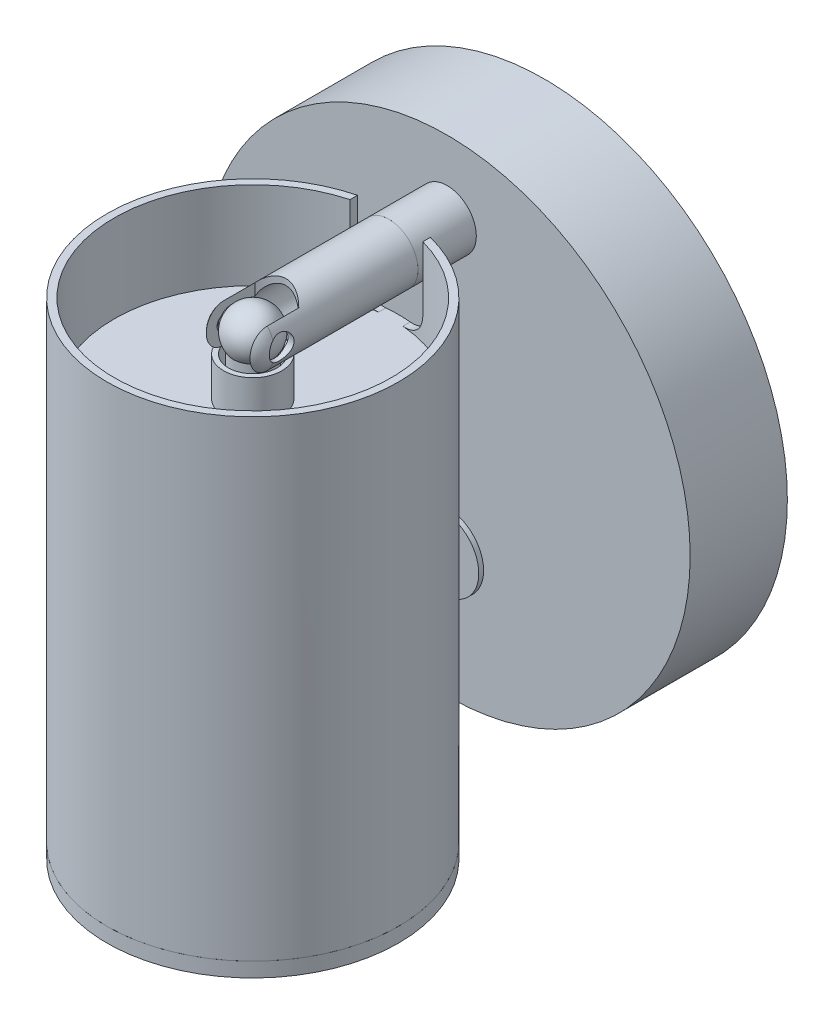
ISO-10303-21;
HEADER;
FILE_DESCRIPTION(('STEP AP214'),'2;1');
FILE_NAME('part.step','',(''),(''),'','','');
FILE_SCHEMA(('AUTOMOTIVE_DESIGN { 1 0 10303 214 1 1 1 1 }'));
ENDSEC;
DATA;
#1=APPLICATION_CONTEXT('core data for automotive mechanical design processes');
#2=APPLICATION_PROTOCOL_DEFINITION('international standard','automotive_design',2000,#1);
#3=PRODUCT_CONTEXT('',#1,'mechanical');
#4=PRODUCT('Part','Part','',(#3));
#5=PRODUCT_RELATED_PRODUCT_CATEGORY('part','',(#4));
#6=PRODUCT_DEFINITION_FORMATION('','',#4);
#7=PRODUCT_DEFINITION_CONTEXT('part definition',#1,'design');
#8=PRODUCT_DEFINITION('design','',#6,#7);
#9=PRODUCT_DEFINITION_SHAPE('','',#8);
#10=(LENGTH_UNIT() NAMED_UNIT(*) SI_UNIT(.MILLI.,.METRE.));
#11=(NAMED_UNIT(*) PLANE_ANGLE_UNIT() SI_UNIT($,.RADIAN.));
#12=(NAMED_UNIT(*) SI_UNIT($,.STERADIAN.) SOLID_ANGLE_UNIT());
#13=UNCERTAINTY_MEASURE_WITH_UNIT(LENGTH_MEASURE(1.E-05),#10,'distance_accuracy_value','');
#14=(GEOMETRIC_REPRESENTATION_CONTEXT(3) GLOBAL_UNCERTAINTY_ASSIGNED_CONTEXT((#13)) GLOBAL_UNIT_ASSIGNED_CONTEXT((#10,
#11,#12)) REPRESENTATION_CONTEXT('',''));
#15=CARTESIAN_POINT('',(0.,0.,0.));
#16=DIRECTION('',(0.,0.,1.));
#17=DIRECTION('',(1.,0.,0.));
#18=AXIS2_PLACEMENT_3D('',#15,#16,#17);
#19=CARTESIAN_POINT('',(0.,-56.,60.));
#20=DIRECTION('',(0.,1.,0.));
#21=DIRECTION('',(0.,0.,1.));
#22=AXIS2_PLACEMENT_3D('',#19,#20,#21);
#23=CYLINDRICAL_SURFACE('',#22,28.5);
#24=CARTESIAN_POINT('',(0.,-56.,60.));
#25=DIRECTION('',(0.,1.,0.));
#26=DIRECTION('',(0.,0.,1.));
#27=AXIS2_PLACEMENT_3D('',#24,#25,#26);
#28=CIRCLE('',#27,28.5);
#29=CARTESIAN_POINT('',(0.,-56.,88.5));
#30=VERTEX_POINT('',#29);
#31=EDGE_CURVE('P0_E174',#30,#30,#28,.T.);
#32=CARTESIAN_POINT('',(0.,20.,60.));
#33=DIRECTION('',(0.,1.,0.));
#34=DIRECTION('',(0.,0.,1.));
#35=AXIS2_PLACEMENT_3D('',#32,#33,#34);
#36=CIRCLE('',#35,28.5);
#37=CARTESIAN_POINT('',(0.,20.,88.5));
#38=VERTEX_POINT('',#37);
#39=EDGE_CURVE('P0_E25',#38,#38,#36,.F.);
#40=CARTESIAN_POINT('',(0.,-56.,88.5));
#41=CARTESIAN_POINT('',(0.,-55.2083333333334,88.5));
#42=CARTESIAN_POINT('',(0.,-54.4166666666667,88.5));
#43=CARTESIAN_POINT('',(0.,-52.8333333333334,88.5));
#44=CARTESIAN_POINT('',(0.,-52.0416666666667,88.5));
#45=CARTESIAN_POINT('',(0.,-50.4583333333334,88.5));
#46=CARTESIAN_POINT('',(0.,-49.6666666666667,88.5));
#47=CARTESIAN_POINT('',(0.,-48.0833333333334,88.5));
#48=CARTESIAN_POINT('',(0.,-47.2916666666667,88.5));
#49=CARTESIAN_POINT('',(0.,-45.7083333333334,88.5));
#50=CARTESIAN_POINT('',(0.,-44.9166666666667,88.5));
#51=CARTESIAN_POINT('',(0.,-43.3333333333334,88.5));
#52=CARTESIAN_POINT('',(0.,-42.5416666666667,88.5));
#53=CARTESIAN_POINT('',(0.,-40.9583333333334,88.5));
#54=CARTESIAN_POINT('',(0.,-40.1666666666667,88.5));
#55=CARTESIAN_POINT('',(0.,-38.5833333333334,88.5));
#56=CARTESIAN_POINT('',(0.,-37.7916666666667,88.5));
#57=CARTESIAN_POINT('',(0.,-36.2083333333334,88.5));
#58=CARTESIAN_POINT('',(0.,-35.4166666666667,88.5));
#59=CARTESIAN_POINT('',(0.,-33.8333333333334,88.5));
#60=CARTESIAN_POINT('',(0.,-33.0416666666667,88.5));
#61=CARTESIAN_POINT('',(0.,-31.4583333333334,88.5));
#62=CARTESIAN_POINT('',(0.,-30.6666666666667,88.5));
#63=CARTESIAN_POINT('',(0.,-29.0833333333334,88.5));
#64=CARTESIAN_POINT('',(0.,-28.2916666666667,88.5));
#65=CARTESIAN_POINT('',(0.,-26.7083333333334,88.5));
#66=CARTESIAN_POINT('',(0.,-25.9166666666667,88.5));
#67=CARTESIAN_POINT('',(0.,-24.3333333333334,88.5));
#68=CARTESIAN_POINT('',(0.,-23.5416666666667,88.5));
#69=CARTESIAN_POINT('',(0.,-21.9583333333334,88.5));
#70=CARTESIAN_POINT('',(0.,-21.1666666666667,88.5));
#71=CARTESIAN_POINT('',(0.,-19.5833333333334,88.5));
#72=CARTESIAN_POINT('',(0.,-18.7916666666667,88.5));
#73=CARTESIAN_POINT('',(0.,-17.2083333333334,88.5));
#74=CARTESIAN_POINT('',(0.,-16.4166666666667,88.5));
#75=CARTESIAN_POINT('',(0.,-14.8333333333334,88.5));
#76=CARTESIAN_POINT('',(0.,-14.0416666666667,88.5));
#77=CARTESIAN_POINT('',(0.,-12.4583333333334,88.5));
#78=CARTESIAN_POINT('',(0.,-11.6666666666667,88.5));
#79=CARTESIAN_POINT('',(0.,-10.0833333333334,88.5));
#80=CARTESIAN_POINT('',(0.,-9.29166666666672,88.5));
#81=CARTESIAN_POINT('',(0.,-7.70833333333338,88.5));
#82=CARTESIAN_POINT('',(0.,-6.91666666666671,88.5));
#83=CARTESIAN_POINT('',(0.,-5.33333333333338,88.5));
#84=CARTESIAN_POINT('',(0.,-4.54166666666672,88.5));
#85=CARTESIAN_POINT('',(0.,-2.95833333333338,88.5));
#86=CARTESIAN_POINT('',(0.,-2.16666666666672,88.5));
#87=CARTESIAN_POINT('',(0.,-0.583333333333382,88.5));
#88=CARTESIAN_POINT('',(0.,0.208333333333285,88.5));
#89=CARTESIAN_POINT('',(0.,1.79166666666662,88.5));
#90=CARTESIAN_POINT('',(0.,2.58333333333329,88.5));
#91=CARTESIAN_POINT('',(0.,4.16666666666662,88.5));
#92=CARTESIAN_POINT('',(0.,4.95833333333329,88.5));
#93=CARTESIAN_POINT('',(0.,6.54166666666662,88.5));
#94=CARTESIAN_POINT('',(0.,7.33333333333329,88.5));
#95=CARTESIAN_POINT('',(0.,8.91666666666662,88.5));
#96=CARTESIAN_POINT('',(0.,9.70833333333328,88.5));
#97=CARTESIAN_POINT('',(0.,11.2916666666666,88.5));
#98=CARTESIAN_POINT('',(0.,12.0833333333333,88.5));
#99=CARTESIAN_POINT('',(0.,13.6666666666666,88.5));
#100=CARTESIAN_POINT('',(0.,14.4583333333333,88.5));
#101=CARTESIAN_POINT('',(0.,16.0416666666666,88.5));
#102=CARTESIAN_POINT('',(0.,16.8333333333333,88.5));
#103=CARTESIAN_POINT('',(0.,18.4166666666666,88.5));
#104=CARTESIAN_POINT('',(0.,19.2083333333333,88.5));
#105=CARTESIAN_POINT('',(0.,20.,88.5));
#106=B_SPLINE_CURVE_WITH_KNOTS('',3,(#40,#41,#42,#43,#44,#45,#46,#47,#48,#49,#50,#51,#52,#53,
#54,#55,#56,#57,#58,#59,#60,#61,#62,#63,#64,#65,#66,#67,#68,#69,#70,#71,#72,#73,#74,#75,#76,#77,
#78,#79,#80,#81,#82,#83,#84,#85,#86,#87,#88,#89,#90,#91,#92,#93,#94,#95,#96,#97,#98,#99,#100,
#101,#102,#103,#104,#105),.UNSPECIFIED.,.F.,.F.,(4,2,2,2,2,2,2,2,2,2,2,2,2,2,2,2,2,2,2,2,2,2,2,
2,2,2,2,2,2,2,2,2,4),(0.,2.375,4.75,7.12500000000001,9.5,11.875,14.25,16.625,19.,21.375,23.75,
26.125,28.5,30.875,33.25,35.625,38.,40.375,42.75,45.125,47.5,49.875,52.25,54.625,57.,59.375,
61.75,64.125,66.5,68.875,71.25,73.625,76.),.UNSPECIFIED.);
#107=EDGE_CURVE('P0_BSEAM16',#30,#38,#106,.T.);
#108=ORIENTED_EDGE('',*,*,#31,.F.);
#109=ORIENTED_EDGE('',*,*,#39,.F.);
#110=ORIENTED_EDGE('',*,*,#107,.T.);
#111=ORIENTED_EDGE('',*,*,#107,.F.);
#112=EDGE_LOOP('',(#108,#110,#109,#111));
#113=FACE_BOUND('',#112,.T.);
#114=ADVANCED_FACE('P0_F16',(#113),#23,.F.);
#115=CARTESIAN_POINT('',(7.5,28.,20.));
#116=DIRECTION('',(1.,0.,0.));
#117=DIRECTION('',(0.,1.,0.));
#118=AXIS2_PLACEMENT_3D('',#115,#116,#117);
#119=PLANE('',#118);
#120=DIRECTION('',(0.,1.,0.));
#121=VECTOR('',#120,1.);
#122=CARTESIAN_POINT('',(7.50000000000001,-56.,32.504545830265));
#123=LINE('',#122,#121);
#124=CARTESIAN_POINT('',(7.5,41.,32.504545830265));
#125=VERTEX_POINT('',#124);
#126=CARTESIAN_POINT('',(7.5,28.,32.504545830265));
#127=VERTEX_POINT('',#126);
#128=EDGE_CURVE('P0_E113',#125,#127,#123,.F.);
#129=ORIENTED_EDGE('',*,*,#128,.F.);
#130=DIRECTION('',(0.,0.,-1.));
#131=VECTOR('',#130,1.);
#132=CARTESIAN_POINT('',(7.5,41.,60.));
#133=LINE('',#132,#131);
#134=CARTESIAN_POINT('',(7.5,41.,30.9526249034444));
#135=VERTEX_POINT('',#134);
#136=EDGE_CURVE('P0_E115',#125,#135,#133,.T.);
#137=ORIENTED_EDGE('',*,*,#136,.T.);
#138=DIRECTION('',(0.,1.,0.));
#139=VECTOR('',#138,1.);
#140=CARTESIAN_POINT('',(7.50000000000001,-56.,30.9526249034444));
#141=LINE('',#140,#139);
#142=CARTESIAN_POINT('',(7.5,28.,30.9526249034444));
#143=VERTEX_POINT('',#142);
#144=EDGE_CURVE('P0_E117',#135,#143,#141,.F.);
#145=ORIENTED_EDGE('',*,*,#144,.T.);
#146=DIRECTION('',(0.,0.,1.));
#147=VECTOR('',#146,1.);
#148=CARTESIAN_POINT('',(7.5,28.,20.));
#149=LINE('',#148,#147);
#150=EDGE_CURVE('P0_E101',#143,#127,#149,.T.);
#151=ORIENTED_EDGE('',*,*,#150,.T.);
#152=EDGE_LOOP('',(#129,#137,#145,#151));
#153=FACE_BOUND('',#152,.T.);
#154=ADVANCED_FACE('P0_F154',(#153),#119,.F.);
#155=CARTESIAN_POINT('',(-7.5,28.,20.));
#156=DIRECTION('',(-1.,0.,0.));
#157=DIRECTION('',(0.,-1.,0.));
#158=AXIS2_PLACEMENT_3D('',#155,#156,#157);
#159=PLANE('',#158);
#160=DIRECTION('',(0.,0.,1.));
#161=VECTOR('',#160,1.);
#162=CARTESIAN_POINT('',(-7.5,41.,60.));
#163=LINE('',#162,#161);
#164=CARTESIAN_POINT('',(-7.5,41.,30.9526249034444));
#165=VERTEX_POINT('',#164);
#166=CARTESIAN_POINT('',(-7.5,41.,32.504545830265));
#167=VERTEX_POINT('',#166);
#168=EDGE_CURVE('P0_E108',#165,#167,#163,.T.);
#169=ORIENTED_EDGE('',*,*,#168,.T.);
#170=DIRECTION('',(0.,1.,0.));
#171=VECTOR('',#170,1.);
#172=CARTESIAN_POINT('',(-7.49999999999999,-56.,32.504545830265));
#173=LINE('',#172,#171);
#174=CARTESIAN_POINT('',(-7.5,28.,32.504545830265));
#175=VERTEX_POINT('',#174);
#176=EDGE_CURVE('P0_E104',#175,#167,#173,.T.);
#177=ORIENTED_EDGE('',*,*,#176,.F.);
#178=DIRECTION('',(0.,0.,1.));
#179=VECTOR('',#178,1.);
#180=CARTESIAN_POINT('',(-7.5,28.,20.));
#181=LINE('',#180,#179);
#182=CARTESIAN_POINT('',(-7.5,28.,30.9526249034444));
#183=VERTEX_POINT('',#182);
#184=EDGE_CURVE('P0_E78',#183,#175,#181,.T.);
#185=ORIENTED_EDGE('',*,*,#184,.F.);
#186=DIRECTION('',(0.,1.,0.));
#187=VECTOR('',#186,1.);
#188=CARTESIAN_POINT('',(-7.49999999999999,-56.,30.9526249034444));
#189=LINE('',#188,#187);
#190=EDGE_CURVE('P0_E111',#183,#165,#189,.T.);
#191=ORIENTED_EDGE('',*,*,#190,.T.);
#192=EDGE_LOOP('',(#169,#177,#185,#191));
#193=FACE_BOUND('',#192,.T.);
#194=ADVANCED_FACE('P0_F133',(#193),#159,.F.);
#195=CARTESIAN_POINT('',(0.,-56.,60.));
#196=DIRECTION('',(0.,1.,0.));
#197=DIRECTION('',(0.,0.,1.));
#198=AXIS2_PLACEMENT_3D('',#195,#196,#197);
#199=CYLINDRICAL_SURFACE('',#198,30.);
#200=ORIENTED_EDGE('',*,*,#144,.F.);
#201=CARTESIAN_POINT('',(0.,41.,60.));
#202=DIRECTION('',(0.,1.,0.));
#203=DIRECTION('',(0.,0.,1.));
#204=AXIS2_PLACEMENT_3D('',#201,#202,#203);
#205=CIRCLE('',#204,30.);
#206=EDGE_CURVE('P0_E143',#165,#135,#205,.T.);
#207=ORIENTED_EDGE('',*,*,#206,.F.);
#208=ORIENTED_EDGE('',*,*,#190,.F.);
#209=CARTESIAN_POINT('',(-2.49999999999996,23.,30.1043481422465));
#210=CARTESIAN_POINT('',(-2.64118808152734,22.9999842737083,30.1161447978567));
#211=CARTESIAN_POINT('',(-2.78228362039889,23.005979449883,30.128960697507));
#212=CARTESIAN_POINT('',(-3.06326341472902,23.0298321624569,30.1564717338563));
#213=CARTESIAN_POINT('',(-3.20314784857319,23.0476879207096,30.1711665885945));
#214=CARTESIAN_POINT('',(-3.48052278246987,23.0950683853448,30.2022575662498));
#215=CARTESIAN_POINT('',(-3.61801643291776,23.1245762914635,30.2186512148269));
#216=CARTESIAN_POINT('',(-3.88985915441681,23.1950022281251,30.2529370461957));
#217=CARTESIAN_POINT('',(-4.02420817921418,23.2359204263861,30.2708292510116));
#218=CARTESIAN_POINT('',(-4.28881186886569,23.3288319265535,30.3078471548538));
#219=CARTESIAN_POINT('',(-4.41906737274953,23.3808229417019,30.3269725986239));
#220=CARTESIAN_POINT('',(-4.67468416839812,23.4955156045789,30.3661670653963));
#221=CARTESIAN_POINT('',(-4.80004363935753,23.5582211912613,30.3862364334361));
#222=CARTESIAN_POINT('',(-5.0449560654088,23.6938660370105,30.4269746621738));
#223=CARTESIAN_POINT('',(-5.16451035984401,23.7668029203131,30.4476433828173));
#224=CARTESIAN_POINT('',(-5.39709431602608,23.9224478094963,30.4892335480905));
#225=CARTESIAN_POINT('',(-5.51012167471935,24.0051592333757,30.5101550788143));
#226=CARTESIAN_POINT('',(-5.73019776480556,24.1808522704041,30.552121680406));
#227=CARTESIAN_POINT('',(-5.83715634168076,24.2739472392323,30.5731651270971));
#228=CARTESIAN_POINT('',(-6.0428372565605,24.468939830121,30.6147123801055));
#229=CARTESIAN_POINT('',(-6.14155961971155,24.5708374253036,30.6352161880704));
#230=CARTESIAN_POINT('',(-6.33010732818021,24.7827956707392,30.6752828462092));
#231=CARTESIAN_POINT('',(-6.4199295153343,24.8928591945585,30.6948453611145));
#232=CARTESIAN_POINT('',(-6.5899523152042,25.1203392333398,30.732610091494));
#233=CARTESIAN_POINT('',(-6.6701564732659,25.237753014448,30.7508128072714));
#234=CARTESIAN_POINT('',(-6.8202704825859,25.4790045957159,30.7854515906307));
#235=CARTESIAN_POINT('',(-6.89019461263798,25.6028331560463,30.8018900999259));
#236=CARTESIAN_POINT('',(-7.01930706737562,25.8561559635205,30.8326598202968));
#237=CARTESIAN_POINT('',(-7.07849962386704,25.985647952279,30.8469918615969));
#238=CARTESIAN_POINT('',(-7.18566790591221,26.249355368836,30.8732215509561));
#239=CARTESIAN_POINT('',(-7.23364979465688,26.3835681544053,30.8851205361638));
#240=CARTESIAN_POINT('',(-7.31801473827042,26.6557385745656,30.9062112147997));
#241=CARTESIAN_POINT('',(-7.35440113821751,26.7936951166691,30.9154036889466));
#242=CARTESIAN_POINT('',(-7.42305574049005,27.1080555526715,30.9328392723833));
#243=CARTESIAN_POINT('',(-7.45189602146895,27.2852763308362,30.9402396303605));
#244=CARTESIAN_POINT('',(-7.48074845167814,27.552577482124,30.9476595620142));
#245=CARTESIAN_POINT('',(-7.48796458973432,27.6418941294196,30.949519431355));
#246=CARTESIAN_POINT('',(-7.49759009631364,27.8207999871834,30.9520025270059));
#247=CARTESIAN_POINT('',(-7.49999963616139,27.9103891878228,30.9526257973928));
#248=CARTESIAN_POINT('',(-7.5,28.,30.9526249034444));
#249=B_SPLINE_CURVE_WITH_KNOTS('',3,(#209,#210,#211,#212,#213,#214,#215,#216,#217,#218,#219,
#220,#221,#222,#223,#224,#225,#226,#227,#228,#229,#230,#231,#232,#233,#234,#235,#236,#237,#238,
#239,#240,#241,#242,#243,#244,#245,#246,#247,#248),.UNSPECIFIED.,.F.,.F.,(4,2,2,2,2,2,2,2,2,2,2,
2,2,2,2,2,2,2,2,4),(0.,0.42489903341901,0.849734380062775,1.27395941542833,1.69819068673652,
2.1223344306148,2.54663443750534,2.97083608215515,3.39518650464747,3.82473304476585,
4.25427827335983,4.6839753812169,5.11351360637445,5.54244945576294,5.97121579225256,
6.39974585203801,6.82815217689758,7.36602402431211,7.63478848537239,7.90354336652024),.UNSPECIFIED.);
#250=CARTESIAN_POINT('',(-2.49999999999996,23.,30.1043481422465));
#251=VERTEX_POINT('',#250);
#252=EDGE_CURVE('P0_E119',#251,#183,#249,.T.);
#253=ORIENTED_EDGE('',*,*,#252,.F.);
#254=CARTESIAN_POINT('',(0.,23.,60.));
#255=DIRECTION('',(0.,-1.,0.));
#256=DIRECTION('',(0.,0.,-1.));
#257=AXIS2_PLACEMENT_3D('',#254,#255,#256);
#258=CIRCLE('',#257,30.);
#259=CARTESIAN_POINT('',(2.49999999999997,23.,30.1043481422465));
#260=VERTEX_POINT('',#259);
#261=EDGE_CURVE('P0_E75',#260,#251,#258,.F.);
#262=ORIENTED_EDGE('',*,*,#261,.F.);
#263=CARTESIAN_POINT('',(7.5,28.,30.9526249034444));
#264=CARTESIAN_POINT('',(7.50001747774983,27.8619962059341,30.9526369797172));
#265=CARTESIAN_POINT('',(7.49428725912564,27.7239973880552,30.9511501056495));
#266=CARTESIAN_POINT('',(7.47145953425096,27.4490256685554,30.945266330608));
#267=CARTESIAN_POINT('',(7.45436373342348,27.3120526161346,30.9408698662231));
#268=CARTESIAN_POINT('',(7.40897661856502,27.0403682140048,30.9292659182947));
#269=CARTESIAN_POINT('',(7.38070692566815,26.9056530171,30.9220638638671));
#270=CARTESIAN_POINT('',(7.31321338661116,26.6391669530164,30.905015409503));
#271=CARTESIAN_POINT('',(7.2739894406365,26.5073961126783,30.8951689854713));
#272=CARTESIAN_POINT('',(7.18491444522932,26.2477406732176,30.873051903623));
#273=CARTESIAN_POINT('',(7.13506570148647,26.1198552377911,30.860781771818));
#274=CARTESIAN_POINT('',(7.02510637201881,25.8687550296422,30.8340767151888));
#275=CARTESIAN_POINT('',(6.96499198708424,25.7455420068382,30.8196409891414));
#276=CARTESIAN_POINT('',(6.83497776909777,25.5046651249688,30.7889141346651));
#277=CARTESIAN_POINT('',(6.76507968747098,25.3870002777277,30.7726233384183));
#278=CARTESIAN_POINT('',(6.61596629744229,25.1579041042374,30.738509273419));
#279=CARTESIAN_POINT('',(6.53674749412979,25.046475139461,30.7206854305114));
#280=CARTESIAN_POINT('',(6.36806622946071,24.8286635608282,30.683531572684));
#281=CARTESIAN_POINT('',(6.27844596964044,24.7224067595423,30.6641803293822));
#282=CARTESIAN_POINT('',(6.09072749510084,24.5177646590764,30.6246320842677));
#283=CARTESIAN_POINT('',(5.99262613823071,24.4193823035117,30.6044347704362));
#284=CARTESIAN_POINT('',(5.78864403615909,24.2311704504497,30.5635869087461));
#285=CARTESIAN_POINT('',(5.68276413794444,24.1413400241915,30.5429364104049));
#286=CARTESIAN_POINT('',(5.46387421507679,23.9707681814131,30.5015510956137));
#287=CARTESIAN_POINT('',(5.35086163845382,23.8900300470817,30.4808162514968));
#288=CARTESIAN_POINT('',(5.11591324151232,23.7365368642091,30.4391818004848));
#289=CARTESIAN_POINT('',(4.99383569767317,23.6639968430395,30.4182886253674));
#290=CARTESIAN_POINT('',(4.74386727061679,23.5295185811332,30.3771748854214));
#291=CARTESIAN_POINT('',(4.61597635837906,23.4675803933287,30.3569543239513));
#292=CARTESIAN_POINT('',(4.35531801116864,23.3547934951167,30.3175378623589));
#293=CARTESIAN_POINT('',(4.22255326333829,23.3039387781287,30.2983414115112));
#294=CARTESIAN_POINT('',(3.95306078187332,23.2136841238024,30.2612738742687));
#295=CARTESIAN_POINT('',(3.81633386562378,23.1742818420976,30.2434025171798));
#296=CARTESIAN_POINT('',(3.48570631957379,23.0941370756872,30.2025622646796));
#297=CARTESIAN_POINT('',(3.29033793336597,23.0588850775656,30.1803296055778));
#298=CARTESIAN_POINT('',(2.9951160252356,23.0235854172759,30.1497217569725));
#299=CARTESIAN_POINT('',(2.89636719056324,23.0147485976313,30.1399776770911));
#300=CARTESIAN_POINT('',(2.69843602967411,23.0029566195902,30.121440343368));
#301=CARTESIAN_POINT('',(2.59925372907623,23.0000011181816,30.1126470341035));
#302=CARTESIAN_POINT('',(2.49999999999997,23.,30.1043481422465));
#303=B_SPLINE_CURVE_WITH_KNOTS('',3,(#263,#264,#265,#266,#267,#268,#269,#270,#271,#272,#273,
#274,#275,#276,#277,#278,#279,#280,#281,#282,#283,#284,#285,#286,#287,#288,#289,#290,#291,#292,
#293,#294,#295,#296,#297,#298,#299,#300,#301,#302),.UNSPECIFIED.,.F.,.F.,(4,2,2,2,2,2,2,2,2,2,2,
2,2,2,2,2,2,2,2,4),(0.,0.413876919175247,0.827691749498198,1.24070975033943,1.65373151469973,
2.06666374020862,2.47974912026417,2.89276064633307,3.30592753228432,3.72648003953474,
4.14718902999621,4.56785227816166,4.98866689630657,5.41875118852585,5.8488376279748,
6.27869040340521,6.70845512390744,7.30612138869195,7.6048347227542,7.90353063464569),.UNSPECIFIED.);
#304=EDGE_CURVE('P0_E37',#143,#260,#303,.T.);
#305=ORIENTED_EDGE('',*,*,#304,.F.);
#306=EDGE_LOOP('',(#200,#207,#208,#253,#262,#305));
#307=FACE_BOUND('',#306,.T.);
#308=CARTESIAN_POINT('',(0.,-56.,60.));
#309=DIRECTION('',(0.,1.,0.));
#310=DIRECTION('',(0.,0.,1.));
#311=AXIS2_PLACEMENT_3D('',#308,#309,#310);
#312=CIRCLE('',#311,30.);
#313=CARTESIAN_POINT('',(0.,-56.,90.));
#314=VERTEX_POINT('',#313);
#315=EDGE_CURVE('P0_E87',#314,#314,#312,.T.);
#316=ORIENTED_EDGE('',*,*,#315,.T.);
#317=EDGE_LOOP('',(#316));
#318=FACE_BOUND('',#317,.T.);
#319=ADVANCED_FACE('P0_F18',(#307,#318),#199,.T.);
#320=CARTESIAN_POINT('',(0.,-56.,60.));
#321=DIRECTION('',(0.,1.,0.));
#322=DIRECTION('',(0.,0.,1.));
#323=AXIS2_PLACEMENT_3D('',#320,#321,#322);
#324=PLANE('',#323);
#325=ORIENTED_EDGE('',*,*,#31,.T.);
#326=EDGE_LOOP('',(#325));
#327=FACE_BOUND('',#326,.T.);
#328=ORIENTED_EDGE('',*,*,#315,.F.);
#329=EDGE_LOOP('',(#328));
#330=FACE_BOUND('',#329,.T.);
#331=ADVANCED_FACE('P0_F155',(#327,#330),#324,.F.);
#332=CARTESIAN_POINT('',(0.,41.,60.));
#333=DIRECTION('',(0.,1.,0.));
#334=DIRECTION('',(0.,0.,1.));
#335=AXIS2_PLACEMENT_3D('',#332,#333,#334);
#336=PLANE('',#335);
#337=ORIENTED_EDGE('',*,*,#136,.F.);
#338=CARTESIAN_POINT('',(0.,41.,60.));
#339=DIRECTION('',(0.,1.,0.));
#340=DIRECTION('',(0.,0.,1.));
#341=AXIS2_PLACEMENT_3D('',#338,#339,#340);
#342=CIRCLE('',#341,28.5);
#343=EDGE_CURVE('P0_E91',#125,#167,#342,.F.);
#344=ORIENTED_EDGE('',*,*,#343,.T.);
#345=ORIENTED_EDGE('',*,*,#168,.F.);
#346=ORIENTED_EDGE('',*,*,#206,.T.);
#347=EDGE_LOOP('',(#337,#344,#345,#346));
#348=FACE_BOUND('',#347,.T.);
#349=ADVANCED_FACE('P0_F153',(#348),#336,.T.);
#350=CARTESIAN_POINT('',(7.5,28.,32.504545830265));
#351=CARTESIAN_POINT('',(7.50001772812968,27.8622832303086,32.5045586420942));
#352=CARTESIAN_POINT('',(7.49431101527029,27.7245717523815,32.5029942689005));
#353=CARTESIAN_POINT('',(7.47157882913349,27.4501769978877,32.4968044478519));
#354=CARTESIAN_POINT('',(7.45455518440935,27.3134935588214,32.4921794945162));
#355=CARTESIAN_POINT('',(7.40936555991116,27.0424056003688,32.4799742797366));
#356=CARTESIAN_POINT('',(7.38122250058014,26.9079969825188,32.472400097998));
#357=CARTESIAN_POINT('',(7.3140382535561,26.6421216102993,32.4544729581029));
#358=CARTESIAN_POINT('',(7.27499694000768,26.5106548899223,32.4441199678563));
#359=CARTESIAN_POINT('',(7.18634865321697,26.2516083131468,32.4208686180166));
#360=CARTESIAN_POINT('',(7.13674458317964,26.1240273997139,32.407970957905));
#361=CARTESIAN_POINT('',(7.02733682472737,25.873521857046,32.3799035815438));
#362=CARTESIAN_POINT('',(6.96752935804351,25.7505989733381,32.3647330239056));
#363=CARTESIAN_POINT('',(6.83818887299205,25.5102738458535,32.3324447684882));
#364=CARTESIAN_POINT('',(6.76865722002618,25.3928708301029,32.3153273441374));
#365=CARTESIAN_POINT('',(6.6203368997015,25.1642643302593,32.2794848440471));
#366=CARTESIAN_POINT('',(6.54154475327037,25.0530631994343,32.2607591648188));
#367=CARTESIAN_POINT('',(6.37361494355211,24.8354513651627,32.2216881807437));
#368=CARTESIAN_POINT('',(6.28430291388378,24.7291796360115,32.2013180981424));
#369=CARTESIAN_POINT('',(6.09722205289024,24.524481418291,32.1596862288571));
#370=CARTESIAN_POINT('',(5.99945008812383,24.426057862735,32.1384241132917));
#371=CARTESIAN_POINT('',(5.79612964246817,24.2377240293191,32.0954185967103));
#372=CARTESIAN_POINT('',(5.69058195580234,24.1478128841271,32.0736752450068));
#373=CARTESIAN_POINT('',(5.47239367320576,23.9770533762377,32.0300997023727));
#374=CARTESIAN_POINT('',(5.35975053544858,23.8962082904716,32.0082674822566));
#375=CARTESIAN_POINT('',(5.0066101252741,23.6644128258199,31.9421689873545));
#376=CARTESIAN_POINT('',(4.75575426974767,23.5287076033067,31.8983521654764));
#377=CARTESIAN_POINT('',(4.23424612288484,23.3017833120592,31.8150606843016));
#378=CARTESIAN_POINT('',(3.9636071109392,23.2105347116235,31.7755831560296));
#379=CARTESIAN_POINT('',(3.49316314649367,23.095572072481,31.7142090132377));
#380=CARTESIAN_POINT('',(3.29645487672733,23.0598115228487,31.6905903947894));
#381=CARTESIAN_POINT('',(2.89992778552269,23.0120129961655,31.6472102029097));
#382=CARTESIAN_POINT('',(2.70011162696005,22.9999557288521,31.6274455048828));
#383=CARTESIAN_POINT('',(2.49999999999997,23.,31.6098608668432));
#384=B_SPLINE_CURVE_WITH_KNOTS('',3,(#350,#351,#352,#353,#354,#355,#356,#357,#358,#359,#360,
#361,#362,#363,#364,#365,#366,#367,#368,#369,#370,#371,#372,#373,#374,#375,#376,#377,#378,#379,
#380,#381,#382,#383),.UNSPECIFIED.,.F.,.F.,(4,2,2,2,2,2,2,2,2,2,2,2,2,2,2,2,4),(0.,
0.413015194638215,0.825963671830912,1.23806534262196,1.65017177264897,2.06216507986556,
2.47431127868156,2.88639966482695,3.29864336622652,3.71907317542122,4.1396593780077,
4.56020268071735,4.98089750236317,5.84215431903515,6.70283823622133,7.30541676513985,
7.90750469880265),.UNSPECIFIED.);
#385=CARTESIAN_POINT('',(2.49999999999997,23.,31.6098608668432));
#386=VERTEX_POINT('',#385);
#387=EDGE_CURVE('P0_E86',#127,#386,#384,.T.);
#388=ORIENTED_EDGE('',*,*,#387,.T.);
#389=CARTESIAN_POINT('',(0.,23.,60.));
#390=DIRECTION('',(0.,1.,0.));
#391=DIRECTION('',(0.,0.,1.));
#392=AXIS2_PLACEMENT_3D('',#389,#390,#391);
#393=CIRCLE('',#392,28.5);
#394=CARTESIAN_POINT('',(-2.5,23.,31.6098608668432));
#395=VERTEX_POINT('',#394);
#396=EDGE_CURVE('P0_E73',#395,#386,#393,.T.);
#397=ORIENTED_EDGE('',*,*,#396,.F.);
#398=CARTESIAN_POINT('',(-2.49999999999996,23.,31.6098608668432));
#399=CARTESIAN_POINT('',(-2.6412452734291,22.999984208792,31.6222881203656));
#400=CARTESIAN_POINT('',(-2.78238808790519,23.0059842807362,31.6357894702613));
#401=CARTESIAN_POINT('',(-3.0634400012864,23.0298511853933,31.6647723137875));
#402=CARTESIAN_POINT('',(-3.20334929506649,23.0477161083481,31.680253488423));
#403=CARTESIAN_POINT('',(-3.48074168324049,23.0951120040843,31.7130072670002));
#404=CARTESIAN_POINT('',(-3.61822812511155,23.124625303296,31.7302771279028));
#405=CARTESIAN_POINT('',(-3.89003737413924,23.1950542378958,31.7663959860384));
#406=CARTESIAN_POINT('',(-4.02436012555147,23.2359700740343,31.7852450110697));
#407=CARTESIAN_POINT('',(-4.28888845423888,23.3288625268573,31.8242425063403));
#408=CARTESIAN_POINT('',(-4.41909509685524,23.38083625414,31.8443906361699));
#409=CARTESIAN_POINT('',(-4.67460473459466,23.4954790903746,31.8856829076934));
#410=CARTESIAN_POINT('',(-4.79990590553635,23.5581521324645,31.9068274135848));
#411=CARTESIAN_POINT('',(-5.04470307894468,23.6937187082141,31.949752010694));
#412=CARTESIAN_POINT('',(-5.16420023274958,23.7666102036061,31.9715319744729));
#413=CARTESIAN_POINT('',(-5.39667378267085,23.9221516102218,32.0153629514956));
#414=CARTESIAN_POINT('',(-5.50964787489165,24.0048049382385,32.0374140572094));
#415=CARTESIAN_POINT('',(-5.72977937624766,24.1804940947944,32.0816833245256));
#416=CARTESIAN_POINT('',(-5.83683646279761,24.27365613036,32.1038996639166));
#417=CARTESIAN_POINT('',(-6.04270659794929,24.4688038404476,32.1477689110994));
#418=CARTESIAN_POINT('',(-6.14151967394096,24.5707894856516,32.169421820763));
#419=CARTESIAN_POINT('',(-6.33024162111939,24.7829496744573,32.2117399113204));
#420=CARTESIAN_POINT('',(-6.42014732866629,24.8931271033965,32.2324047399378));
#421=CARTESIAN_POINT('',(-6.5903277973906,25.1208651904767,32.2723023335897));
#422=CARTESIAN_POINT('',(-6.67060613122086,25.2384230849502,32.291535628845));
#423=CARTESIAN_POINT('',(-6.8208456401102,25.4799818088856,32.3281363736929));
#424=CARTESIAN_POINT('',(-6.89082238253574,25.6039725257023,32.3455066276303));
#425=CARTESIAN_POINT('',(-7.02002276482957,25.857653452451,32.378021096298));
#426=CARTESIAN_POINT('',(-7.07925068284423,25.9873413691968,32.3931661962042));
#427=CARTESIAN_POINT('',(-7.18646321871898,26.2514692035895,32.4208808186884));
#428=CARTESIAN_POINT('',(-7.23445437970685,26.3859063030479,32.4334518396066));
#429=CARTESIAN_POINT('',(-7.31880557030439,26.6585524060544,32.4557268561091));
#430=CARTESIAN_POINT('',(-7.35516902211,26.7967602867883,32.4654316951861));
#431=CARTESIAN_POINT('',(-7.42353645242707,27.1108313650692,32.4837741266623));
#432=CARTESIAN_POINT('',(-7.45219509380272,27.2874944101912,32.491542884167));
#433=CARTESIAN_POINT('',(-7.48086739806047,27.5539599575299,32.4993326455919));
#434=CARTESIAN_POINT('',(-7.48803888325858,27.6430002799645,32.5012853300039));
#435=CARTESIAN_POINT('',(-7.49760495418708,27.8213532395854,32.5038923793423));
#436=CARTESIAN_POINT('',(-7.49999969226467,27.9106658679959,32.5045467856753));
#437=CARTESIAN_POINT('',(-7.5,28.,32.504545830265));
#438=B_SPLINE_CURVE_WITH_KNOTS('',3,(#398,#399,#400,#401,#402,#403,#404,#405,#406,#407,#408,
#409,#410,#411,#412,#413,#414,#415,#416,#417,#418,#419,#420,#421,#422,#423,#424,#425,#426,#427,
#428,#429,#430,#431,#432,#433,#434,#435,#436,#437),.UNSPECIFIED.,.F.,.F.,(4,2,2,2,2,2,2,2,2,2,2,
2,2,2,2,2,2,2,2,4),(0.,0.425230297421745,0.850392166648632,1.27491142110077,1.69943815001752,
2.12385408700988,2.548426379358,2.97291410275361,3.39755084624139,3.8279779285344,
4.25840358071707,4.68898156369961,5.11939926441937,5.5491597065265,5.97874872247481,
6.40808696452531,6.83729872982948,7.37348462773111,7.64141831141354,7.90934344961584),.UNSPECIFIED.);
#439=EDGE_CURVE('P0_E82',#395,#175,#438,.T.);
#440=ORIENTED_EDGE('',*,*,#439,.T.);
#441=ORIENTED_EDGE('',*,*,#176,.T.);
#442=ORIENTED_EDGE('',*,*,#343,.F.);
#443=ORIENTED_EDGE('',*,*,#128,.T.);
#444=EDGE_LOOP('',(#388,#397,#440,#441,#442,#443));
#445=FACE_BOUND('',#444,.T.);
#446=ADVANCED_FACE('P0_F89',(#445),#23,.F.);
#447=CARTESIAN_POINT('',(2.5,28.,20.));
#448=DIRECTION('',(0.,0.,1.));
#449=DIRECTION('',(1.,0.,0.));
#450=AXIS2_PLACEMENT_3D('',#447,#448,#449);
#451=CYLINDRICAL_SURFACE('',#450,5.);
#452=ORIENTED_EDGE('',*,*,#304,.T.);
#453=DIRECTION('',(0.,0.,1.));
#454=VECTOR('',#453,1.);
#455=CARTESIAN_POINT('',(2.49999999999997,23.,20.));
#456=LINE('',#455,#454);
#457=EDGE_CURVE('P0_E32',#260,#386,#456,.T.);
#458=ORIENTED_EDGE('',*,*,#457,.T.);
#459=ORIENTED_EDGE('',*,*,#387,.F.);
#460=ORIENTED_EDGE('',*,*,#150,.F.);
#461=EDGE_LOOP('',(#452,#458,#459,#460));
#462=FACE_BOUND('',#461,.T.);
#463=ADVANCED_FACE('P0_F152',(#462),#451,.F.);
#464=CARTESIAN_POINT('',(-2.49999999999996,23.,20.));
#465=DIRECTION('',(0.,-1.,0.));
#466=DIRECTION('',(0.,0.,-1.));
#467=AXIS2_PLACEMENT_3D('',#464,#465,#466);
#468=PLANE('',#467);
#469=CARTESIAN_POINT('',(0.,23.,60.));
#470=DIRECTION('',(0.,-1.,0.));
#471=DIRECTION('',(0.,0.,-1.));
#472=AXIS2_PLACEMENT_3D('',#469,#470,#471);
#473=CIRCLE('',#472,6.);
#474=CARTESIAN_POINT('',(0.,23.,54.));
#475=VERTEX_POINT('',#474);
#476=EDGE_CURVE('P0_E10',#475,#475,#473,.F.);
#477=ORIENTED_EDGE('',*,*,#476,.F.);
#478=EDGE_LOOP('',(#477));
#479=FACE_BOUND('',#478,.T.);
#480=ORIENTED_EDGE('',*,*,#261,.T.);
#481=DIRECTION('',(0.,0.,1.));
#482=VECTOR('',#481,1.);
#483=CARTESIAN_POINT('',(-2.49999999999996,23.,20.));
#484=LINE('',#483,#482);
#485=EDGE_CURVE('P0_E69',#251,#395,#484,.T.);
#486=ORIENTED_EDGE('',*,*,#485,.T.);
#487=ORIENTED_EDGE('',*,*,#396,.T.);
#488=ORIENTED_EDGE('',*,*,#457,.F.);
#489=EDGE_LOOP('',(#480,#486,#487,#488));
#490=FACE_BOUND('',#489,.T.);
#491=ADVANCED_FACE('P0_F71',(#479,#490),#468,.F.);
#492=CARTESIAN_POINT('',(-2.5,28.,20.));
#493=DIRECTION('',(0.,0.,1.));
#494=DIRECTION('',(1.,0.,0.));
#495=AXIS2_PLACEMENT_3D('',#492,#493,#494);
#496=CYLINDRICAL_SURFACE('',#495,5.);
#497=ORIENTED_EDGE('',*,*,#252,.T.);
#498=ORIENTED_EDGE('',*,*,#184,.T.);
#499=ORIENTED_EDGE('',*,*,#439,.F.);
#500=ORIENTED_EDGE('',*,*,#485,.F.);
#501=EDGE_LOOP('',(#497,#498,#499,#500));
#502=FACE_BOUND('',#501,.T.);
#503=ADVANCED_FACE('P0_F83',(#502),#496,.F.);
#504=CARTESIAN_POINT('',(0.,20.,60.));
#505=DIRECTION('',(0.,1.,0.));
#506=DIRECTION('',(0.,0.,1.));
#507=AXIS2_PLACEMENT_3D('',#504,#505,#506);
#508=PLANE('',#507);
#509=ORIENTED_EDGE('',*,*,#39,.T.);
#510=EDGE_LOOP('',(#509));
#511=FACE_BOUND('',#510,.T.);
#512=ADVANCED_FACE('P0_F131',(#511),#508,.F.);
#513=CARTESIAN_POINT('',(0.,31.,60.));
#514=DIRECTION('',(0.,1.,0.));
#515=DIRECTION('',(0.,0.,1.));
#516=AXIS2_PLACEMENT_3D('',#513,#514,#515);
#517=PLANE('',#516);
#518=CARTESIAN_POINT('',(0.,31.,60.));
#519=DIRECTION('',(0.,1.,0.));
#520=DIRECTION('',(0.,0.,1.));
#521=AXIS2_PLACEMENT_3D('',#518,#519,#520);
#522=CIRCLE('',#521,6.);
#523=CARTESIAN_POINT('',(0.,31.,66.));
#524=VERTEX_POINT('',#523);
#525=EDGE_CURVE('P0_E92',#524,#524,#522,.T.);
#526=ORIENTED_EDGE('',*,*,#525,.T.);
#527=EDGE_LOOP('',(#526));
#528=FACE_BOUND('',#527,.T.);
#529=CARTESIAN_POINT('',(0.,31.,60.));
#530=DIRECTION('',(0.,1.,0.));
#531=DIRECTION('',(0.,0.,1.));
#532=AXIS2_PLACEMENT_3D('',#529,#530,#531);
#533=CIRCLE('',#532,5.);
#534=CARTESIAN_POINT('',(0.,31.,65.));
#535=VERTEX_POINT('',#534);
#536=EDGE_CURVE('P0_E97',#535,#535,#533,.T.);
#537=ORIENTED_EDGE('',*,*,#536,.F.);
#538=EDGE_LOOP('',(#537));
#539=FACE_BOUND('',#538,.T.);
#540=ADVANCED_FACE('P0_F179',(#528,#539),#517,.T.);
#541=CARTESIAN_POINT('',(0.,31.,60.));
#542=DIRECTION('',(0.,-1.,0.));
#543=DIRECTION('',(0.,0.,-1.));
#544=AXIS2_PLACEMENT_3D('',#541,#542,#543);
#545=CYLINDRICAL_SURFACE('',#544,6.);
#546=ORIENTED_EDGE('',*,*,#525,.F.);
#547=EDGE_LOOP('',(#546));
#548=FACE_BOUND('',#547,.T.);
#549=ORIENTED_EDGE('',*,*,#476,.T.);
#550=EDGE_LOOP('',(#549));
#551=FACE_BOUND('',#550,.T.);
#552=ADVANCED_FACE('P0_F184',(#548,#551),#545,.T.);
#553=CARTESIAN_POINT('',(0.,31.,60.));
#554=DIRECTION('',(0.,-1.,0.));
#555=DIRECTION('',(0.,0.,-1.));
#556=AXIS2_PLACEMENT_3D('',#553,#554,#555);
#557=CYLINDRICAL_SURFACE('',#556,5.);
#558=ORIENTED_EDGE('',*,*,#536,.T.);
#559=EDGE_LOOP('',(#558));
#560=FACE_BOUND('',#559,.T.);
#561=CARTESIAN_POINT('',(0.,23.,60.));
#562=DIRECTION('',(0.,1.,0.));
#563=DIRECTION('',(0.,0.,1.));
#564=AXIS2_PLACEMENT_3D('',#561,#562,#563);
#565=CIRCLE('',#564,5.);
#566=CARTESIAN_POINT('',(0.,23.,65.));
#567=VERTEX_POINT('',#566);
#568=EDGE_CURVE('P0_E297',#567,#567,#565,.T.);
#569=ORIENTED_EDGE('',*,*,#568,.F.);
#570=EDGE_LOOP('',(#569));
#571=FACE_BOUND('',#570,.T.);
#572=ADVANCED_FACE('P0_F272',(#560,#571),#557,.F.);
#573=ORIENTED_EDGE('',*,*,#568,.T.);
#574=EDGE_LOOP('',(#573));
#575=FACE_BOUND('',#574,.T.);
#576=ADVANCED_FACE('P0_F248',(#575),#468,.F.);
#577=CLOSED_SHELL('',(#114,#154,#194,#319,#331,#349,#446,#463,#491,#503,#512,#540,#552,#572,#576));
#578=MANIFOLD_SOLID_BREP('P0_B1',#577);
#579=CARTESIAN_POINT('',(1.01386779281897E-13,-52.,60.));
#580=DIRECTION('',(0.,-1.,0.));
#581=DIRECTION('',(1.,0.,0.));
#582=AXIS2_PLACEMENT_3D('',#579,#580,#581);
#583=CYLINDRICAL_SURFACE('',#582,18.);
#584=CARTESIAN_POINT('',(1.01386779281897E-13,-52.,60.));
#585=DIRECTION('',(0.,-1.,0.));
#586=DIRECTION('',(1.,0.,0.));
#587=AXIS2_PLACEMENT_3D('',#584,#585,#586);
#588=CIRCLE('',#587,18.);
#589=CARTESIAN_POINT('',(18.0000000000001,-52.,60.));
#590=VERTEX_POINT('',#589);
#591=EDGE_CURVE('P1_E10',#590,#590,#588,.T.);
#592=ORIENTED_EDGE('',*,*,#591,.T.);
#593=EDGE_LOOP('',(#592));
#594=FACE_BOUND('',#593,.T.);
#595=CARTESIAN_POINT('',(1.02458306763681E-13,-53.,60.));
#596=DIRECTION('',(0.,-1.,0.));
#597=DIRECTION('',(1.,0.,0.));
#598=AXIS2_PLACEMENT_3D('',#595,#596,#597);
#599=CIRCLE('',#598,18.);
#600=CARTESIAN_POINT('',(18.0000000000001,-53.,60.));
#601=VERTEX_POINT('',#600);
#602=EDGE_CURVE('P1_E18',#601,#601,#599,.T.);
#603=ORIENTED_EDGE('',*,*,#602,.F.);
#604=EDGE_LOOP('',(#603));
#605=FACE_BOUND('',#604,.T.);
#606=ADVANCED_FACE('P1_F15',(#594,#605),#583,.T.);
#607=CARTESIAN_POINT('',(1.01386779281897E-13,-52.,60.));
#608=DIRECTION('',(0.,-1.,0.));
#609=DIRECTION('',(1.,0.,0.));
#610=AXIS2_PLACEMENT_3D('',#607,#608,#609);
#611=PLANE('',#610);
#612=ORIENTED_EDGE('',*,*,#591,.F.);
#613=EDGE_LOOP('',(#612));
#614=FACE_BOUND('',#613,.T.);
#615=ADVANCED_FACE('P1_F30',(#614),#611,.F.);
#616=CARTESIAN_POINT('',(1.02458306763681E-13,-53.,60.));
#617=DIRECTION('',(0.,-1.,0.));
#618=DIRECTION('',(1.,0.,0.));
#619=AXIS2_PLACEMENT_3D('',#616,#617,#618);
#620=PLANE('',#619);
#621=ORIENTED_EDGE('',*,*,#602,.T.);
#622=EDGE_LOOP('',(#621));
#623=FACE_BOUND('',#622,.T.);
#624=ADVANCED_FACE('P1_F27',(#623),#620,.T.);
#625=CLOSED_SHELL('',(#606,#615,#624));
#626=MANIFOLD_SOLID_BREP('P1_B1',#625);
#627=CARTESIAN_POINT('',(0.,-50.,60.));
#628=DIRECTION('',(0.,1.,0.));
#629=DIRECTION('',(-1.,0.,0.));
#630=AXIS2_PLACEMENT_3D('',#627,#628,#629);
#631=PLANE('',#630);
#632=CARTESIAN_POINT('',(0.,-50.,60.));
#633=DIRECTION('',(0.,1.,0.));
#634=DIRECTION('',(-1.,0.,0.));
#635=AXIS2_PLACEMENT_3D('',#632,#633,#634);
#636=CIRCLE('',#635,25.);
#637=CARTESIAN_POINT('',(-24.9999999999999,-50.,60.));
#638=VERTEX_POINT('',#637);
#639=EDGE_CURVE('P2_E10',#638,#638,#636,.T.);
#640=ORIENTED_EDGE('',*,*,#639,.T.);
#641=EDGE_LOOP('',(#640));
#642=FACE_BOUND('',#641,.T.);
#643=CARTESIAN_POINT('',(0.,-50.,60.));
#644=DIRECTION('',(0.,1.,0.));
#645=DIRECTION('',(-1.,0.,0.));
#646=AXIS2_PLACEMENT_3D('',#643,#644,#645);
#647=CIRCLE('',#646,18.);
#648=CARTESIAN_POINT('',(-17.9999999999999,-50.,60.));
#649=VERTEX_POINT('',#648);
#650=EDGE_CURVE('P2_E26',#649,#649,#647,.T.);
#651=ORIENTED_EDGE('',*,*,#650,.F.);
#652=EDGE_LOOP('',(#651));
#653=FACE_BOUND('',#652,.T.);
#654=ADVANCED_FACE('P2_F15',(#642,#653),#631,.T.);
#655=CARTESIAN_POINT('',(1.02458306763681E-13,-53.,60.));
#656=DIRECTION('',(0.,1.,0.));
#657=DIRECTION('',(-1.,0.,0.));
#658=AXIS2_PLACEMENT_3D('',#655,#656,#657);
#659=PLANE('',#658);
#660=CARTESIAN_POINT('',(1.02458306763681E-13,-53.,60.));
#661=DIRECTION('',(0.,1.,0.));
#662=DIRECTION('',(-1.,0.,0.));
#663=AXIS2_PLACEMENT_3D('',#660,#661,#662);
#664=CIRCLE('',#663,25.);
#665=CARTESIAN_POINT('',(-24.9999999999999,-53.,60.));
#666=VERTEX_POINT('',#665);
#667=EDGE_CURVE('P2_E19',#666,#666,#664,.T.);
#668=ORIENTED_EDGE('',*,*,#667,.F.);
#669=EDGE_LOOP('',(#668));
#670=FACE_BOUND('',#669,.T.);
#671=CARTESIAN_POINT('',(1.02458306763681E-13,-53.,60.));
#672=DIRECTION('',(0.,1.,0.));
#673=DIRECTION('',(-1.,0.,0.));
#674=AXIS2_PLACEMENT_3D('',#671,#672,#673);
#675=CIRCLE('',#674,18.);
#676=CARTESIAN_POINT('',(-17.9999999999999,-53.,60.));
#677=VERTEX_POINT('',#676);
#678=EDGE_CURVE('P2_E28',#677,#677,#675,.T.);
#679=ORIENTED_EDGE('',*,*,#678,.T.);
#680=EDGE_LOOP('',(#679));
#681=FACE_BOUND('',#680,.T.);
#682=ADVANCED_FACE('P2_F38',(#670,#681),#659,.F.);
#683=CARTESIAN_POINT('',(0.,-50.,60.));
#684=DIRECTION('',(0.,-1.,0.));
#685=DIRECTION('',(1.,0.,0.));
#686=AXIS2_PLACEMENT_3D('',#683,#684,#685);
#687=CYLINDRICAL_SURFACE('',#686,25.);
#688=ORIENTED_EDGE('',*,*,#639,.F.);
#689=EDGE_LOOP('',(#688));
#690=FACE_BOUND('',#689,.T.);
#691=ORIENTED_EDGE('',*,*,#667,.T.);
#692=EDGE_LOOP('',(#691));
#693=FACE_BOUND('',#692,.T.);
#694=ADVANCED_FACE('P2_F17',(#690,#693),#687,.T.);
#695=CARTESIAN_POINT('',(0.,-50.,60.));
#696=DIRECTION('',(0.,-1.,0.));
#697=DIRECTION('',(1.,0.,0.));
#698=AXIS2_PLACEMENT_3D('',#695,#696,#697);
#699=CYLINDRICAL_SURFACE('',#698,18.);
#700=ORIENTED_EDGE('',*,*,#650,.T.);
#701=EDGE_LOOP('',(#700));
#702=FACE_BOUND('',#701,.T.);
#703=ORIENTED_EDGE('',*,*,#678,.F.);
#704=EDGE_LOOP('',(#703));
#705=FACE_BOUND('',#704,.T.);
#706=ADVANCED_FACE('P2_F34',(#702,#705),#699,.F.);
#707=CLOSED_SHELL('',(#654,#682,#694,#706));
#708=MANIFOLD_SOLID_BREP('P2_B1',#707);
#709=CARTESIAN_POINT('',(0.,-53.,60.));
#710=DIRECTION('',(0.,1.,0.));
#711=DIRECTION('',(-1.,0.,0.));
#712=AXIS2_PLACEMENT_3D('',#709,#710,#711);
#713=PLANE('',#712);
#714=CARTESIAN_POINT('',(0.,-53.,60.));
#715=DIRECTION('',(0.,1.,0.));
#716=DIRECTION('',(-1.,0.,0.));
#717=AXIS2_PLACEMENT_3D('',#714,#715,#716);
#718=CIRCLE('',#717,28.535323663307);
#719=CARTESIAN_POINT('',(-28.535323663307,-53.,60.));
#720=VERTEX_POINT('',#719);
#721=EDGE_CURVE('P3_E10',#720,#720,#718,.T.);
#722=ORIENTED_EDGE('',*,*,#721,.T.);
#723=EDGE_LOOP('',(#722));
#724=FACE_BOUND('',#723,.T.);
#725=CARTESIAN_POINT('',(0.,-53.,60.));
#726=DIRECTION('',(0.,1.,0.));
#727=DIRECTION('',(-1.,0.,0.));
#728=AXIS2_PLACEMENT_3D('',#725,#726,#727);
#729=CIRCLE('',#728,20.);
#730=CARTESIAN_POINT('',(-20.,-53.,60.));
#731=VERTEX_POINT('',#730);
#732=EDGE_CURVE('P3_E37',#731,#731,#729,.T.);
#733=ORIENTED_EDGE('',*,*,#732,.F.);
#734=EDGE_LOOP('',(#733));
#735=FACE_BOUND('',#734,.T.);
#736=ADVANCED_FACE('P3_F15',(#724,#735),#713,.T.);
#737=CARTESIAN_POINT('',(0.,-48.1404723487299,60.));
#738=DIRECTION('',(0.,1.,0.));
#739=DIRECTION('',(-1.,0.,0.));
#740=AXIS2_PLACEMENT_3D('',#737,#738,#739);
#741=CYLINDRICAL_SURFACE('',#740,28.535323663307);
#742=CARTESIAN_POINT('',(0.,-56.,60.));
#743=DIRECTION('',(0.,1.,0.));
#744=DIRECTION('',(-1.,0.,0.));
#745=AXIS2_PLACEMENT_3D('',#742,#743,#744);
#746=CIRCLE('',#745,28.535323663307);
#747=CARTESIAN_POINT('',(-28.535323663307,-56.,60.));
#748=VERTEX_POINT('',#747);
#749=EDGE_CURVE('P3_E21',#748,#748,#746,.T.);
#750=ORIENTED_EDGE('',*,*,#749,.T.);
#751=EDGE_LOOP('',(#750));
#752=FACE_BOUND('',#751,.T.);
#753=ORIENTED_EDGE('',*,*,#721,.F.);
#754=EDGE_LOOP('',(#753));
#755=FACE_BOUND('',#754,.T.);
#756=ADVANCED_FACE('P3_F45',(#752,#755),#741,.T.);
#757=CARTESIAN_POINT('',(0.,-56.,60.));
#758=DIRECTION('',(0.,1.,0.));
#759=DIRECTION('',(-1.,0.,0.));
#760=AXIS2_PLACEMENT_3D('',#757,#758,#759);
#761=PLANE('',#760);
#762=CARTESIAN_POINT('',(0.,-56.,60.));
#763=DIRECTION('',(0.,1.,0.));
#764=DIRECTION('',(-1.,0.,0.));
#765=AXIS2_PLACEMENT_3D('',#762,#763,#764);
#766=CIRCLE('',#765,30.);
#767=CARTESIAN_POINT('',(-30.,-56.,60.));
#768=VERTEX_POINT('',#767);
#769=EDGE_CURVE('P3_E25',#768,#768,#766,.T.);
#770=ORIENTED_EDGE('',*,*,#769,.T.);
#771=EDGE_LOOP('',(#770));
#772=FACE_BOUND('',#771,.T.);
#773=ORIENTED_EDGE('',*,*,#749,.F.);
#774=EDGE_LOOP('',(#773));
#775=FACE_BOUND('',#774,.T.);
#776=ADVANCED_FACE('P3_F50',(#772,#775),#761,.T.);
#777=CARTESIAN_POINT('',(0.,-48.1404723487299,60.));
#778=DIRECTION('',(0.,1.,0.));
#779=DIRECTION('',(-1.,0.,0.));
#780=AXIS2_PLACEMENT_3D('',#777,#778,#779);
#781=CYLINDRICAL_SURFACE('',#780,30.);
#782=ORIENTED_EDGE('',*,*,#769,.F.);
#783=EDGE_LOOP('',(#782));
#784=FACE_BOUND('',#783,.T.);
#785=CARTESIAN_POINT('',(0.,-59.,60.));
#786=DIRECTION('',(0.,1.,0.));
#787=DIRECTION('',(-1.,0.,0.));
#788=AXIS2_PLACEMENT_3D('',#785,#786,#787);
#789=CIRCLE('',#788,30.);
#790=CARTESIAN_POINT('',(-30.,-59.,60.));
#791=VERTEX_POINT('',#790);
#792=EDGE_CURVE('P3_E29',#791,#791,#789,.T.);
#793=ORIENTED_EDGE('',*,*,#792,.T.);
#794=EDGE_LOOP('',(#793));
#795=FACE_BOUND('',#794,.T.);
#796=ADVANCED_FACE('P3_F54',(#784,#795),#781,.T.);
#797=CARTESIAN_POINT('',(0.,-59.,60.));
#798=DIRECTION('',(0.,1.,0.));
#799=DIRECTION('',(-1.,0.,0.));
#800=AXIS2_PLACEMENT_3D('',#797,#798,#799);
#801=PLANE('',#800);
#802=ORIENTED_EDGE('',*,*,#792,.F.);
#803=EDGE_LOOP('',(#802));
#804=FACE_BOUND('',#803,.T.);
#805=CARTESIAN_POINT('',(0.,-59.,60.));
#806=DIRECTION('',(0.,1.,0.));
#807=DIRECTION('',(-1.,0.,0.));
#808=AXIS2_PLACEMENT_3D('',#805,#806,#807);
#809=CIRCLE('',#808,26.);
#810=CARTESIAN_POINT('',(-26.,-59.,60.));
#811=VERTEX_POINT('',#810);
#812=EDGE_CURVE('P3_E34',#811,#811,#809,.T.);
#813=ORIENTED_EDGE('',*,*,#812,.T.);
#814=EDGE_LOOP('',(#813));
#815=FACE_BOUND('',#814,.T.);
#816=ADVANCED_FACE('P3_F61',(#804,#815),#801,.F.);
#817=CARTESIAN_POINT('',(0.,-59.,60.));
#818=DIRECTION('',(0.,-1.,0.));
#819=DIRECTION('',(1.,0.,0.));
#820=AXIS2_PLACEMENT_3D('',#817,#818,#819);
#821=CONICAL_SURFACE('',#820,26.,0.785398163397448);
#822=ORIENTED_EDGE('',*,*,#732,.T.);
#823=EDGE_LOOP('',(#822));
#824=FACE_BOUND('',#823,.T.);
#825=ORIENTED_EDGE('',*,*,#812,.F.);
#826=EDGE_LOOP('',(#825));
#827=FACE_BOUND('',#826,.T.);
#828=ADVANCED_FACE('P3_F41',(#824,#827),#821,.F.);
#829=CLOSED_SHELL('',(#736,#756,#776,#796,#816,#828));
#830=MANIFOLD_SOLID_BREP('P3_B1',#829);
#831=CARTESIAN_POINT('',(0.,35.,66.5));
#832=DIRECTION('',(0.,0.,-1.));
#833=DIRECTION('',(1.,0.,0.));
#834=AXIS2_PLACEMENT_3D('',#831,#832,#833);
#835=CYLINDRICAL_SURFACE('',#834,6.);
#836=CARTESIAN_POINT('',(0.,35.,32.));
#837=DIRECTION('',(0.,0.,1.));
#838=DIRECTION('',(-1.,0.,0.));
#839=AXIS2_PLACEMENT_3D('',#836,#837,#838);
#840=CIRCLE('',#839,6.);
#841=CARTESIAN_POINT('',(-6.,35.,32.));
#842=VERTEX_POINT('',#841);
#843=EDGE_CURVE('P4_E272',#842,#842,#840,.T.);
#844=ORIENTED_EDGE('',*,*,#843,.T.);
#845=EDGE_LOOP('',(#844));
#846=FACE_BOUND('',#845,.T.);
#847=CARTESIAN_POINT('',(-5.65685424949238,37.,61.5));
#848=CARTESIAN_POINT('',(-5.64258527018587,37.0403575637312,61.4461831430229));
#849=CARTESIAN_POINT('',(-5.62859093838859,37.0785668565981,61.3907162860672));
#850=CARTESIAN_POINT('',(-5.60150751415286,37.1504860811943,61.2767003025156));
#851=CARTESIAN_POINT('',(-5.58841875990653,37.1841943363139,61.2181500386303));
#852=CARTESIAN_POINT('',(-5.55101842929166,37.2783274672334,61.0380580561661));
#853=CARTESIAN_POINT('',(-5.52862403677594,37.3316212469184,60.9122607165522));
#854=CARTESIAN_POINT('',(-5.49170626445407,37.4173070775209,60.652245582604));
#855=CARTESIAN_POINT('',(-5.47720519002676,37.4496399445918,60.518005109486));
#856=CARTESIAN_POINT('',(-5.45819514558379,37.4917181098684,60.2455266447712));
#857=CARTESIAN_POINT('',(-5.45366771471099,37.5015051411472,60.1072965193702));
#858=CARTESIAN_POINT('',(-5.45517381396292,37.4982126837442,59.8390306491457));
#859=CARTESIAN_POINT('',(-5.46062438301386,37.4863954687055,59.7089737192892));
#860=CARTESIAN_POINT('',(-5.4802404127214,37.4428516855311,59.4528601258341));
#861=CARTESIAN_POINT('',(-5.49441135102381,37.4111126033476,59.3268060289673));
#862=CARTESIAN_POINT('',(-5.52970860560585,37.329011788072,59.0822129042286));
#863=CARTESIAN_POINT('',(-5.55082473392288,37.278677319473,58.9636631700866));
#864=CARTESIAN_POINT('',(-5.59770649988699,37.1609455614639,58.7363914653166));
#865=CARTESIAN_POINT('',(-5.62347308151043,37.0935448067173,58.6276714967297));
#866=CARTESIAN_POINT('',(-5.67934311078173,36.9371358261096,58.4136595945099));
#867=CARTESIAN_POINT('',(-5.70962890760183,36.8468107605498,58.3093762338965));
#868=CARTESIAN_POINT('',(-5.76954290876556,36.6501328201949,58.1169162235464));
#869=CARTESIAN_POINT('',(-5.79917084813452,36.5437736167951,58.0287459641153));
#870=CARTESIAN_POINT('',(-5.85597105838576,36.3123934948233,57.8673115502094));
#871=CARTESIAN_POINT('',(-5.88298173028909,36.1867644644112,57.7948568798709));
#872=CARTESIAN_POINT('',(-5.92996034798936,35.9237803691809,57.6724176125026));
#873=CARTESIAN_POINT('',(-5.94993148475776,35.7864306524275,57.6224228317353));
#874=CARTESIAN_POINT('',(-5.97968427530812,35.5113833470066,57.548940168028));
#875=CARTESIAN_POINT('',(-5.98993689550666,35.3740664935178,57.5242219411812));
#876=CARTESIAN_POINT('',(-6.00081839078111,35.0968769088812,57.4980062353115));
#877=CARTESIAN_POINT('',(-6.00145116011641,34.9570052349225,57.4964993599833));
#878=CARTESIAN_POINT('',(-5.99329434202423,34.68782025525,57.516124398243));
#879=CARTESIAN_POINT('',(-5.98508003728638,34.5583853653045,57.5358740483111));
#880=CARTESIAN_POINT('',(-5.96095685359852,34.304863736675,57.5950606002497));
#881=CARTESIAN_POINT('',(-5.94504744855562,34.1807773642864,57.6344988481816));
#882=CARTESIAN_POINT('',(-5.90678366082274,33.9393016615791,57.7323703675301));
#883=CARTESIAN_POINT('',(-5.88433931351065,33.8220352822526,57.7910703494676));
#884=CARTESIAN_POINT('',(-5.8351945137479,33.5987154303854,57.9255346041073));
#885=CARTESIAN_POINT('',(-5.80849255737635,33.4926659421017,58.0013049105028));
#886=CARTESIAN_POINT('',(-5.75129110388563,33.2868597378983,58.1739561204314));
#887=CARTESIAN_POINT('',(-5.72065660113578,33.1880705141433,58.2719471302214));
#888=CARTESIAN_POINT('',(-5.66044099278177,33.0079029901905,58.4831518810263));
#889=CARTESIAN_POINT('',(-5.63086029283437,32.9265313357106,58.5963714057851));
#890=CARTESIAN_POINT('',(-5.57512512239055,32.7809287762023,58.8396234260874));
#891=CARTESIAN_POINT('',(-5.54911955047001,32.7173672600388,58.9700936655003));
#892=CARTESIAN_POINT('',(-5.50525820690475,32.613507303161,59.2412566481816));
#893=CARTESIAN_POINT('',(-5.48739690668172,32.5731930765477,59.381942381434));
#894=CARTESIAN_POINT('',(-5.46330908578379,32.5194613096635,59.6599099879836));
#895=CARTESIAN_POINT('',(-5.45640949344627,32.5044837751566,59.7968309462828));
#896=CARTESIAN_POINT('',(-5.4530987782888,32.4972536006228,60.0713708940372));
#897=CARTESIAN_POINT('',(-5.45668333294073,32.5049915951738,60.2089895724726));
#898=CARTESIAN_POINT('',(-5.47323721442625,32.5415406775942,60.4716221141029));
#899=CARTESIAN_POINT('',(-5.48558417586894,32.5689555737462,60.5968753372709));
#900=CARTESIAN_POINT('',(-5.51747392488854,32.6422332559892,60.8409311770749));
#901=CARTESIAN_POINT('',(-5.53701844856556,32.6881004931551,60.9597322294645));
#902=CARTESIAN_POINT('',(-5.57365511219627,32.7783204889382,61.1494101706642));
#903=CARTESIAN_POINT('',(-5.58933278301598,32.8179162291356,61.2228813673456));
#904=CARTESIAN_POINT('',(-5.62215606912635,32.9039395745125,61.3650680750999));
#905=CARTESIAN_POINT('',(-5.6392973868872,32.9503474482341,61.4337965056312));
#906=CARTESIAN_POINT('',(-5.65685424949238,33.,61.5));
#907=B_SPLINE_CURVE_WITH_KNOTS('',3,(#847,#848,#849,#850,#851,#852,#853,#854,#855,#856,#857,
#858,#859,#860,#861,#862,#863,#864,#865,#866,#867,#868,#869,#870,#871,#872,#873,#874,#875,#876,
#877,#878,#879,#880,#881,#882,#883,#884,#885,#886,#887,#888,#889,#890,#891,#892,#893,#894,#895,
#896,#897,#898,#899,#900,#901,#902,#903,#904,#905,#906),.UNSPECIFIED.,.F.,.F.,(4,2,2,2,2,2,2,2,
2,2,2,2,2,2,2,2,2,2,2,2,2,2,2,2,2,2,2,2,2,4),(0.,0.206183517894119,0.412443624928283,
0.825668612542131,1.2400553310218,1.65367438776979,2.04389435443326,2.43435968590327,
2.82425477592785,3.21422909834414,3.63611597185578,4.05816980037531,4.49847496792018,
4.93858029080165,5.35606474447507,5.77338018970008,6.16511107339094,6.5568687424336,
6.95429756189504,7.35186707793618,7.77740455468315,8.20310410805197,8.6431371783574,
9.08287109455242,9.49438648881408,9.90573224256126,10.2904570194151,10.6752746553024,
10.92964798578,11.1832985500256),.UNSPECIFIED.);
#908=CARTESIAN_POINT('',(-5.65685424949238,37.,61.5));
#909=VERTEX_POINT('',#908);
#910=CARTESIAN_POINT('',(-5.65685424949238,33.,61.5));
#911=VERTEX_POINT('',#910);
#912=EDGE_CURVE('P4_E32',#909,#911,#907,.T.);
#913=ORIENTED_EDGE('',*,*,#912,.F.);
#914=CARTESIAN_POINT('',(0.,35.,61.5));
#915=DIRECTION('',(0.,0.,1.));
#916=DIRECTION('',(-1.,0.,0.));
#917=AXIS2_PLACEMENT_3D('',#914,#915,#916);
#918=CIRCLE('',#917,6.);
#919=CARTESIAN_POINT('',(-4.5,38.9686269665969,61.5));
#920=VERTEX_POINT('',#919);
#921=EDGE_CURVE('P4_E274',#909,#920,#918,.F.);
#922=ORIENTED_EDGE('',*,*,#921,.T.);
#923=DIRECTION('',(0.,0.,-1.));
#924=VECTOR('',#923,1.);
#925=CARTESIAN_POINT('',(-4.5,38.9686269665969,66.5));
#926=LINE('',#925,#924);
#927=CARTESIAN_POINT('',(-4.5,38.9686269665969,55.0313730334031));
#928=VERTEX_POINT('',#927);
#929=EDGE_CURVE('P4_E183',#928,#920,#926,.F.);
#930=ORIENTED_EDGE('',*,*,#929,.F.);
#931=CARTESIAN_POINT('',(4.5,38.9686269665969,55.0313730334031));
#932=CARTESIAN_POINT('',(4.39897282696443,39.0831507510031,54.9296403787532));
#933=CARTESIAN_POINT('',(4.29279529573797,39.1947555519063,54.8296166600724));
#934=CARTESIAN_POINT('',(4.06976615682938,39.4114960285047,54.6340279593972));
#935=CARTESIAN_POINT('',(3.95289731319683,39.5166207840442,54.538470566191));
#936=CARTESIAN_POINT('',(3.70732336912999,39.7203170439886,54.3523490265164));
#937=CARTESIAN_POINT('',(3.5785196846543,39.8188197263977,54.2618386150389));
#938=CARTESIAN_POINT('',(3.31013324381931,40.0069861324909,54.0882332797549));
#939=CARTESIAN_POINT('',(3.17055761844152,40.0966556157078,54.0051335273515));
#940=CARTESIAN_POINT('',(2.79921425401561,40.3134614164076,53.8035871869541));
#941=CARTESIAN_POINT('',(2.55959495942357,40.4334537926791,53.6914110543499));
#942=CARTESIAN_POINT('',(2.18304951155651,40.5904200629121,53.54423796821));
#943=CARTESIAN_POINT('',(2.0548255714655,40.6388661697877,53.4987323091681));
#944=CARTESIAN_POINT('',(1.79313830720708,40.7274513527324,53.41542134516));
#945=CARTESIAN_POINT('',(1.65967772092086,40.7675947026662,53.3776120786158));
#946=CARTESIAN_POINT('',(1.38694219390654,40.8392183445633,53.3100925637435));
#947=CARTESIAN_POINT('',(1.24762269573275,40.8706087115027,53.2804664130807));
#948=CARTESIAN_POINT('',(0.965476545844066,40.9235505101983,53.2304703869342));
#949=CARTESIAN_POINT('',(0.822649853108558,40.9451018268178,53.2101006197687));
#950=CARTESIAN_POINT('',(0.534748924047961,40.9778788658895,53.1791112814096));
#951=CARTESIAN_POINT('',(0.389674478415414,40.9891036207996,53.1684926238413));
#952=CARTESIAN_POINT('',(0.0987152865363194,41.0009537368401,53.1572822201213));
#953=CARTESIAN_POINT('',(-0.0471693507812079,41.0015804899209,53.1566891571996));
#954=CARTESIAN_POINT('',(-0.31854892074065,40.9928613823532,53.1649377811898));
#955=CARTESIAN_POINT('',(-0.444129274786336,40.984854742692,53.172512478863));
#956=CARTESIAN_POINT('',(-0.693926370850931,40.9610579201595,53.1950159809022));
#957=CARTESIAN_POINT('',(-0.818142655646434,40.9452652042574,53.2099471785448));
#958=CARTESIAN_POINT('',(-1.0641880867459,40.9061832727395,53.2468738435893));
#959=CARTESIAN_POINT('',(-1.1860195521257,40.882901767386,53.2688620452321));
#960=CARTESIAN_POINT('',(-1.42670340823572,40.8292149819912,53.31952296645));
#961=CARTESIAN_POINT('',(-1.54555464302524,40.7988069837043,53.348198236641));
#962=CARTESIAN_POINT('',(-1.89817478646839,40.6970974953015,53.444009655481));
#963=CARTESIAN_POINT('',(-2.12651593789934,40.6155545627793,53.520700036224));
#964=CARTESIAN_POINT('',(-2.56531020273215,40.4292074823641,53.6953584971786));
#965=CARTESIAN_POINT('',(-2.77571380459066,40.3243416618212,53.7933829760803));
#966=CARTESIAN_POINT('',(-3.12620198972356,40.1241374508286,53.9796355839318));
#967=CARTESIAN_POINT('',(-3.27070577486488,40.0329840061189,54.064174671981));
#968=CARTESIAN_POINT('',(-3.54834536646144,39.8412522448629,54.2411981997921));
#969=CARTESIAN_POINT('',(-3.68147115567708,39.7406657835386,54.3336894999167));
#970=CARTESIAN_POINT('',(-3.9353683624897,39.5320768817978,54.5244041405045));
#971=CARTESIAN_POINT('',(-4.0562154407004,39.4241277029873,54.622585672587));
#972=CARTESIAN_POINT('',(-4.28651625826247,39.201347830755,54.8237063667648));
#973=CARTESIAN_POINT('',(-4.39599164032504,39.0865308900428,54.9266359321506));
#974=CARTESIAN_POINT('',(-4.5,38.9686269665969,55.0313730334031));
#975=B_SPLINE_CURVE_WITH_KNOTS('',3,(#931,#932,#933,#934,#935,#936,#937,#938,#939,#940,#941,
#942,#943,#944,#945,#946,#947,#948,#949,#950,#951,#952,#953,#954,#955,#956,#957,#958,#959,#960,
#961,#962,#963,#964,#965,#966,#967,#968,#969,#970,#971,#972,#973,#974),.UNSPECIFIED.,.F.,.F.,(4,
2,2,2,2,2,2,2,2,2,2,2,2,2,2,2,2,2,2,2,2,4),(0.,0.550487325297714,1.10187830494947,
1.65831831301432,2.21439306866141,3.08191400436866,3.51476405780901,3.94739074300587,
4.38431078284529,4.82123593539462,5.2582020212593,5.69511071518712,6.07284327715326,
6.45069880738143,6.82816654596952,7.20577849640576,7.9655447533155,8.72734446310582,
9.29846910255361,9.87009149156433,10.4379454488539,11.0046980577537),.UNSPECIFIED.);
#976=CARTESIAN_POINT('',(4.5,38.9686269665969,55.0313730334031));
#977=VERTEX_POINT('',#976);
#978=EDGE_CURVE('P4_E257',#977,#928,#975,.T.);
#979=ORIENTED_EDGE('',*,*,#978,.F.);
#980=DIRECTION('',(0.,0.,-1.));
#981=VECTOR('',#980,1.);
#982=CARTESIAN_POINT('',(4.49999999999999,38.9686269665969,66.5));
#983=LINE('',#982,#981);
#984=CARTESIAN_POINT('',(4.5,38.9686269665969,61.5));
#985=VERTEX_POINT('',#984);
#986=EDGE_CURVE('P4_E170',#985,#977,#983,.T.);
#987=ORIENTED_EDGE('',*,*,#986,.F.);
#988=CARTESIAN_POINT('',(5.65685424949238,37.,61.5));
#989=VERTEX_POINT('',#988);
#990=EDGE_CURVE('P4_E123',#985,#989,#918,.F.);
#991=ORIENTED_EDGE('',*,*,#990,.T.);
#992=CARTESIAN_POINT('',(5.65685424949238,33.,61.5));
#993=CARTESIAN_POINT('',(5.64258527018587,32.9596424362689,61.4461831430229));
#994=CARTESIAN_POINT('',(5.62859093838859,32.9214331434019,61.3907162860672));
#995=CARTESIAN_POINT('',(5.60150751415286,32.8495139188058,61.2767003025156));
#996=CARTESIAN_POINT('',(5.58841875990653,32.8158056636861,61.2181500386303));
#997=CARTESIAN_POINT('',(5.55101842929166,32.7216725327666,61.0380580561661));
#998=CARTESIAN_POINT('',(5.52862403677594,32.6683787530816,60.9122607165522));
#999=CARTESIAN_POINT('',(5.49170626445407,32.5826929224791,60.652245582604));
#1000=CARTESIAN_POINT('',(5.47720519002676,32.5503600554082,60.518005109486));
#1001=CARTESIAN_POINT('',(5.45819514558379,32.5082818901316,60.2455266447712));
#1002=CARTESIAN_POINT('',(5.45366771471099,32.4984948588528,60.1072965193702));
#1003=CARTESIAN_POINT('',(5.45517381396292,32.5017873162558,59.8390306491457));
#1004=CARTESIAN_POINT('',(5.46062438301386,32.5136045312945,59.7089737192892));
#1005=CARTESIAN_POINT('',(5.4802404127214,32.5571483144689,59.4528601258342));
#1006=CARTESIAN_POINT('',(5.49441135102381,32.5888873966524,59.3268060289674));
#1007=CARTESIAN_POINT('',(5.52970860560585,32.670988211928,59.0822129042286));
#1008=CARTESIAN_POINT('',(5.55082473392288,32.721322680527,58.9636631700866));
#1009=CARTESIAN_POINT('',(5.59770649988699,32.8390544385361,58.7363914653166));
#1010=CARTESIAN_POINT('',(5.62347308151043,32.9064551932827,58.6276714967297));
#1011=CARTESIAN_POINT('',(5.67934311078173,33.0628641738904,58.4136595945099));
#1012=CARTESIAN_POINT('',(5.70962890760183,33.1531892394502,58.3093762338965));
#1013=CARTESIAN_POINT('',(5.76954290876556,33.3498671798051,58.1169162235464));
#1014=CARTESIAN_POINT('',(5.79917084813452,33.4562263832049,58.0287459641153));
#1015=CARTESIAN_POINT('',(5.85597105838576,33.6876065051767,57.8673115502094));
#1016=CARTESIAN_POINT('',(5.88298173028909,33.8132355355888,57.7948568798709));
#1017=CARTESIAN_POINT('',(5.92996034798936,34.0762196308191,57.6724176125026));
#1018=CARTESIAN_POINT('',(5.94993148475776,34.2135693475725,57.6224228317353));
#1019=CARTESIAN_POINT('',(5.97968427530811,34.4886166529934,57.548940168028));
#1020=CARTESIAN_POINT('',(5.98993689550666,34.6259335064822,57.5242219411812));
#1021=CARTESIAN_POINT('',(6.00081839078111,34.9031230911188,57.4980062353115));
#1022=CARTESIAN_POINT('',(6.00145116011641,35.0429947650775,57.4964993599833));
#1023=CARTESIAN_POINT('',(5.99329434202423,35.31217974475,57.516124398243));
#1024=CARTESIAN_POINT('',(5.98508003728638,35.4416146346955,57.5358740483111));
#1025=CARTESIAN_POINT('',(5.96095685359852,35.695136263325,57.5950606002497));
#1026=CARTESIAN_POINT('',(5.94504744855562,35.8192226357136,57.6344988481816));
#1027=CARTESIAN_POINT('',(5.90678366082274,36.0606983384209,57.7323703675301));
#1028=CARTESIAN_POINT('',(5.88433931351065,36.1779647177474,57.7910703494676));
#1029=CARTESIAN_POINT('',(5.8351945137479,36.4012845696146,57.9255346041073));
#1030=CARTESIAN_POINT('',(5.80849255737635,36.5073340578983,58.0013049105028));
#1031=CARTESIAN_POINT('',(5.75129110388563,36.7131402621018,58.1739561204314));
#1032=CARTESIAN_POINT('',(5.72065660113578,36.8119294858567,58.2719471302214));
#1033=CARTESIAN_POINT('',(5.66044099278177,36.9920970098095,58.4831518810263));
#1034=CARTESIAN_POINT('',(5.63086029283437,37.0734686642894,58.5963714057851));
#1035=CARTESIAN_POINT('',(5.57512512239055,37.2190712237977,58.8396234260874));
#1036=CARTESIAN_POINT('',(5.54911955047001,37.2826327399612,58.9700936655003));
#1037=CARTESIAN_POINT('',(5.50525820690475,37.386492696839,59.2412566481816));
#1038=CARTESIAN_POINT('',(5.48739690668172,37.4268069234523,59.381942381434));
#1039=CARTESIAN_POINT('',(5.46330908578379,37.4805386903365,59.6599099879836));
#1040=CARTESIAN_POINT('',(5.45640949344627,37.4955162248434,59.7968309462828));
#1041=CARTESIAN_POINT('',(5.4530987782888,37.5027463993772,60.0713708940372));
#1042=CARTESIAN_POINT('',(5.45668333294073,37.4950084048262,60.2089895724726));
#1043=CARTESIAN_POINT('',(5.47323721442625,37.4584593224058,60.4716221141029));
#1044=CARTESIAN_POINT('',(5.48558417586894,37.4310444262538,60.5968753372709));
#1045=CARTESIAN_POINT('',(5.51747392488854,37.3577667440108,60.8409311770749));
#1046=CARTESIAN_POINT('',(5.53701844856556,37.3118995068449,60.9597322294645));
#1047=CARTESIAN_POINT('',(5.57365511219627,37.2216795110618,61.1494101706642));
#1048=CARTESIAN_POINT('',(5.58933278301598,37.1820837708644,61.2228813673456));
#1049=CARTESIAN_POINT('',(5.62215606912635,37.0960604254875,61.3650680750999));
#1050=CARTESIAN_POINT('',(5.6392973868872,37.049652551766,61.4337965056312));
#1051=CARTESIAN_POINT('',(5.65685424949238,37.,61.5));
#1052=B_SPLINE_CURVE_WITH_KNOTS('',3,(#992,#993,#994,#995,#996,#997,#998,#999,#1000,#1001,#1002,
#1003,#1004,#1005,#1006,#1007,#1008,#1009,#1010,#1011,#1012,#1013,#1014,#1015,#1016,#1017,#1018,
#1019,#1020,#1021,#1022,#1023,#1024,#1025,#1026,#1027,#1028,#1029,#1030,#1031,#1032,#1033,#1034,
#1035,#1036,#1037,#1038,#1039,#1040,#1041,#1042,#1043,#1044,#1045,#1046,#1047,#1048,#1049,#1050,
#1051),.UNSPECIFIED.,.F.,.F.,(4,2,2,2,2,2,2,2,2,2,2,2,2,2,2,2,2,2,2,2,2,2,2,2,2,2,2,2,2,4),(0.,
0.206183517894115,0.412443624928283,0.82566861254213,1.2400553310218,1.65367438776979,
2.04389435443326,2.43435968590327,2.82425477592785,3.21422909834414,3.63611597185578,
4.05816980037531,4.49847496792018,4.93858029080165,5.35606474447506,5.77338018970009,
6.16511107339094,6.5568687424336,6.95429756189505,7.35186707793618,7.77740455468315,
8.20310410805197,8.6431371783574,9.08287109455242,9.49438648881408,9.90573224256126,
10.2904570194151,10.6752746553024,10.92964798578,11.1832985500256),.UNSPECIFIED.);
#1053=CARTESIAN_POINT('',(5.65685424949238,33.,61.5));
#1054=VERTEX_POINT('',#1053);
#1055=EDGE_CURVE('P4_E39',#1054,#989,#1052,.T.);
#1056=ORIENTED_EDGE('',*,*,#1055,.F.);
#1057=CARTESIAN_POINT('',(4.5,31.0313730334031,61.5));
#1058=VERTEX_POINT('',#1057);
#1059=EDGE_CURVE('P4_E129',#1054,#1058,#918,.F.);
#1060=ORIENTED_EDGE('',*,*,#1059,.T.);
#1061=DIRECTION('',(0.,0.,-1.));
#1062=VECTOR('',#1061,1.);
#1063=CARTESIAN_POINT('',(4.49999999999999,31.0313730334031,66.5));
#1064=LINE('',#1063,#1062);
#1065=CARTESIAN_POINT('',(4.5,31.0313730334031,55.0313730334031));
#1066=VERTEX_POINT('',#1065);
#1067=EDGE_CURVE('P4_E165',#1066,#1058,#1064,.F.);
#1068=ORIENTED_EDGE('',*,*,#1067,.F.);
#1069=CARTESIAN_POINT('',(-4.5,31.0313730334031,55.0313730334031));
#1070=CARTESIAN_POINT('',(-4.39897282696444,30.9168492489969,54.9296403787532));
#1071=CARTESIAN_POINT('',(-4.29279529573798,30.8052444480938,54.8296166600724));
#1072=CARTESIAN_POINT('',(-4.06976615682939,30.5885039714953,54.6340279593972));
#1073=CARTESIAN_POINT('',(-3.95289731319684,30.4833792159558,54.538470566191));
#1074=CARTESIAN_POINT('',(-3.70732336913,30.2796829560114,54.3523490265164));
#1075=CARTESIAN_POINT('',(-3.57851968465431,30.1811802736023,54.2618386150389));
#1076=CARTESIAN_POINT('',(-3.31013324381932,29.9930138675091,54.0882332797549));
#1077=CARTESIAN_POINT('',(-3.17055761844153,29.9033443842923,54.0051335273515));
#1078=CARTESIAN_POINT('',(-2.79921425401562,29.6865385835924,53.8035871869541));
#1079=CARTESIAN_POINT('',(-2.55959495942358,29.5665462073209,53.6914110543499));
#1080=CARTESIAN_POINT('',(-2.18304951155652,29.4095799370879,53.54423796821));
#1081=CARTESIAN_POINT('',(-2.05482557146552,29.3611338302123,53.4987323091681));
#1082=CARTESIAN_POINT('',(-1.79313830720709,29.2725486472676,53.41542134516));
#1083=CARTESIAN_POINT('',(-1.65967772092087,29.2324052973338,53.3776120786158));
#1084=CARTESIAN_POINT('',(-1.38694219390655,29.1607816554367,53.3100925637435));
#1085=CARTESIAN_POINT('',(-1.24762269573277,29.1293912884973,53.2804664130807));
#1086=CARTESIAN_POINT('',(-0.965476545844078,29.0764494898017,53.2304703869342));
#1087=CARTESIAN_POINT('',(-0.822649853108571,29.0548981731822,53.2101006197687));
#1088=CARTESIAN_POINT('',(-0.534748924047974,29.0221211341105,53.1791112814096));
#1089=CARTESIAN_POINT('',(-0.389674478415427,29.0108963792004,53.1684926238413));
#1090=CARTESIAN_POINT('',(-0.0987152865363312,28.9990462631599,53.1572822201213));
#1091=CARTESIAN_POINT('',(0.0471693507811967,28.9984195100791,53.1566891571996));
#1092=CARTESIAN_POINT('',(0.318548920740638,29.0071386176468,53.1649377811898));
#1093=CARTESIAN_POINT('',(0.444129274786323,29.015145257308,53.172512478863));
#1094=CARTESIAN_POINT('',(0.693926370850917,29.0389420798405,53.1950159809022));
#1095=CARTESIAN_POINT('',(0.818142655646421,29.0547347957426,53.2099471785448));
#1096=CARTESIAN_POINT('',(1.06418808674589,29.0938167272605,53.2468738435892));
#1097=CARTESIAN_POINT('',(1.18601955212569,29.117098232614,53.2688620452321));
#1098=CARTESIAN_POINT('',(1.42670340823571,29.1707850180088,53.31952296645));
#1099=CARTESIAN_POINT('',(1.54555464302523,29.2011930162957,53.3481982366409));
#1100=CARTESIAN_POINT('',(1.89817478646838,29.3029025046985,53.444009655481));
#1101=CARTESIAN_POINT('',(2.12651593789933,29.3844454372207,53.520700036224));
#1102=CARTESIAN_POINT('',(2.56531020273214,29.5707925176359,53.6953584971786));
#1103=CARTESIAN_POINT('',(2.77571380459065,29.6756583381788,53.7933829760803));
#1104=CARTESIAN_POINT('',(3.12620198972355,29.8758625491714,53.9796355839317));
#1105=CARTESIAN_POINT('',(3.27070577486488,29.9670159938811,54.064174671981));
#1106=CARTESIAN_POINT('',(3.54834536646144,30.1587477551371,54.2411981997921));
#1107=CARTESIAN_POINT('',(3.68147115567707,30.2593342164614,54.3336894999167));
#1108=CARTESIAN_POINT('',(3.9353683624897,30.4679231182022,54.5244041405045));
#1109=CARTESIAN_POINT('',(4.05621544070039,30.5758722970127,54.622585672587));
#1110=CARTESIAN_POINT('',(4.28651625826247,30.798652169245,54.8237063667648));
#1111=CARTESIAN_POINT('',(4.39599164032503,30.9134691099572,54.9266359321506));
#1112=CARTESIAN_POINT('',(4.49999999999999,31.0313730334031,55.0313730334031));
#1113=B_SPLINE_CURVE_WITH_KNOTS('',3,(#1069,#1070,#1071,#1072,#1073,#1074,#1075,#1076,#1077,
#1078,#1079,#1080,#1081,#1082,#1083,#1084,#1085,#1086,#1087,#1088,#1089,#1090,#1091,#1092,#1093,
#1094,#1095,#1096,#1097,#1098,#1099,#1100,#1101,#1102,#1103,#1104,#1105,#1106,#1107,#1108,#1109,
#1110,#1111,#1112),.UNSPECIFIED.,.F.,.F.,(4,2,2,2,2,2,2,2,2,2,2,2,2,2,2,2,2,2,2,2,2,4),(0.,
0.550487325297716,1.10187830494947,1.65831831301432,2.21439306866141,3.08191400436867,
3.51476405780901,3.94739074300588,4.38431078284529,4.82123593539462,5.25820202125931,
5.69511071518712,6.07284327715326,6.45069880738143,6.82816654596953,7.20577849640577,
7.9655447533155,8.72734446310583,9.29846910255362,9.87009149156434,10.4379454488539,
11.0046980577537),.UNSPECIFIED.);
#1114=CARTESIAN_POINT('',(-4.5,31.0313730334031,55.0313730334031));
#1115=VERTEX_POINT('',#1114);
#1116=EDGE_CURVE('P4_E264',#1115,#1066,#1113,.T.);
#1117=ORIENTED_EDGE('',*,*,#1116,.F.);
#1118=DIRECTION('',(0.,0.,-1.));
#1119=VECTOR('',#1118,1.);
#1120=CARTESIAN_POINT('',(-4.5,31.0313730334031,66.5));
#1121=LINE('',#1120,#1119);
#1122=CARTESIAN_POINT('',(-4.5,31.0313730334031,61.5));
#1123=VERTEX_POINT('',#1122);
#1124=EDGE_CURVE('P4_E314',#1123,#1115,#1121,.T.);
#1125=ORIENTED_EDGE('',*,*,#1124,.F.);
#1126=EDGE_CURVE('P4_E131',#1123,#911,#918,.F.);
#1127=ORIENTED_EDGE('',*,*,#1126,.T.);
#1128=EDGE_LOOP('',(#913,#922,#930,#979,#987,#991,#1056,#1060,#1068,#1117,#1125,#1127));
#1129=FACE_BOUND('',#1128,.T.);
#1130=ADVANCED_FACE('P4_F17',(#846,#1129),#835,.T.);
#1131=CARTESIAN_POINT('',(0.,35.,61.5));
#1132=DIRECTION('',(0.,0.,1.));
#1133=DIRECTION('',(-1.,0.,0.));
#1134=AXIS2_PLACEMENT_3D('',#1131,#1132,#1133);
#1135=DEGENERATE_TOROIDAL_SURFACE('',#1134,1.,5.,.T.);
#1136=ORIENTED_EDGE('',*,*,#921,.F.);
#1137=CARTESIAN_POINT('',(-5.65680121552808,37.0001499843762,61.4998));
#1138=CARTESIAN_POINT('',(-5.67136044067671,36.9589908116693,61.5547028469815));
#1139=CARTESIAN_POINT('',(-5.68527994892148,36.9154775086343,61.6080110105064));
#1140=CARTESIAN_POINT('',(-5.71182267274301,36.8240269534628,61.7110410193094));
#1141=CARTESIAN_POINT('',(-5.72444579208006,36.7760893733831,61.7607625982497));
#1142=CARTESIAN_POINT('',(-5.74837622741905,36.6760828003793,61.8562122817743));
#1143=CARTESIAN_POINT('',(-5.75968359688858,36.6240139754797,61.9019405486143));
#1144=CARTESIAN_POINT('',(-5.78097080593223,36.5161133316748,61.9890234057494));
#1145=CARTESIAN_POINT('',(-5.79095070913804,36.4602816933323,62.0303782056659));
#1146=CARTESIAN_POINT('',(-5.81891218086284,36.2875527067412,62.1474445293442));
#1147=CARTESIAN_POINT('',(-5.83491087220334,36.1654409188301,62.2161392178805));
#1148=CARTESIAN_POINT('',(-5.86158466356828,35.9110981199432,62.3322655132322));
#1149=CARTESIAN_POINT('',(-5.87226234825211,35.7788720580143,62.3797074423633));
#1150=CARTESIAN_POINT('',(-5.88826669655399,35.5099039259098,62.4513442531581));
#1151=CARTESIAN_POINT('',(-5.89366524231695,35.3732494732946,62.475851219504));
#1152=CARTESIAN_POINT('',(-5.89940639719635,35.0976376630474,62.5019259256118));
#1153=CARTESIAN_POINT('',(-5.89974802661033,34.9586798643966,62.5034892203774));
#1154=CARTESIAN_POINT('',(-5.89539398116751,34.6835691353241,62.4836958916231));
#1155=CARTESIAN_POINT('',(-5.89073711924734,34.5474028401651,62.4625158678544));
#1156=CARTESIAN_POINT('',(-5.87640895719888,34.2806453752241,62.3981969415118));
#1157=CARTESIAN_POINT('',(-5.86673805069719,34.1500537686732,62.3550597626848));
#1158=CARTESIAN_POINT('',(-5.84230917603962,33.897875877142,62.248137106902));
#1159=CARTESIAN_POINT('',(-5.82754228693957,33.7763058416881,62.1843154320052));
#1160=CARTESIAN_POINT('',(-5.79288714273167,33.5457464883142,62.0380768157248));
#1161=CARTESIAN_POINT('',(-5.77300087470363,33.4367523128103,61.9556670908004));
#1162=CARTESIAN_POINT('',(-5.73683243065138,33.2733665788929,61.8098876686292));
#1163=CARTESIAN_POINT('',(-5.72212232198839,33.2141387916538,61.7514482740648));
#1164=CARTESIAN_POINT('',(-5.69084900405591,33.1021070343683,61.629373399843));
#1165=CARTESIAN_POINT('',(-5.67428944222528,33.0492908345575,61.5657482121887));
#1166=CARTESIAN_POINT('',(-5.65680121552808,32.9998500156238,61.4998));
#1167=B_SPLINE_CURVE_WITH_KNOTS('',3,(#1137,#1138,#1139,#1140,#1141,#1142,#1143,#1144,#1145,
#1146,#1147,#1148,#1149,#1150,#1151,#1152,#1153,#1154,#1155,#1156,#1157,#1158,#1159,#1160,#1161,
#1162,#1163,#1164,#1165,#1166),.UNSPECIFIED.,.F.,.F.,(4,2,2,2,2,2,2,2,2,2,2,2,2,2,4),(0.,
0.210375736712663,0.420767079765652,0.631149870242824,0.84152257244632,1.26234956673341,
1.68297194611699,2.09778378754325,2.51267599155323,2.92436973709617,3.3360311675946,
3.74841693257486,4.16064287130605,4.41374003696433,4.66634658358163),.UNSPECIFIED.);
#1168=EDGE_CURVE('P4_E244',#909,#911,#1167,.T.);
#1169=ORIENTED_EDGE('',*,*,#1168,.T.);
#1170=ORIENTED_EDGE('',*,*,#1126,.F.);
#1171=CARTESIAN_POINT('',(-4.5,35.,65.0707142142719));
#1172=CARTESIAN_POINT('',(-4.5,35.2217506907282,65.0707137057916));
#1173=CARTESIAN_POINT('',(-4.5,35.4436013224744,65.0546592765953));
#1174=CARTESIAN_POINT('',(-4.5,35.8828153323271,64.9901609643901));
#1175=CARTESIAN_POINT('',(-4.5,36.1001724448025,64.9416746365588));
#1176=CARTESIAN_POINT('',(-4.5,36.5549606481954,64.8025807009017));
#1177=CARTESIAN_POINT('',(-4.5,36.7909085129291,64.7070032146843));
#1178=CARTESIAN_POINT('',(-4.5,37.2406278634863,64.4730895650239));
#1179=CARTESIAN_POINT('',(-4.5,37.4544144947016,64.3347828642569));
#1180=CARTESIAN_POINT('',(-4.5,37.829357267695,64.0343826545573));
#1181=CARTESIAN_POINT('',(-4.5,37.9936713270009,63.8762376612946));
#1182=CARTESIAN_POINT('',(-4.5,38.28927879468,63.5316035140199));
#1183=CARTESIAN_POINT('',(-4.5,38.4205970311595,63.3451358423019));
#1184=CARTESIAN_POINT('',(-4.5,38.6315559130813,62.971960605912));
#1185=CARTESIAN_POINT('',(-4.5,38.7153115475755,62.7875711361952));
#1186=CARTESIAN_POINT('',(-4.5,38.8484149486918,62.4067702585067));
#1187=CARTESIAN_POINT('',(-4.5,38.8977773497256,62.2103640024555));
#1188=CARTESIAN_POINT('',(-4.5,38.9581703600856,61.8239161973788));
#1189=CARTESIAN_POINT('',(-4.5,38.971332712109,61.6342049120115));
#1190=CARTESIAN_POINT('',(-4.5,38.9649989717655,61.2553439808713));
#1191=CARTESIAN_POINT('',(-4.5,38.9455083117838,61.0661942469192));
#1192=CARTESIAN_POINT('',(-4.5,38.8752320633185,60.6972599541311));
#1193=CARTESIAN_POINT('',(-4.5,38.8249993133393,60.5173694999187));
#1194=CARTESIAN_POINT('',(-4.5,38.6955283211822,60.1683767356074));
#1195=CARTESIAN_POINT('',(-4.5,38.616289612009,59.9992745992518));
#1196=CARTESIAN_POINT('',(-4.5,38.429968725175,59.6733987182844));
#1197=CARTESIAN_POINT('',(-4.5,38.3224382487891,59.5168818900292));
#1198=CARTESIAN_POINT('',(-4.5,38.0838302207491,59.2230171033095));
#1199=CARTESIAN_POINT('',(-4.5,37.9527488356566,59.0856722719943));
#1200=CARTESIAN_POINT('',(-4.5,37.6637686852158,58.8261293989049));
#1201=CARTESIAN_POINT('',(-4.5,37.5048284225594,58.7050935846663));
#1202=CARTESIAN_POINT('',(-4.5,37.1703126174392,58.4888387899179));
#1203=CARTESIAN_POINT('',(-4.5,36.9947317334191,58.3936281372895));
#1204=CARTESIAN_POINT('',(-4.5,36.615000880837,58.2221901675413));
#1205=CARTESIAN_POINT('',(-4.5,36.4097073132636,58.1485016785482));
#1206=CARTESIAN_POINT('',(-4.5,35.9904162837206,58.0325868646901));
#1207=CARTESIAN_POINT('',(-4.5,35.7764135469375,57.9903799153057));
#1208=CARTESIAN_POINT('',(-4.5,35.3193145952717,57.9339072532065));
#1209=CARTESIAN_POINT('',(-4.5,35.0757395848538,57.9234805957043));
#1210=CARTESIAN_POINT('',(-4.5,34.5898843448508,57.9411826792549));
#1211=CARTESIAN_POINT('',(-4.5,34.3476048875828,57.9693322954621));
#1212=CARTESIAN_POINT('',(-4.5,33.8573003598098,58.0674158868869));
#1213=CARTESIAN_POINT('',(-4.5,33.6097172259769,58.1396085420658));
#1214=CARTESIAN_POINT('',(-4.5,33.1319201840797,58.3281815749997));
#1215=CARTESIAN_POINT('',(-4.5,32.9016950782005,58.4445331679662));
#1216=CARTESIAN_POINT('',(-4.5,32.4860793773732,58.7091236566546));
#1217=CARTESIAN_POINT('',(-4.5,32.2985678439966,58.8540173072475));
#1218=CARTESIAN_POINT('',(-4.5,31.9548411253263,59.1771427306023));
#1219=CARTESIAN_POINT('',(-4.5,31.7986004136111,59.3553470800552));
#1220=CARTESIAN_POINT('',(-4.5,31.5415144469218,59.7163791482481));
#1221=CARTESIAN_POINT('',(-4.5,31.43627058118,59.8960832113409));
#1222=CARTESIAN_POINT('',(-4.5,31.260276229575,60.2716563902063));
#1223=CARTESIAN_POINT('',(-4.5,31.189508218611,60.4675172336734));
#1224=CARTESIAN_POINT('',(-4.5,31.0894070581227,60.8539160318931));
#1225=CARTESIAN_POINT('',(-4.5,31.0573734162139,61.0437585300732));
#1226=CARTESIAN_POINT('',(-4.5,31.0266483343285,61.4261087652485));
#1227=CARTESIAN_POINT('',(-4.5,31.027949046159,61.6186158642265));
#1228=CARTESIAN_POINT('',(-4.5,31.0633218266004,61.9950930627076));
#1229=CARTESIAN_POINT('',(-4.5,31.0964704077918,62.1791509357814));
#1230=CARTESIAN_POINT('',(-4.5,31.1929830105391,62.5391445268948));
#1231=CARTESIAN_POINT('',(-4.5,31.256346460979,62.7150803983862));
#1232=CARTESIAN_POINT('',(-4.5,31.4116395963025,63.0554380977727));
#1233=CARTESIAN_POINT('',(-4.5,31.5037822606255,63.219762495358));
#1234=CARTESIAN_POINT('',(-4.5,31.7133019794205,63.5313939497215));
#1235=CARTESIAN_POINT('',(-4.5,31.8306810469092,63.6786996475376));
#1236=CARTESIAN_POINT('',(-4.5,32.0922635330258,63.9589503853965));
#1237=CARTESIAN_POINT('',(-4.5,32.2373821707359,64.0910392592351));
#1238=CARTESIAN_POINT('',(-4.5,32.5463319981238,64.3311288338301));
#1239=CARTESIAN_POINT('',(-4.5,32.7101718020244,64.439118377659));
#1240=CARTESIAN_POINT('',(-4.5,33.0657307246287,64.6374881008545));
#1241=CARTESIAN_POINT('',(-4.5,33.2586328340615,64.7257405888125));
#1242=CARTESIAN_POINT('',(-4.5,33.6553619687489,64.8722964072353));
#1243=CARTESIAN_POINT('',(-4.5,33.8591860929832,64.9306076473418));
#1244=CARTESIAN_POINT('',(-4.5,34.2194826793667,65.0063985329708));
#1245=CARTESIAN_POINT('',(-4.5,34.3746010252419,65.0305319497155));
#1246=CARTESIAN_POINT('',(-4.5,34.6864630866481,65.0626887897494));
#1247=CARTESIAN_POINT('',(-4.5,34.8432065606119,65.0707145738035));
#1248=CARTESIAN_POINT('',(-4.5,35.,65.0707142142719));
#1249=B_SPLINE_CURVE_WITH_KNOTS('',3,(#1171,#1172,#1173,#1174,#1175,#1176,#1177,#1178,#1179,
#1180,#1181,#1182,#1183,#1184,#1185,#1186,#1187,#1188,#1189,#1190,#1191,#1192,#1193,#1194,#1195,
#1196,#1197,#1198,#1199,#1200,#1201,#1202,#1203,#1204,#1205,#1206,#1207,#1208,#1209,#1210,#1211,
#1212,#1213,#1214,#1215,#1216,#1217,#1218,#1219,#1220,#1221,#1222,#1223,#1224,#1225,#1226,#1227,
#1228,#1229,#1230,#1231,#1232,#1233,#1234,#1235,#1236,#1237,#1238,#1239,#1240,#1241,#1242,#1243,
#1244,#1245,#1246,#1247,#1248),.UNSPECIFIED.,.T.,.F.,(4,2,2,2,2,2,2,2,2,2,2,2,2,2,2,2,2,2,2,2,2,
2,2,2,2,2,2,2,2,2,2,2,2,2,2,2,2,2,4),(0.,0.664820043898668,1.33051186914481,2.08994306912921,
2.84885178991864,3.52914101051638,4.20891679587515,4.81333551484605,5.41749689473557,
5.98523066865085,6.55286999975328,7.11058969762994,7.66831837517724,8.23548098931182,
8.80273600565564,9.39955019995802,9.9965566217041,10.6482665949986,11.3003773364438,
12.0286498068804,12.7573165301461,13.5269212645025,14.2960251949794,15.0028470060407,
15.7090894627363,16.3305424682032,16.9516792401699,17.526413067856,18.1010115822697,
18.6594361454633,19.2178501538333,19.780498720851,20.3431921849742,20.9293748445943,
21.5158283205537,22.1496643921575,22.783332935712,23.2534766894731,23.7235515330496),.UNSPECIFIED.);
#1250=EDGE_CURVE('P4_E177',#1123,#920,#1249,.T.);
#1251=ORIENTED_EDGE('',*,*,#1250,.T.);
#1252=EDGE_LOOP('',(#1136,#1169,#1170,#1251));
#1253=FACE_BOUND('',#1252,.T.);
#1254=ADVANCED_FACE('P4_F19',(#1253),#1135,.T.);
#1255=ORIENTED_EDGE('',*,*,#1059,.F.);
#1256=CARTESIAN_POINT('',(5.65680121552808,32.9998500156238,61.4998));
#1257=CARTESIAN_POINT('',(5.67136044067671,33.0410091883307,61.5547028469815));
#1258=CARTESIAN_POINT('',(5.68527994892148,33.0845224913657,61.6080110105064));
#1259=CARTESIAN_POINT('',(5.71182267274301,33.1759730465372,61.7110410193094));
#1260=CARTESIAN_POINT('',(5.72444579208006,33.2239106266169,61.7607625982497));
#1261=CARTESIAN_POINT('',(5.74837622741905,33.3239171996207,61.8562122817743));
#1262=CARTESIAN_POINT('',(5.75968359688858,33.3759860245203,61.9019405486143));
#1263=CARTESIAN_POINT('',(5.78097080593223,33.4838866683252,61.9890234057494));
#1264=CARTESIAN_POINT('',(5.79095070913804,33.5397183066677,62.0303782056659));
#1265=CARTESIAN_POINT('',(5.81891218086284,33.7124472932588,62.1474445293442));
#1266=CARTESIAN_POINT('',(5.83491087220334,33.8345590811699,62.2161392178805));
#1267=CARTESIAN_POINT('',(5.86158466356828,34.0889018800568,62.3322655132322));
#1268=CARTESIAN_POINT('',(5.87226234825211,34.2211279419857,62.3797074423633));
#1269=CARTESIAN_POINT('',(5.88826669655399,34.4900960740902,62.4513442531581));
#1270=CARTESIAN_POINT('',(5.89366524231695,34.6267505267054,62.475851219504));
#1271=CARTESIAN_POINT('',(5.89940639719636,34.9023623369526,62.5019259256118));
#1272=CARTESIAN_POINT('',(5.89974802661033,35.0413201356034,62.5034892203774));
#1273=CARTESIAN_POINT('',(5.89539398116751,35.3164308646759,62.4836958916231));
#1274=CARTESIAN_POINT('',(5.89073711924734,35.4525971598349,62.4625158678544));
#1275=CARTESIAN_POINT('',(5.87640895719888,35.7193546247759,62.3981969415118));
#1276=CARTESIAN_POINT('',(5.86673805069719,35.8499462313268,62.3550597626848));
#1277=CARTESIAN_POINT('',(5.84230917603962,36.102124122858,62.248137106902));
#1278=CARTESIAN_POINT('',(5.82754228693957,36.2236941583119,62.1843154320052));
#1279=CARTESIAN_POINT('',(5.79288714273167,36.4542535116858,62.0380768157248));
#1280=CARTESIAN_POINT('',(5.77300087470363,36.5632476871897,61.9556670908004));
#1281=CARTESIAN_POINT('',(5.73683243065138,36.7266334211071,61.8098876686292));
#1282=CARTESIAN_POINT('',(5.72212232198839,36.7858612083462,61.7514482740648));
#1283=CARTESIAN_POINT('',(5.69084900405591,36.8978929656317,61.629373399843));
#1284=CARTESIAN_POINT('',(5.67428944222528,36.9507091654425,61.5657482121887));
#1285=CARTESIAN_POINT('',(5.65680121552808,37.0001499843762,61.4998));
#1286=B_SPLINE_CURVE_WITH_KNOTS('',3,(#1256,#1257,#1258,#1259,#1260,#1261,#1262,#1263,#1264,
#1265,#1266,#1267,#1268,#1269,#1270,#1271,#1272,#1273,#1274,#1275,#1276,#1277,#1278,#1279,#1280,
#1281,#1282,#1283,#1284,#1285),.UNSPECIFIED.,.F.,.F.,(4,2,2,2,2,2,2,2,2,2,2,2,2,2,4),(0.,
0.210375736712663,0.420767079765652,0.631149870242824,0.84152257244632,1.26234956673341,
1.68297194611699,2.09778378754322,2.51267599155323,2.92436973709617,3.3360311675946,
3.74841693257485,4.16064287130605,4.41374003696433,4.66634658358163),.UNSPECIFIED.);
#1287=EDGE_CURVE('P4_E233',#1054,#989,#1286,.T.);
#1288=ORIENTED_EDGE('',*,*,#1287,.T.);
#1289=ORIENTED_EDGE('',*,*,#990,.F.);
#1290=CARTESIAN_POINT('',(4.49999999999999,35.,65.0707142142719));
#1291=CARTESIAN_POINT('',(4.49999999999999,34.7782493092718,65.0707137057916));
#1292=CARTESIAN_POINT('',(4.49999999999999,34.5563986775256,65.0546592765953));
#1293=CARTESIAN_POINT('',(4.49999999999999,34.1171846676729,64.9901609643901));
#1294=CARTESIAN_POINT('',(4.49999999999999,33.8998275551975,64.9416746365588));
#1295=CARTESIAN_POINT('',(4.49999999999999,33.4450393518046,64.8025807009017));
#1296=CARTESIAN_POINT('',(4.49999999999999,33.2090914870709,64.7070032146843));
#1297=CARTESIAN_POINT('',(4.49999999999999,32.7593721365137,64.4730895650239));
#1298=CARTESIAN_POINT('',(4.5,32.5455855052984,64.3347828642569));
#1299=CARTESIAN_POINT('',(4.5,32.170642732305,64.0343826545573));
#1300=CARTESIAN_POINT('',(4.5,32.0063286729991,63.8762376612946));
#1301=CARTESIAN_POINT('',(4.5,31.71072120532,63.5316035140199));
#1302=CARTESIAN_POINT('',(4.5,31.5794029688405,63.345135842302));
#1303=CARTESIAN_POINT('',(4.5,31.3684440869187,62.971960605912));
#1304=CARTESIAN_POINT('',(4.5,31.2846884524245,62.7875711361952));
#1305=CARTESIAN_POINT('',(4.5,31.1515850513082,62.4067702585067));
#1306=CARTESIAN_POINT('',(4.5,31.1022226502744,62.2103640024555));
#1307=CARTESIAN_POINT('',(4.5,31.0418296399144,61.8239161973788));
#1308=CARTESIAN_POINT('',(4.5,31.028667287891,61.6342049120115));
#1309=CARTESIAN_POINT('',(4.5,31.0350010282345,61.2553439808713));
#1310=CARTESIAN_POINT('',(4.5,31.0544916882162,61.0661942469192));
#1311=CARTESIAN_POINT('',(4.5,31.1247679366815,60.6972599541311));
#1312=CARTESIAN_POINT('',(4.5,31.1750006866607,60.5173694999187));
#1313=CARTESIAN_POINT('',(4.5,31.3044716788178,60.1683767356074));
#1314=CARTESIAN_POINT('',(4.5,31.383710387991,59.9992745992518));
#1315=CARTESIAN_POINT('',(4.5,31.570031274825,59.6733987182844));
#1316=CARTESIAN_POINT('',(4.5,31.6775617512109,59.5168818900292));
#1317=CARTESIAN_POINT('',(4.5,31.9161697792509,59.2230171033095));
#1318=CARTESIAN_POINT('',(4.5,32.0472511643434,59.0856722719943));
#1319=CARTESIAN_POINT('',(4.5,32.3362313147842,58.8261293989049));
#1320=CARTESIAN_POINT('',(4.5,32.4951715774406,58.7050935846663));
#1321=CARTESIAN_POINT('',(4.5,32.8296873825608,58.4888387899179));
#1322=CARTESIAN_POINT('',(4.5,33.0052682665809,58.3936281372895));
#1323=CARTESIAN_POINT('',(4.5,33.384999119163,58.2221901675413));
#1324=CARTESIAN_POINT('',(4.5,33.5902926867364,58.1485016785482));
#1325=CARTESIAN_POINT('',(4.5,34.0095837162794,58.0325868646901));
#1326=CARTESIAN_POINT('',(4.5,34.2235864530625,57.9903799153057));
#1327=CARTESIAN_POINT('',(4.5,34.6806854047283,57.9339072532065));
#1328=CARTESIAN_POINT('',(4.5,34.9242604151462,57.9234805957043));
#1329=CARTESIAN_POINT('',(4.5,35.4101156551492,57.9411826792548));
#1330=CARTESIAN_POINT('',(4.5,35.6523951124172,57.9693322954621));
#1331=CARTESIAN_POINT('',(4.5,36.1426996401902,58.0674158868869));
#1332=CARTESIAN_POINT('',(4.5,36.3902827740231,58.1396085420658));
#1333=CARTESIAN_POINT('',(4.5,36.8680798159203,58.3281815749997));
#1334=CARTESIAN_POINT('',(4.5,37.0983049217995,58.4445331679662));
#1335=CARTESIAN_POINT('',(4.5,37.5139206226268,58.7091236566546));
#1336=CARTESIAN_POINT('',(4.5,37.7014321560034,58.8540173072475));
#1337=CARTESIAN_POINT('',(4.5,38.0451588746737,59.1771427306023));
#1338=CARTESIAN_POINT('',(4.5,38.2013995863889,59.3553470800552));
#1339=CARTESIAN_POINT('',(4.5,38.4584855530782,59.7163791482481));
#1340=CARTESIAN_POINT('',(4.5,38.56372941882,59.8960832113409));
#1341=CARTESIAN_POINT('',(4.5,38.7397237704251,60.2716563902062));
#1342=CARTESIAN_POINT('',(4.5,38.810491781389,60.4675172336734));
#1343=CARTESIAN_POINT('',(4.5,38.9105929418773,60.8539160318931));
#1344=CARTESIAN_POINT('',(4.5,38.9426265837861,61.0437585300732));
#1345=CARTESIAN_POINT('',(4.5,38.9733516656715,61.4261087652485));
#1346=CARTESIAN_POINT('',(4.5,38.972050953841,61.6186158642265));
#1347=CARTESIAN_POINT('',(4.5,38.9366781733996,61.9950930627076));
#1348=CARTESIAN_POINT('',(4.5,38.9035295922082,62.1791509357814));
#1349=CARTESIAN_POINT('',(4.5,38.8070169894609,62.5391445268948));
#1350=CARTESIAN_POINT('',(4.5,38.743653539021,62.7150803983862));
#1351=CARTESIAN_POINT('',(4.5,38.5883604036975,63.0554380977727));
#1352=CARTESIAN_POINT('',(4.5,38.4962177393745,63.219762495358));
#1353=CARTESIAN_POINT('',(4.5,38.2866980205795,63.5313939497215));
#1354=CARTESIAN_POINT('',(4.5,38.1693189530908,63.6786996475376));
#1355=CARTESIAN_POINT('',(4.5,37.9077364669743,63.9589503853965));
#1356=CARTESIAN_POINT('',(4.5,37.7626178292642,64.0910392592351));
#1357=CARTESIAN_POINT('',(4.5,37.4536680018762,64.3311288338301));
#1358=CARTESIAN_POINT('',(4.5,37.2898281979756,64.439118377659));
#1359=CARTESIAN_POINT('',(4.5,36.9342692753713,64.6374881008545));
#1360=CARTESIAN_POINT('',(4.49999999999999,36.7413671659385,64.7257405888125));
#1361=CARTESIAN_POINT('',(4.49999999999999,36.3446380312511,64.8722964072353));
#1362=CARTESIAN_POINT('',(4.49999999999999,36.1408139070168,64.9306076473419));
#1363=CARTESIAN_POINT('',(4.49999999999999,35.7805173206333,65.0063985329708));
#1364=CARTESIAN_POINT('',(4.49999999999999,35.6253989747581,65.0305319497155));
#1365=CARTESIAN_POINT('',(4.49999999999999,35.3135369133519,65.0626887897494));
#1366=CARTESIAN_POINT('',(4.49999999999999,35.1567934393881,65.0707145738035));
#1367=CARTESIAN_POINT('',(4.49999999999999,35.,65.0707142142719));
#1368=B_SPLINE_CURVE_WITH_KNOTS('',3,(#1290,#1291,#1292,#1293,#1294,#1295,#1296,#1297,#1298,
#1299,#1300,#1301,#1302,#1303,#1304,#1305,#1306,#1307,#1308,#1309,#1310,#1311,#1312,#1313,#1314,
#1315,#1316,#1317,#1318,#1319,#1320,#1321,#1322,#1323,#1324,#1325,#1326,#1327,#1328,#1329,#1330,
#1331,#1332,#1333,#1334,#1335,#1336,#1337,#1338,#1339,#1340,#1341,#1342,#1343,#1344,#1345,#1346,
#1347,#1348,#1349,#1350,#1351,#1352,#1353,#1354,#1355,#1356,#1357,#1358,#1359,#1360,#1361,#1362,
#1363,#1364,#1365,#1366,#1367),.UNSPECIFIED.,.T.,.F.,(4,2,2,2,2,2,2,2,2,2,2,2,2,2,2,2,2,2,2,2,2,
2,2,2,2,2,2,2,2,2,2,2,2,2,2,2,2,2,4),(0.,0.664820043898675,1.3305118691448,2.0899430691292,
2.84885178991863,3.52914101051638,4.20891679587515,4.81333551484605,5.41749689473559,
5.98523066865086,6.55286999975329,7.11058969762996,7.66831837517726,8.23548098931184,
8.80273600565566,9.39955019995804,9.99655662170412,10.6482665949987,11.3003773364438,
12.0286498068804,12.7573165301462,13.5269212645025,14.2960251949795,15.0028470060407,
15.7090894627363,16.3305424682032,16.9516792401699,17.526413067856,18.1010115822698,
18.6594361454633,19.2178501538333,19.7804987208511,20.3431921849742,20.9293748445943,
21.5158283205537,22.1496643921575,22.783332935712,23.2534766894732,23.7235515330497),.UNSPECIFIED.);
#1369=EDGE_CURVE('P4_E158',#985,#1058,#1368,.T.);
#1370=ORIENTED_EDGE('',*,*,#1369,.T.);
#1371=EDGE_LOOP('',(#1255,#1288,#1289,#1370));
#1372=FACE_BOUND('',#1371,.T.);
#1373=ADVANCED_FACE('P4_F193',(#1372),#1135,.T.);
#1374=CARTESIAN_POINT('',(0.,35.,66.5));
#1375=DIRECTION('',(0.,0.,-1.));
#1376=DIRECTION('',(1.,0.,0.));
#1377=AXIS2_PLACEMENT_3D('',#1374,#1375,#1376);
#1378=CYLINDRICAL_SURFACE('',#1377,4.75);
#1379=CARTESIAN_POINT('',(0.,35.,32.));
#1380=DIRECTION('',(0.,0.,1.));
#1381=DIRECTION('',(-1.,0.,0.));
#1382=AXIS2_PLACEMENT_3D('',#1379,#1380,#1381);
#1383=CIRCLE('',#1382,4.75);
#1384=CARTESIAN_POINT('',(-4.75,35.,32.));
#1385=VERTEX_POINT('',#1384);
#1386=EDGE_CURVE('P4_E270',#1385,#1385,#1383,.T.);
#1387=ORIENTED_EDGE('',*,*,#1386,.F.);
#1388=EDGE_LOOP('',(#1387));
#1389=FACE_BOUND('',#1388,.T.);
#1390=DIRECTION('',(0.,0.,-1.));
#1391=VECTOR('',#1390,1.);
#1392=CARTESIAN_POINT('',(-4.5,36.5206906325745,66.5));
#1393=LINE('',#1392,#1391);
#1394=CARTESIAN_POINT('',(-4.5,36.5206906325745,55.0313730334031));
#1395=VERTEX_POINT('',#1394);
#1396=CARTESIAN_POINT('',(-4.5,36.5206906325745,58.0156865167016));
#1397=VERTEX_POINT('',#1396);
#1398=EDGE_CURVE('P4_E172',#1395,#1397,#1393,.F.);
#1399=ORIENTED_EDGE('',*,*,#1398,.T.);
#1400=CARTESIAN_POINT('',(-4.30842198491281,36.99999999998,61.5000000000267));
#1401=CARTESIAN_POINT('',(-4.27193391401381,37.0785786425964,61.3952956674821));
#1402=CARTESIAN_POINT('',(-4.23654096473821,37.1491927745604,61.2839300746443));
#1403=CARTESIAN_POINT('',(-4.1714889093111,37.2729146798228,61.0495149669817));
#1404=CARTESIAN_POINT('',(-4.14186333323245,37.3259212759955,60.9264029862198));
#1405=CARTESIAN_POINT('',(-4.09227788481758,37.4121077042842,60.6708075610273));
#1406=CARTESIAN_POINT('',(-4.07236113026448,37.4451992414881,60.5382852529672));
#1407=CARTESIAN_POINT('',(-4.0455937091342,37.489251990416,60.2686790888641));
#1408=CARTESIAN_POINT('',(-4.03870081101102,37.5002847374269,60.1316114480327));
#1409=CARTESIAN_POINT('',(-4.03903689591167,37.4997311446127,59.8705769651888));
#1410=CARTESIAN_POINT('',(-4.04499071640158,37.4901873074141,59.7465983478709));
#1411=CARTESIAN_POINT('',(-4.06760267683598,37.4530736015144,59.5022880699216));
#1412=CARTESIAN_POINT('',(-4.08427185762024,37.4254851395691,59.3819603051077));
#1413=CARTESIAN_POINT('',(-4.125912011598,37.3539375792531,59.1493260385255));
#1414=CARTESIAN_POINT('',(-4.15079224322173,37.3101568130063,59.0369474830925));
#1415=CARTESIAN_POINT('',(-4.20620165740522,37.2076582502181,58.820776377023));
#1416=CARTESIAN_POINT('',(-4.23673192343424,37.148937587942,58.7169854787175));
#1417=CARTESIAN_POINT('',(-4.30504222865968,37.008969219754,58.5059531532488));
#1418=CARTESIAN_POINT('',(-4.34324378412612,36.9257454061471,58.4001566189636));
#1419=CARTESIAN_POINT('',(-4.41960022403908,36.7433914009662,58.2031633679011));
#1420=CARTESIAN_POINT('',(-4.45775505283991,36.6442494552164,58.1119775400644));
#1421=CARTESIAN_POINT('',(-4.53357286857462,36.422688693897,57.9390961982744));
#1422=CARTESIAN_POINT('',(-4.57091900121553,36.2990082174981,57.8588639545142));
#1423=CARTESIAN_POINT('',(-4.63722195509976,36.0376860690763,57.720744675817));
#1424=CARTESIAN_POINT('',(-4.66618422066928,35.9000535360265,57.6628431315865));
#1425=CARTESIAN_POINT('',(-4.7106723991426,35.6246296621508,57.5752824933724));
#1426=CARTESIAN_POINT('',(-4.72698491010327,35.4874992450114,57.5439559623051));
#1427=CARTESIAN_POINT('',(-4.74744363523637,35.2090664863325,57.5048021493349));
#1428=CARTESIAN_POINT('',(-4.75159892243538,35.0677673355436,57.4969573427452));
#1429=CARTESIAN_POINT('',(-4.74749549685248,34.8003349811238,57.504763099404));
#1430=CARTESIAN_POINT('',(-4.74044551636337,34.6741083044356,57.5181257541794));
#1431=CARTESIAN_POINT('',(-4.71683689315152,34.4259975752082,57.5635218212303));
#1432=CARTESIAN_POINT('',(-4.70027780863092,34.3041137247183,57.595556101));
#1433=CARTESIAN_POINT('',(-4.65910412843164,34.0673992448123,57.6770735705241));
#1434=CARTESIAN_POINT('',(-4.63446478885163,33.952591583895,57.7266103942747));
#1435=CARTESIAN_POINT('',(-4.57923390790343,33.7327256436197,57.8414325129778));
#1436=CARTESIAN_POINT('',(-4.54864050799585,33.6276704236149,57.9067227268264));
#1437=CARTESIAN_POINT('',(-4.48072189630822,33.4192431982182,58.0585000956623));
#1438=CARTESIAN_POINT('',(-4.44303070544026,33.3170475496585,58.1464384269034));
#1439=CARTESIAN_POINT('',(-4.36680712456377,33.1281307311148,58.3374212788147));
#1440=CARTESIAN_POINT('',(-4.32827402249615,33.041423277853,58.4404790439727));
#1441=CARTESIAN_POINT('',(-4.25104892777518,32.8787153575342,58.6690437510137));
#1442=CARTESIAN_POINT('',(-4.21261043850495,32.8042058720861,58.795705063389));
#1443=CARTESIAN_POINT('',(-4.14434576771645,32.6779093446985,59.0621658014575));
#1444=CARTESIAN_POINT('',(-4.11451280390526,32.626104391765,59.2019547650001));
#1445=CARTESIAN_POINT('',(-4.08071058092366,32.5688004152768,59.4133594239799));
#1446=CARTESIAN_POINT('',(-4.07143423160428,32.5533421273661,59.4815575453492));
#1447=CARTESIAN_POINT('',(-4.05619516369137,32.5281580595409,59.6193542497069));
#1448=CARTESIAN_POINT('',(-4.05023059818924,32.5184290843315,59.6889520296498));
#1449=CARTESIAN_POINT('',(-4.0418957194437,32.5048760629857,59.8288567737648));
#1450=CARTESIAN_POINT('',(-4.03952134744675,32.5010453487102,59.8991628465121));
#1451=CARTESIAN_POINT('',(-4.03845606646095,32.4993265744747,60.0398527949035));
#1452=CARTESIAN_POINT('',(-4.03976475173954,32.5014378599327,60.1102366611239));
#1453=CARTESIAN_POINT('',(-4.04831947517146,32.5152954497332,60.3016532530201));
#1454=CARTESIAN_POINT('',(-4.05920196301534,32.5329495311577,60.4221575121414));
#1455=CARTESIAN_POINT('',(-4.09048030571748,32.5851780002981,60.6582689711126));
#1456=CARTESIAN_POINT('',(-4.11089341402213,32.6197830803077,60.7738668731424));
#1457=CARTESIAN_POINT('',(-4.15862351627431,32.7042047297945,60.9967010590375));
#1458=CARTESIAN_POINT('',(-4.1858857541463,32.7539012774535,61.1039952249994));
#1459=CARTESIAN_POINT('',(-4.24463281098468,32.8670169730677,61.309227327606));
#1460=CARTESIAN_POINT('',(-4.27609907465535,32.9303765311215,61.407203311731));
#1461=CARTESIAN_POINT('',(-4.30842198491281,33.00000000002,61.5000000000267));
#1462=B_SPLINE_CURVE_WITH_KNOTS('',3,(#1400,#1401,#1402,#1403,#1404,#1405,#1406,#1407,#1408,
#1409,#1410,#1411,#1412,#1413,#1414,#1415,#1416,#1417,#1418,#1419,#1420,#1421,#1422,#1423,#1424,
#1425,#1426,#1427,#1428,#1429,#1430,#1431,#1432,#1433,#1434,#1435,#1436,#1437,#1438,#1439,#1440,
#1441,#1442,#1443,#1444,#1445,#1446,#1447,#1448,#1449,#1450,#1451,#1452,#1453,#1454,#1455,#1456,
#1457,#1458,#1459,#1460,#1461),.UNSPECIFIED.,.F.,.F.,(4,2,2,2,2,2,2,2,2,2,2,2,2,2,2,2,2,2,2,2,2,
2,2,2,2,2,2,2,2,2,4),(0.,0.40768336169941,0.817670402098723,1.229462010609,1.63991602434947,
2.01151168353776,2.38349084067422,2.75148965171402,3.1195591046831,3.53760346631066,
3.9559579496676,4.409835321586,4.86341728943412,5.28582793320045,5.70792324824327,
6.08748515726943,6.46706470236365,6.84781764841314,7.22868963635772,7.64692897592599,
8.06553690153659,8.51897218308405,8.97204911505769,9.18340411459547,9.39464112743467,
9.6056391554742,9.81661394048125,10.1815783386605,10.5472060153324,10.9099988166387,
11.2712402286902),.UNSPECIFIED.);
#1463=CARTESIAN_POINT('',(-4.5,33.4793093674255,58.0156865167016));
#1464=VERTEX_POINT('',#1463);
#1465=EDGE_CURVE('P4_E226',#1397,#1464,#1462,.T.);
#1466=ORIENTED_EDGE('',*,*,#1465,.T.);
#1467=DIRECTION('',(0.,0.,-1.));
#1468=VECTOR('',#1467,1.);
#1469=CARTESIAN_POINT('',(-4.5,33.4793093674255,66.5));
#1470=LINE('',#1469,#1468);
#1471=CARTESIAN_POINT('',(-4.5,33.4793093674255,55.0313730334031));
#1472=VERTEX_POINT('',#1471);
#1473=EDGE_CURVE('P4_E175',#1464,#1472,#1470,.T.);
#1474=ORIENTED_EDGE('',*,*,#1473,.T.);
#1475=CARTESIAN_POINT('',(-4.5,33.4793093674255,55.0313730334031));
#1476=CARTESIAN_POINT('',(-4.45410249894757,33.3435826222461,54.9851270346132));
#1477=CARTESIAN_POINT('',(-4.40260380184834,33.2113434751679,54.9347117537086));
#1478=CARTESIAN_POINT('',(-4.28914244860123,32.9541360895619,54.8279696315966));
#1479=CARTESIAN_POINT('',(-4.22719342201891,32.8291586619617,54.7716505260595));
#1480=CARTESIAN_POINT('',(-4.09331960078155,32.5861861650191,54.6552846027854));
#1481=CARTESIAN_POINT('',(-4.02137594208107,32.4682049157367,54.5952308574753));
#1482=CARTESIAN_POINT('',(-3.86796278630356,32.2395049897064,54.4733622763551));
#1483=CARTESIAN_POINT('',(-3.78648975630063,32.1287890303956,54.411546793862));
#1484=CARTESIAN_POINT('',(-3.61468506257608,31.9153221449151,54.2881076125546));
#1485=CARTESIAN_POINT('',(-3.52439437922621,31.8125380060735,54.2264842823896));
#1486=CARTESIAN_POINT('',(-3.33479648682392,31.61467714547,54.1045884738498));
#1487=CARTESIAN_POINT('',(-3.23548587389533,31.5196033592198,54.0443165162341));
#1488=CARTESIAN_POINT('',(-3.0281943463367,31.3378263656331,53.9265938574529));
#1489=CARTESIAN_POINT('',(-2.92022517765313,31.2511121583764,53.8691394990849));
#1490=CARTESIAN_POINT('',(-2.69571837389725,31.0865658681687,53.7582756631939));
#1491=CARTESIAN_POINT('',(-2.57917992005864,31.0087346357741,53.7048665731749));
#1492=CARTESIAN_POINT('',(-2.36069028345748,30.8765634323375,53.6129762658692));
#1493=CARTESIAN_POINT('',(-2.26012795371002,30.8205604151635,53.5735784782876));
#1494=CARTESIAN_POINT('',(-2.05395523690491,30.7154756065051,53.4990079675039));
#1495=CARTESIAN_POINT('',(-1.94834587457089,30.6663924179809,53.4638343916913));
#1496=CARTESIAN_POINT('',(-1.73253601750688,30.5756906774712,53.3983891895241));
#1497=CARTESIAN_POINT('',(-1.62233709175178,30.5340695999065,53.3681159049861));
#1498=CARTESIAN_POINT('',(-1.39794131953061,30.4588266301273,53.3131006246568));
#1499=CARTESIAN_POINT('',(-1.2837461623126,30.4252014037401,53.2883563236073));
#1500=CARTESIAN_POINT('',(-1.05120215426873,30.3662147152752,53.2447866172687));
#1501=CARTESIAN_POINT('',(-0.932828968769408,30.3409157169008,53.2260059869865));
#1502=CARTESIAN_POINT('',(-0.693701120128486,30.2993620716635,53.1950867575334));
#1503=CARTESIAN_POINT('',(-0.572947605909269,30.2831031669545,53.1829450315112));
#1504=CARTESIAN_POINT('',(-0.330063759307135,30.259911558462,53.1656092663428));
#1505=CARTESIAN_POINT('',(-0.207933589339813,30.2529777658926,53.1604144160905));
#1506=CARTESIAN_POINT('',(0.0365871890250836,30.2485676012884,53.1571115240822));
#1507=CARTESIAN_POINT('',(0.158977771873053,30.2510903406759,53.1590028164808));
#1508=CARTESIAN_POINT('',(0.389373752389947,30.2647390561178,53.169217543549));
#1509=CARTESIAN_POINT('',(0.497472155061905,30.2748820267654,53.1768059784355));
#1510=CARTESIAN_POINT('',(0.712248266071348,30.3024550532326,53.19738377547));
#1511=CARTESIAN_POINT('',(0.818925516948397,30.3198873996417,53.2103748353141));
#1512=CARTESIAN_POINT('',(1.03008268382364,30.3617882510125,53.241490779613));
#1513=CARTESIAN_POINT('',(1.13456341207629,30.3862541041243,53.2596137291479));
#1514=CARTESIAN_POINT('',(1.34077483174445,30.4419030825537,53.3006431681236));
#1515=CARTESIAN_POINT('',(1.44250443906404,30.47308881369,53.3235515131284));
#1516=CARTESIAN_POINT('',(1.7472264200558,30.5777356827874,53.3999825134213));
#1517=CARTESIAN_POINT('',(1.94509851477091,30.6613501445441,53.4605040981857));
#1518=CARTESIAN_POINT('',(2.3238527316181,30.8518332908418,53.5958547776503));
#1519=CARTESIAN_POINT('',(2.5047255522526,30.9587146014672,53.6706916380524));
#1520=CARTESIAN_POINT('',(2.87555561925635,31.2116178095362,53.843316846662));
#1521=CARTESIAN_POINT('',(3.06227980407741,31.3611715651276,53.942860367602));
#1522=CARTESIAN_POINT('',(3.40947102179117,31.6842298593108,54.1488423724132));
#1523=CARTESIAN_POINT('',(3.56992159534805,31.8577492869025,54.2552851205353));
#1524=CARTESIAN_POINT('',(3.80074416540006,32.1477990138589,54.422228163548));
#1525=CARTESIAN_POINT('',(3.88032114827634,32.2570187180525,54.4829346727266));
#1526=CARTESIAN_POINT('',(4.0302700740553,32.482511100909,54.6025782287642));
#1527=CARTESIAN_POINT('',(4.10064432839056,32.5987819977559,54.6615157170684));
#1528=CARTESIAN_POINT('',(4.2318355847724,32.8383484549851,54.7758336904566));
#1529=CARTESIAN_POINT('',(4.29265011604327,32.9616458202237,54.8312132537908));
#1530=CARTESIAN_POINT('',(4.40413009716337,33.215264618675,54.9362073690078));
#1531=CARTESIAN_POINT('',(4.45478367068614,33.3455940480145,54.9858151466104));
#1532=CARTESIAN_POINT('',(4.5,33.4793093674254,55.0313730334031));
#1533=B_SPLINE_CURVE_WITH_KNOTS('',3,(#1475,#1476,#1477,#1478,#1479,#1480,#1481,#1482,#1483,
#1484,#1485,#1486,#1487,#1488,#1489,#1490,#1491,#1492,#1493,#1494,#1495,#1496,#1497,#1498,#1499,
#1500,#1501,#1502,#1503,#1504,#1505,#1506,#1507,#1508,#1509,#1510,#1511,#1512,#1513,#1514,#1515,
#1516,#1517,#1518,#1519,#1520,#1521,#1522,#1523,#1524,#1525,#1526,#1527,#1528,#1529,#1530,#1531,
#1532),.UNSPECIFIED.,.F.,.F.,(4,2,2,2,2,2,2,2,2,2,2,2,2,2,2,2,2,2,2,2,2,2,2,2,2,2,2,2,4),(0.,
0.451242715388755,0.901901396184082,1.35342251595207,1.80511156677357,2.25479314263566,
2.70464512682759,3.15389685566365,3.60319156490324,3.96782974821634,4.33239420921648,
4.69683504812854,5.06112365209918,5.42808597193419,5.79487530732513,6.16162181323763,
6.52833385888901,6.854462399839,7.18069349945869,7.50680176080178,7.83303670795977,
8.49974304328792,9.16681208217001,9.94137756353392,10.7164264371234,11.160467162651,
11.6043961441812,12.048439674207,12.4929992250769),.UNSPECIFIED.);
#1534=CARTESIAN_POINT('',(4.5,33.4793093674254,55.0313730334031));
#1535=VERTEX_POINT('',#1534);
#1536=EDGE_CURVE('P4_E126',#1472,#1535,#1533,.T.);
#1537=ORIENTED_EDGE('',*,*,#1536,.T.);
#1538=DIRECTION('',(0.,0.,-1.));
#1539=VECTOR('',#1538,1.);
#1540=CARTESIAN_POINT('',(4.49999999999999,33.4793093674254,66.5));
#1541=LINE('',#1540,#1539);
#1542=CARTESIAN_POINT('',(4.5,33.4793093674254,58.0156865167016));
#1543=VERTEX_POINT('',#1542);
#1544=EDGE_CURVE('P4_E307',#1535,#1543,#1541,.F.);
#1545=ORIENTED_EDGE('',*,*,#1544,.T.);
#1546=CARTESIAN_POINT('',(4.30842198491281,33.00000000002,61.5000000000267));
#1547=CARTESIAN_POINT('',(4.27193391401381,32.9214213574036,61.3952956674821));
#1548=CARTESIAN_POINT('',(4.23654096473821,32.8508072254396,61.2839300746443));
#1549=CARTESIAN_POINT('',(4.1714889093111,32.7270853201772,61.0495149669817));
#1550=CARTESIAN_POINT('',(4.14186333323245,32.6740787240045,60.9264029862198));
#1551=CARTESIAN_POINT('',(4.09227788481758,32.5878922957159,60.6708075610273));
#1552=CARTESIAN_POINT('',(4.07236113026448,32.5548007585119,60.5382852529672));
#1553=CARTESIAN_POINT('',(4.0455937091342,32.510748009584,60.2686790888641));
#1554=CARTESIAN_POINT('',(4.03870081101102,32.4997152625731,60.1316114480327));
#1555=CARTESIAN_POINT('',(4.03903689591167,32.5002688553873,59.8705769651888));
#1556=CARTESIAN_POINT('',(4.04499071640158,32.5098126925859,59.7465983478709));
#1557=CARTESIAN_POINT('',(4.06760267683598,32.5469263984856,59.5022880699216));
#1558=CARTESIAN_POINT('',(4.08427185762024,32.5745148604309,59.3819603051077));
#1559=CARTESIAN_POINT('',(4.125912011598,32.6460624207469,59.1493260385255));
#1560=CARTESIAN_POINT('',(4.15079224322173,32.6898431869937,59.0369474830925));
#1561=CARTESIAN_POINT('',(4.20620165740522,32.7923417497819,58.820776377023));
#1562=CARTESIAN_POINT('',(4.23673192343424,32.851062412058,58.7169854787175));
#1563=CARTESIAN_POINT('',(4.30504222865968,32.991030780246,58.5059531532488));
#1564=CARTESIAN_POINT('',(4.34324378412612,33.0742545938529,58.4001566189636));
#1565=CARTESIAN_POINT('',(4.41960022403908,33.2566085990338,58.2031633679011));
#1566=CARTESIAN_POINT('',(4.45775505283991,33.3557505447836,58.1119775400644));
#1567=CARTESIAN_POINT('',(4.53357286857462,33.577311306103,57.9390961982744));
#1568=CARTESIAN_POINT('',(4.57091900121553,33.7009917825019,57.8588639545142));
#1569=CARTESIAN_POINT('',(4.63722195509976,33.9623139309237,57.720744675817));
#1570=CARTESIAN_POINT('',(4.66618422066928,34.0999464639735,57.6628431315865));
#1571=CARTESIAN_POINT('',(4.7106723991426,34.3753703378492,57.5752824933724));
#1572=CARTESIAN_POINT('',(4.72698491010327,34.5125007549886,57.5439559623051));
#1573=CARTESIAN_POINT('',(4.74744363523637,34.7909335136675,57.5048021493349));
#1574=CARTESIAN_POINT('',(4.75159892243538,34.9322326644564,57.4969573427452));
#1575=CARTESIAN_POINT('',(4.74749549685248,35.1996650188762,57.504763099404));
#1576=CARTESIAN_POINT('',(4.74044551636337,35.3258916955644,57.5181257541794));
#1577=CARTESIAN_POINT('',(4.71683689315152,35.5740024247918,57.5635218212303));
#1578=CARTESIAN_POINT('',(4.70027780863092,35.6958862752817,57.595556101));
#1579=CARTESIAN_POINT('',(4.65910412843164,35.9326007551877,57.6770735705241));
#1580=CARTESIAN_POINT('',(4.63446478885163,36.047408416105,57.7266103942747));
#1581=CARTESIAN_POINT('',(4.57923390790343,36.2672743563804,57.8414325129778));
#1582=CARTESIAN_POINT('',(4.54864050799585,36.3723295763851,57.9067227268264));
#1583=CARTESIAN_POINT('',(4.48072189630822,36.5807568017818,58.0585000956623));
#1584=CARTESIAN_POINT('',(4.44303070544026,36.6829524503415,58.1464384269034));
#1585=CARTESIAN_POINT('',(4.36680712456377,36.8718692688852,58.3374212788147));
#1586=CARTESIAN_POINT('',(4.32827402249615,36.958576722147,58.4404790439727));
#1587=CARTESIAN_POINT('',(4.25104892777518,37.1212846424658,58.6690437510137));
#1588=CARTESIAN_POINT('',(4.21261043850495,37.1957941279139,58.795705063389));
#1589=CARTESIAN_POINT('',(4.14434576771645,37.3220906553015,59.0621658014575));
#1590=CARTESIAN_POINT('',(4.11451280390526,37.373895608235,59.2019547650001));
#1591=CARTESIAN_POINT('',(4.08071058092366,37.4311995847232,59.4133594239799));
#1592=CARTESIAN_POINT('',(4.07143423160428,37.4466578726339,59.4815575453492));
#1593=CARTESIAN_POINT('',(4.05619516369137,37.4718419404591,59.6193542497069));
#1594=CARTESIAN_POINT('',(4.05023059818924,37.4815709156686,59.6889520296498));
#1595=CARTESIAN_POINT('',(4.0418957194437,37.4951239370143,59.8288567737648));
#1596=CARTESIAN_POINT('',(4.03952134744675,37.4989546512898,59.8991628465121));
#1597=CARTESIAN_POINT('',(4.03845606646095,37.5006734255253,60.0398527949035));
#1598=CARTESIAN_POINT('',(4.03976475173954,37.4985621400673,60.1102366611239));
#1599=CARTESIAN_POINT('',(4.04831947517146,37.4847045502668,60.3016532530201));
#1600=CARTESIAN_POINT('',(4.05920196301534,37.4670504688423,60.4221575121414));
#1601=CARTESIAN_POINT('',(4.09048030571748,37.414821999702,60.6582689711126));
#1602=CARTESIAN_POINT('',(4.11089341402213,37.3802169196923,60.7738668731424));
#1603=CARTESIAN_POINT('',(4.15862351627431,37.2957952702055,60.9967010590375));
#1604=CARTESIAN_POINT('',(4.1858857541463,37.2460987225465,61.1039952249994));
#1605=CARTESIAN_POINT('',(4.24463281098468,37.1329830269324,61.309227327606));
#1606=CARTESIAN_POINT('',(4.27609907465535,37.0696234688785,61.407203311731));
#1607=CARTESIAN_POINT('',(4.30842198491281,36.99999999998,61.5000000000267));
#1608=B_SPLINE_CURVE_WITH_KNOTS('',3,(#1546,#1547,#1548,#1549,#1550,#1551,#1552,#1553,#1554,
#1555,#1556,#1557,#1558,#1559,#1560,#1561,#1562,#1563,#1564,#1565,#1566,#1567,#1568,#1569,#1570,
#1571,#1572,#1573,#1574,#1575,#1576,#1577,#1578,#1579,#1580,#1581,#1582,#1583,#1584,#1585,#1586,
#1587,#1588,#1589,#1590,#1591,#1592,#1593,#1594,#1595,#1596,#1597,#1598,#1599,#1600,#1601,#1602,
#1603,#1604,#1605,#1606,#1607),.UNSPECIFIED.,.F.,.F.,(4,2,2,2,2,2,2,2,2,2,2,2,2,2,2,2,2,2,2,2,2,
2,2,2,2,2,2,2,2,2,4),(0.,0.40768336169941,0.817670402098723,1.229462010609,1.63991602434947,
2.01151168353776,2.38349084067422,2.75148965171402,3.1195591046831,3.53760346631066,
3.9559579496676,4.40983532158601,4.86341728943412,5.28582793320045,5.70792324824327,
6.08748515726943,6.46706470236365,6.84781764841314,7.22868963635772,7.64692897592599,
8.06553690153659,8.51897218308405,8.97204911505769,9.18340411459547,9.39464112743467,
9.6056391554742,9.81661394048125,10.1815783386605,10.5472060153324,10.9099988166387,
11.2712402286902),.UNSPECIFIED.);
#1609=CARTESIAN_POINT('',(4.49999999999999,36.5206906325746,58.0156865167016));
#1610=VERTEX_POINT('',#1609);
#1611=EDGE_CURVE('P4_E110',#1543,#1610,#1608,.T.);
#1612=ORIENTED_EDGE('',*,*,#1611,.T.);
#1613=DIRECTION('',(0.,0.,-1.));
#1614=VECTOR('',#1613,1.);
#1615=CARTESIAN_POINT('',(4.49999999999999,36.5206906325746,66.5));
#1616=LINE('',#1615,#1614);
#1617=CARTESIAN_POINT('',(4.5,36.5206906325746,55.0313730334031));
#1618=VERTEX_POINT('',#1617);
#1619=EDGE_CURVE('P4_E166',#1610,#1618,#1616,.T.);
#1620=ORIENTED_EDGE('',*,*,#1619,.T.);
#1621=CARTESIAN_POINT('',(4.5,36.5206906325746,55.0313730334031));
#1622=CARTESIAN_POINT('',(4.45410249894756,36.656417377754,54.9851270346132));
#1623=CARTESIAN_POINT('',(4.40260380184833,36.7886565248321,54.9347117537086));
#1624=CARTESIAN_POINT('',(4.28914244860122,37.0458639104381,54.8279696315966));
#1625=CARTESIAN_POINT('',(4.22719342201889,37.1708413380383,54.7716505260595));
#1626=CARTESIAN_POINT('',(4.09331960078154,37.4138138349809,54.6552846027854));
#1627=CARTESIAN_POINT('',(4.02137594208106,37.5317950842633,54.5952308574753));
#1628=CARTESIAN_POINT('',(3.86796278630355,37.7604950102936,54.4733622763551));
#1629=CARTESIAN_POINT('',(3.78648975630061,37.8712109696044,54.411546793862));
#1630=CARTESIAN_POINT('',(3.61468506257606,38.0846778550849,54.2881076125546));
#1631=CARTESIAN_POINT('',(3.52439437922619,38.1874619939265,54.2264842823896));
#1632=CARTESIAN_POINT('',(3.3347964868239,38.38532285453,54.1045884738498));
#1633=CARTESIAN_POINT('',(3.23548587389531,38.4803966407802,54.0443165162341));
#1634=CARTESIAN_POINT('',(3.02819434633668,38.6621736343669,53.9265938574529));
#1635=CARTESIAN_POINT('',(2.92022517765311,38.7488878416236,53.8691394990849));
#1636=CARTESIAN_POINT('',(2.69571837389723,38.9134341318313,53.7582756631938));
#1637=CARTESIAN_POINT('',(2.57917992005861,38.9912653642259,53.7048665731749));
#1638=CARTESIAN_POINT('',(2.36069028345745,39.1234365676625,53.6129762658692));
#1639=CARTESIAN_POINT('',(2.26012795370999,39.1794395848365,53.5735784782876));
#1640=CARTESIAN_POINT('',(2.05395523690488,39.284524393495,53.4990079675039));
#1641=CARTESIAN_POINT('',(1.94834587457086,39.3336075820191,53.4638343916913));
#1642=CARTESIAN_POINT('',(1.73253601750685,39.4243093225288,53.3983891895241));
#1643=CARTESIAN_POINT('',(1.62233709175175,39.4659304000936,53.3681159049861));
#1644=CARTESIAN_POINT('',(1.39794131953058,39.5411733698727,53.3131006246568));
#1645=CARTESIAN_POINT('',(1.28374616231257,39.5747985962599,53.2883563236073));
#1646=CARTESIAN_POINT('',(1.0512021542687,39.6337852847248,53.2447866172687));
#1647=CARTESIAN_POINT('',(0.932828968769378,39.6590842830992,53.2260059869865));
#1648=CARTESIAN_POINT('',(0.693701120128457,39.7006379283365,53.1950867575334));
#1649=CARTESIAN_POINT('',(0.572947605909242,39.7168968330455,53.1829450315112));
#1650=CARTESIAN_POINT('',(0.330063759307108,39.740088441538,53.1656092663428));
#1651=CARTESIAN_POINT('',(0.207933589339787,39.7470222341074,53.1604144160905));
#1652=CARTESIAN_POINT('',(-0.0365871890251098,39.7514323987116,53.1571115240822));
#1653=CARTESIAN_POINT('',(-0.158977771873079,39.7489096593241,53.1590028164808));
#1654=CARTESIAN_POINT('',(-0.389373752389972,39.7352609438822,53.169217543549));
#1655=CARTESIAN_POINT('',(-0.49747215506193,39.7251179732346,53.1768059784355));
#1656=CARTESIAN_POINT('',(-0.712248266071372,39.6975449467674,53.19738377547));
#1657=CARTESIAN_POINT('',(-0.81892551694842,39.6801126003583,53.2103748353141));
#1658=CARTESIAN_POINT('',(-1.03008268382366,39.6382117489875,53.241490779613));
#1659=CARTESIAN_POINT('',(-1.13456341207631,39.6137458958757,53.2596137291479));
#1660=CARTESIAN_POINT('',(-1.34077483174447,39.5580969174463,53.3006431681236));
#1661=CARTESIAN_POINT('',(-1.44250443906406,39.52691118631,53.3235515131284));
#1662=CARTESIAN_POINT('',(-1.74722642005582,39.4222643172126,53.3999825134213));
#1663=CARTESIAN_POINT('',(-1.94509851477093,39.3386498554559,53.4605040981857));
#1664=CARTESIAN_POINT('',(-2.32385273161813,39.1481667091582,53.5958547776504));
#1665=CARTESIAN_POINT('',(-2.50472555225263,39.0412853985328,53.6706916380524));
#1666=CARTESIAN_POINT('',(-2.87555561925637,38.7883821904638,53.843316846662));
#1667=CARTESIAN_POINT('',(-3.06227980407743,38.6388284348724,53.942860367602));
#1668=CARTESIAN_POINT('',(-3.40947102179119,38.3157701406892,54.1488423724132));
#1669=CARTESIAN_POINT('',(-3.56992159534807,38.1422507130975,54.2552851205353));
#1670=CARTESIAN_POINT('',(-3.80074416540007,37.8522009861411,54.422228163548));
#1671=CARTESIAN_POINT('',(-3.88032114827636,37.7429812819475,54.4829346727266));
#1672=CARTESIAN_POINT('',(-4.03027007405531,37.517488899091,54.6025782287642));
#1673=CARTESIAN_POINT('',(-4.10064432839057,37.4012180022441,54.6615157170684));
#1674=CARTESIAN_POINT('',(-4.23183558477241,37.1616515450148,54.7758336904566));
#1675=CARTESIAN_POINT('',(-4.29265011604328,37.0383541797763,54.8312132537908));
#1676=CARTESIAN_POINT('',(-4.40413009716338,36.784735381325,54.9362073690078));
#1677=CARTESIAN_POINT('',(-4.45478367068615,36.6544059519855,54.9858151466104));
#1678=CARTESIAN_POINT('',(-4.5,36.5206906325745,55.0313730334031));
#1679=B_SPLINE_CURVE_WITH_KNOTS('',3,(#1621,#1622,#1623,#1624,#1625,#1626,#1627,#1628,#1629,
#1630,#1631,#1632,#1633,#1634,#1635,#1636,#1637,#1638,#1639,#1640,#1641,#1642,#1643,#1644,#1645,
#1646,#1647,#1648,#1649,#1650,#1651,#1652,#1653,#1654,#1655,#1656,#1657,#1658,#1659,#1660,#1661,
#1662,#1663,#1664,#1665,#1666,#1667,#1668,#1669,#1670,#1671,#1672,#1673,#1674,#1675,#1676,#1677,
#1678),.UNSPECIFIED.,.F.,.F.,(4,2,2,2,2,2,2,2,2,2,2,2,2,2,2,2,2,2,2,2,2,2,2,2,2,2,2,2,4),(0.,
0.45124271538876,0.901901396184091,1.35342251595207,1.80511156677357,2.25479314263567,
2.7046451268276,3.15389685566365,3.60319156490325,3.96782974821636,4.33239420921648,
4.69683504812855,5.06112365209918,5.4280859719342,5.79487530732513,6.16162181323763,
6.52833385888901,6.854462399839,7.18069349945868,7.50680176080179,7.83303670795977,
8.49974304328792,9.16681208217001,9.94137756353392,10.7164264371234,11.160467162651,
11.6043961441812,12.048439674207,12.4929992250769),.UNSPECIFIED.);
#1680=EDGE_CURVE('P4_E114',#1618,#1395,#1679,.T.);
#1681=ORIENTED_EDGE('',*,*,#1680,.T.);
#1682=EDGE_LOOP('',(#1399,#1466,#1474,#1537,#1545,#1612,#1620,#1681));
#1683=FACE_BOUND('',#1682,.T.);
#1684=ADVANCED_FACE('P4_F189',(#1389,#1683),#1378,.F.);
#1685=CARTESIAN_POINT('',(0.,35.,61.5));
#1686=DIRECTION('',(0.,0.,1.));
#1687=DIRECTION('',(-1.,0.,0.));
#1688=AXIS2_PLACEMENT_3D('',#1685,#1686,#1687);
#1689=DEGENERATE_TOROIDAL_SURFACE('',#1688,1.,3.75,.T.);
#1690=CARTESIAN_POINT('',(-4.4998,36.3666324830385,62.0933981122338));
#1691=CARTESIAN_POINT('',(-4.51077397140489,36.3101795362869,62.1302621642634));
#1692=CARTESIAN_POINT('',(-4.5209231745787,36.2521149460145,62.1649012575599));
#1693=CARTESIAN_POINT('',(-4.53960364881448,36.1331700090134,62.2294605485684));
#1694=CARTESIAN_POINT('',(-4.54813490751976,36.0722896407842,62.2593807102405));
#1695=CARTESIAN_POINT('',(-4.563607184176,35.9481516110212,62.3142193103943));
#1696=CARTESIAN_POINT('',(-4.57054897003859,35.8848951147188,62.3391401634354));
#1697=CARTESIAN_POINT('',(-4.58287745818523,35.7564474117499,62.3837821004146));
#1698=CARTESIAN_POINT('',(-4.58826420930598,35.6912562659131,62.4035033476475));
#1699=CARTESIAN_POINT('',(-4.60214067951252,35.493361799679,62.4546112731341));
#1700=CARTESIAN_POINT('',(-4.6083498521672,35.3583109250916,62.477953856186));
#1701=CARTESIAN_POINT('',(-4.61481046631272,35.0861634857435,62.5022512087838));
#1702=CARTESIAN_POINT('',(-4.61506304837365,34.9490673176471,62.5032102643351));
#1703=CARTESIAN_POINT('',(-4.60964297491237,34.6773020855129,62.4828102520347));
#1704=CARTESIAN_POINT('',(-4.60399769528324,34.54262473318,62.4615542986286));
#1705=CARTESIAN_POINT('',(-4.58667627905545,34.2788917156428,62.3975790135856));
#1706=CARTESIAN_POINT('',(-4.57500333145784,34.1498331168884,62.3548710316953));
#1707=CARTESIAN_POINT('',(-4.5520617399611,33.9568824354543,62.2732074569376));
#1708=CARTESIAN_POINT('',(-4.54295894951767,33.8897192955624,62.2411567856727));
#1709=CARTESIAN_POINT('',(-4.52283176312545,33.7588644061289,62.1714208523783));
#1710=CARTESIAN_POINT('',(-4.51181129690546,33.6951659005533,62.1337471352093));
#1711=CARTESIAN_POINT('',(-4.4998,33.6333675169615,62.0933981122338));
#1712=B_SPLINE_CURVE_WITH_KNOTS('',3,(#1690,#1691,#1692,#1693,#1694,#1695,#1696,#1697,#1698,
#1699,#1700,#1701,#1702,#1703,#1704,#1705,#1706,#1707,#1708,#1709,#1710,#1711),.UNSPECIFIED.,
.F.,.F.,(4,2,2,2,2,2,2,2,2,2,4),(0.,0.204868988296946,0.409739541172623,0.614510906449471,
0.81927584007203,1.22871927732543,1.63808431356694,2.04555762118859,2.45281557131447,
2.67745296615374,2.90163533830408),.UNSPECIFIED.);
#1713=CARTESIAN_POINT('',(-4.50000000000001,36.3656028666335,62.0940699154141));
#1714=VERTEX_POINT('',#1713);
#1715=CARTESIAN_POINT('',(-4.5,33.6343971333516,62.0940699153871));
#1716=VERTEX_POINT('',#1715);
#1717=EDGE_CURVE('P4_E220',#1714,#1716,#1712,.T.);
#1718=ORIENTED_EDGE('',*,*,#1717,.F.);
#1719=CARTESIAN_POINT('',(-4.5,35.,62.8462912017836));
#1720=CARTESIAN_POINT('',(-4.5,35.0935132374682,62.8462893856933));
#1721=CARTESIAN_POINT('',(-4.5,35.1871000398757,62.8387062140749));
#1722=CARTESIAN_POINT('',(-4.5,35.3718988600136,62.8083475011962));
#1723=CARTESIAN_POINT('',(-4.5,35.4631072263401,62.785549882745));
#1724=CARTESIAN_POINT('',(-4.5,35.6406308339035,62.7247233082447));
#1725=CARTESIAN_POINT('',(-4.5,35.7269320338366,62.6866529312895));
#1726=CARTESIAN_POINT('',(-4.5,35.8912868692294,62.5955953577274));
#1727=CARTESIAN_POINT('',(-4.5,35.9693457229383,62.5426176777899));
#1728=CARTESIAN_POINT('',(-4.5,36.1091859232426,62.4264766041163));
#1729=CARTESIAN_POINT('',(-4.5,36.1716923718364,62.3641904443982));
#1730=CARTESIAN_POINT('',(-4.5,36.2835406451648,62.2287272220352));
#1731=CARTESIAN_POINT('',(-4.5,36.3328945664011,62.1555602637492));
#1732=CARTESIAN_POINT('',(-4.5,36.4105245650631,62.0102606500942));
#1733=CARTESIAN_POINT('',(-4.5,36.4406503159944,61.9391149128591));
#1734=CARTESIAN_POINT('',(-4.5,36.4871032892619,61.7924575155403));
#1735=CARTESIAN_POINT('',(-4.5,36.5034403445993,61.7169490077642));
#1736=CARTESIAN_POINT('',(-4.5,36.5205797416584,61.5714577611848));
#1737=CARTESIAN_POINT('',(-4.5,36.5227057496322,61.5016282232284));
#1738=CARTESIAN_POINT('',(-4.5,36.5148380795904,61.3626657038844));
#1739=CARTESIAN_POINT('',(-4.5,36.5048472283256,61.2935325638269));
#1740=CARTESIAN_POINT('',(-4.5,36.4736524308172,61.1598717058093));
#1741=CARTESIAN_POINT('',(-4.5,36.4527641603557,61.0952696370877));
#1742=CARTESIAN_POINT('',(-4.5,36.4008430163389,60.9702946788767));
#1743=CARTESIAN_POINT('',(-4.5,36.3698090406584,60.9099222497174));
#1744=CARTESIAN_POINT('',(-4.5,36.2973421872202,60.7924377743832));
#1745=CARTESIAN_POINT('',(-4.5,36.2555437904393,60.7355519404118));
#1746=CARTESIAN_POINT('',(-4.5,36.1637243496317,60.6288765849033));
#1747=CARTESIAN_POINT('',(-4.5,36.1137006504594,60.5790893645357));
#1748=CARTESIAN_POINT('',(-4.5,36.002118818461,60.4831836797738));
#1749=CARTESIAN_POINT('',(-4.5,35.939926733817,60.4378039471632));
#1750=CARTESIAN_POINT('',(-4.5,35.809456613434,60.3568777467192));
#1751=CARTESIAN_POINT('',(-4.5,35.7411758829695,60.3213356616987));
#1752=CARTESIAN_POINT('',(-4.5,35.5921878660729,60.2568594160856));
#1753=CARTESIAN_POINT('',(-4.5,35.5109523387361,60.229145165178));
#1754=CARTESIAN_POINT('',(-4.5,35.3452122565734,60.1863803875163));
#1755=CARTESIAN_POINT('',(-4.5,35.2607061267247,60.171336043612));
#1756=CARTESIAN_POINT('',(-4.5,35.0820401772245,60.1530938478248));
#1757=CARTESIAN_POINT('',(-4.5,34.9877451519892,60.1511998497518));
#1758=CARTESIAN_POINT('',(-4.5,34.8000650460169,60.1627287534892));
#1759=CARTESIAN_POINT('',(-4.5,34.7066803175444,60.1761573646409));
#1760=CARTESIAN_POINT('',(-4.5,34.5205473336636,60.2189833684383));
#1761=CARTESIAN_POINT('',(-4.5,34.4279086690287,60.2488631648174));
#1762=CARTESIAN_POINT('',(-4.5,34.2494477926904,60.3247630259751));
#1763=CARTESIAN_POINT('',(-4.5,34.1636239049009,60.3707791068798));
#1764=CARTESIAN_POINT('',(-4.5,34.007359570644,60.4750135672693));
#1765=CARTESIAN_POINT('',(-4.5,33.9362924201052,60.5322876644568));
#1766=CARTESIAN_POINT('',(-4.5,33.8064728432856,60.6594337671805));
#1767=CARTESIAN_POINT('',(-4.5,33.7477084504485,60.7292934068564));
#1768=CARTESIAN_POINT('',(-4.5,33.6519112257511,60.8704640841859));
#1769=CARTESIAN_POINT('',(-4.5,33.6131080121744,60.9405736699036));
#1770=CARTESIAN_POINT('',(-4.5,33.5494908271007,61.0868746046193));
#1771=CARTESIAN_POINT('',(-4.5,33.5246651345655,61.1630607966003));
#1772=CARTESIAN_POINT('',(-4.5,33.4922585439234,61.3103393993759));
#1773=CARTESIAN_POINT('',(-4.5,33.4830986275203,61.3810873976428));
#1774=CARTESIAN_POINT('',(-4.5,33.4774331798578,61.5230795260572));
#1775=CARTESIAN_POINT('',(-4.5,33.4809232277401,61.5943234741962));
#1776=CARTESIAN_POINT('',(-4.5,33.4999174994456,61.7317505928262));
#1777=CARTESIAN_POINT('',(-4.5,33.514848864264,61.7980141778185));
#1778=CARTESIAN_POINT('',(-4.5,33.5553857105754,61.927178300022));
#1779=CARTESIAN_POINT('',(-4.5,33.5809915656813,61.9900787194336));
#1780=CARTESIAN_POINT('',(-4.5,33.6425512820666,62.1123773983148));
#1781=CARTESIAN_POINT('',(-4.5,33.6787276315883,62.1716632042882));
#1782=CARTESIAN_POINT('',(-4.5,33.7598317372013,62.2838886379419));
#1783=CARTESIAN_POINT('',(-4.5,33.8047614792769,62.3368268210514));
#1784=CARTESIAN_POINT('',(-4.5,33.9057580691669,62.4393697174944));
#1785=CARTESIAN_POINT('',(-4.5,33.9624232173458,62.4883839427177));
#1786=CARTESIAN_POINT('',(-4.5,34.0824819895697,62.5773445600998));
#1787=CARTESIAN_POINT('',(-4.5,34.1458800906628,62.6172848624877));
#1788=CARTESIAN_POINT('',(-4.5,34.2850755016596,62.6916438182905));
#1789=CARTESIAN_POINT('',(-4.5,34.3614669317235,62.7249485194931));
#1790=CARTESIAN_POINT('',(-4.5,34.5183336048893,62.7796345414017));
#1791=CARTESIAN_POINT('',(-4.5,34.5988061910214,62.8010235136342));
#1792=CARTESIAN_POINT('',(-4.5,34.7330229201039,62.8263899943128));
#1793=CARTESIAN_POINT('',(-4.5,34.7861365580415,62.833851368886));
#1794=CARTESIAN_POINT('',(-4.5,34.8928253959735,62.8438025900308));
#1795=CARTESIAN_POINT('',(-4.5,34.9464006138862,62.8462922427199));
#1796=CARTESIAN_POINT('',(-4.5,35.,62.8462912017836));
#1797=B_SPLINE_CURVE_WITH_KNOTS('',3,(#1719,#1720,#1721,#1722,#1723,#1724,#1725,#1726,#1727,
#1728,#1729,#1730,#1731,#1732,#1733,#1734,#1735,#1736,#1737,#1738,#1739,#1740,#1741,#1742,#1743,
#1744,#1745,#1746,#1747,#1748,#1749,#1750,#1751,#1752,#1753,#1754,#1755,#1756,#1757,#1758,#1759,
#1760,#1761,#1762,#1763,#1764,#1765,#1766,#1767,#1768,#1769,#1770,#1771,#1772,#1773,#1774,#1775,
#1776,#1777,#1778,#1779,#1780,#1781,#1782,#1783,#1784,#1785,#1786,#1787,#1788,#1789,#1790,#1791,
#1792,#1793,#1794,#1795,#1796),.UNSPECIFIED.,.T.,.F.,(4,2,2,2,2,2,2,2,2,2,2,2,2,2,2,2,2,2,2,2,2,
2,2,2,2,2,2,2,2,2,2,2,2,2,2,2,2,2,4),(0.,0.280357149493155,0.561122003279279,0.842653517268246,
1.12400571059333,1.38721308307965,1.65017753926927,1.88068605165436,2.11103004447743,
2.3195782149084,2.52807774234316,2.73084778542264,2.93363986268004,3.14452358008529,
3.35547550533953,3.58550093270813,3.81562867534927,4.07206446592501,4.3286253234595,
4.6103015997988,4.89208286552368,5.18260449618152,5.47305445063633,5.74532074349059,
6.01732096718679,6.25636447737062,6.49520723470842,6.7081312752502,6.92098091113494,
7.12381828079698,7.32666275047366,7.5341290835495,7.74164254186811,7.96549195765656,
8.18949116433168,8.43849329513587,8.68733534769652,8.84802259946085,9.00871611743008),.UNSPECIFIED.);
#1798=EDGE_CURVE('P4_E122',#1716,#1714,#1797,.T.);
#1799=ORIENTED_EDGE('',*,*,#1798,.F.);
#1800=EDGE_LOOP('',(#1718,#1799));
#1801=FACE_BOUND('',#1800,.T.);
#1802=ADVANCED_FACE('P4_F143',(#1801),#1689,.F.);
#1803=CARTESIAN_POINT('',(4.4998,33.6333675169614,62.0933981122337));
#1804=CARTESIAN_POINT('',(4.51077397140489,33.689820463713,62.1302621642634));
#1805=CARTESIAN_POINT('',(4.52092317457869,33.7478850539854,62.1649012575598));
#1806=CARTESIAN_POINT('',(4.53960364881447,33.8668299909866,62.2294605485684));
#1807=CARTESIAN_POINT('',(4.54813490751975,33.9277103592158,62.2593807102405));
#1808=CARTESIAN_POINT('',(4.56360718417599,34.0518483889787,62.3142193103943));
#1809=CARTESIAN_POINT('',(4.57054897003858,34.1151048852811,62.3391401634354));
#1810=CARTESIAN_POINT('',(4.58287745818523,34.24355258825,62.3837821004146));
#1811=CARTESIAN_POINT('',(4.58826420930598,34.3087437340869,62.4035033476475));
#1812=CARTESIAN_POINT('',(4.60214067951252,34.506638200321,62.4546112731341));
#1813=CARTESIAN_POINT('',(4.60834985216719,34.6416890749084,62.477953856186));
#1814=CARTESIAN_POINT('',(4.61481046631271,34.9138365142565,62.5022512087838));
#1815=CARTESIAN_POINT('',(4.61506304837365,35.0509326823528,62.5032102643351));
#1816=CARTESIAN_POINT('',(4.60964297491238,35.322697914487,62.4828102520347));
#1817=CARTESIAN_POINT('',(4.60399769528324,35.45737526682,62.4615542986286));
#1818=CARTESIAN_POINT('',(4.58667627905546,35.7211082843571,62.3975790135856));
#1819=CARTESIAN_POINT('',(4.57500333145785,35.8501668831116,62.3548710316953));
#1820=CARTESIAN_POINT('',(4.5520617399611,36.0431175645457,62.2732074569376));
#1821=CARTESIAN_POINT('',(4.54295894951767,36.1102807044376,62.2411567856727));
#1822=CARTESIAN_POINT('',(4.52283176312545,36.2411355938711,62.1714208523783));
#1823=CARTESIAN_POINT('',(4.51181129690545,36.3048340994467,62.1337471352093));
#1824=CARTESIAN_POINT('',(4.4998,36.3666324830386,62.0933981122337));
#1825=B_SPLINE_CURVE_WITH_KNOTS('',3,(#1803,#1804,#1805,#1806,#1807,#1808,#1809,#1810,#1811,
#1812,#1813,#1814,#1815,#1816,#1817,#1818,#1819,#1820,#1821,#1822,#1823,#1824),.UNSPECIFIED.,
.F.,.F.,(4,2,2,2,2,2,2,2,2,2,4),(0.,0.204868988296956,0.409739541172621,0.614510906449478,
0.81927584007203,1.22871927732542,1.63808431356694,2.04555762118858,2.45281557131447,
2.67745296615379,2.90163533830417),.UNSPECIFIED.);
#1826=CARTESIAN_POINT('',(4.5,33.6343971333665,62.0940699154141));
#1827=VERTEX_POINT('',#1826);
#1828=CARTESIAN_POINT('',(4.4999999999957,36.3656028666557,62.0940699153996));
#1829=VERTEX_POINT('',#1828);
#1830=EDGE_CURVE('P4_E108',#1827,#1829,#1825,.T.);
#1831=ORIENTED_EDGE('',*,*,#1830,.F.);
#1832=CARTESIAN_POINT('',(4.5,35.,62.8462912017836));
#1833=CARTESIAN_POINT('',(4.5,34.9064867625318,62.8462893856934));
#1834=CARTESIAN_POINT('',(4.5,34.8128999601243,62.8387062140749));
#1835=CARTESIAN_POINT('',(4.5,34.6281011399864,62.8083475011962));
#1836=CARTESIAN_POINT('',(4.5,34.5368927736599,62.785549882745));
#1837=CARTESIAN_POINT('',(4.5,34.3593691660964,62.7247233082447));
#1838=CARTESIAN_POINT('',(4.5,34.2730679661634,62.6866529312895));
#1839=CARTESIAN_POINT('',(4.5,34.1087131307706,62.5955953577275));
#1840=CARTESIAN_POINT('',(4.5,34.0306542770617,62.5426176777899));
#1841=CARTESIAN_POINT('',(4.5,33.8908140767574,62.4264766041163));
#1842=CARTESIAN_POINT('',(4.5,33.8283076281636,62.3641904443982));
#1843=CARTESIAN_POINT('',(4.5,33.7164593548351,62.2287272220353));
#1844=CARTESIAN_POINT('',(4.5,33.6671054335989,62.1555602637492));
#1845=CARTESIAN_POINT('',(4.5,33.5894754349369,62.0102606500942));
#1846=CARTESIAN_POINT('',(4.5,33.5593496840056,61.9391149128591));
#1847=CARTESIAN_POINT('',(4.5,33.5128967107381,61.7924575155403));
#1848=CARTESIAN_POINT('',(4.5,33.4965596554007,61.7169490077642));
#1849=CARTESIAN_POINT('',(4.5,33.4794202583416,61.5714577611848));
#1850=CARTESIAN_POINT('',(4.5,33.4772942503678,61.5016282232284));
#1851=CARTESIAN_POINT('',(4.5,33.4851619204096,61.3626657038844));
#1852=CARTESIAN_POINT('',(4.5,33.4951527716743,61.2935325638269));
#1853=CARTESIAN_POINT('',(4.5,33.5263475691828,61.1598717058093));
#1854=CARTESIAN_POINT('',(4.5,33.5472358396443,61.0952696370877));
#1855=CARTESIAN_POINT('',(4.5,33.5991569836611,60.9702946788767));
#1856=CARTESIAN_POINT('',(4.5,33.6301909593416,60.9099222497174));
#1857=CARTESIAN_POINT('',(4.5,33.7026578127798,60.7924377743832));
#1858=CARTESIAN_POINT('',(4.5,33.7444562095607,60.7355519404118));
#1859=CARTESIAN_POINT('',(4.5,33.8362756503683,60.6288765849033));
#1860=CARTESIAN_POINT('',(4.5,33.8862993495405,60.5790893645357));
#1861=CARTESIAN_POINT('',(4.5,33.997881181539,60.4831836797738));
#1862=CARTESIAN_POINT('',(4.5,34.060073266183,60.4378039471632));
#1863=CARTESIAN_POINT('',(4.5,34.190543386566,60.3568777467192));
#1864=CARTESIAN_POINT('',(4.5,34.2588241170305,60.3213356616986));
#1865=CARTESIAN_POINT('',(4.5,34.4078121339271,60.2568594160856));
#1866=CARTESIAN_POINT('',(4.5,34.4890476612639,60.229145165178));
#1867=CARTESIAN_POINT('',(4.5,34.6547877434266,60.1863803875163));
#1868=CARTESIAN_POINT('',(4.5,34.7392938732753,60.171336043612));
#1869=CARTESIAN_POINT('',(4.5,34.9179598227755,60.1530938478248));
#1870=CARTESIAN_POINT('',(4.5,35.0122548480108,60.1511998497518));
#1871=CARTESIAN_POINT('',(4.5,35.1999349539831,60.1627287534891));
#1872=CARTESIAN_POINT('',(4.5,35.2933196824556,60.1761573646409));
#1873=CARTESIAN_POINT('',(4.5,35.4794526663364,60.2189833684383));
#1874=CARTESIAN_POINT('',(4.5,35.5720913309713,60.2488631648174));
#1875=CARTESIAN_POINT('',(4.5,35.7505522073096,60.3247630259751));
#1876=CARTESIAN_POINT('',(4.5,35.8363760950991,60.3707791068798));
#1877=CARTESIAN_POINT('',(4.5,35.9926404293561,60.4750135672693));
#1878=CARTESIAN_POINT('',(4.5,36.0637075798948,60.5322876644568));
#1879=CARTESIAN_POINT('',(4.5,36.1935271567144,60.6594337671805));
#1880=CARTESIAN_POINT('',(4.5,36.2522915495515,60.7292934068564));
#1881=CARTESIAN_POINT('',(4.5,36.348088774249,60.8704640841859));
#1882=CARTESIAN_POINT('',(4.5,36.3868919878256,60.9405736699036));
#1883=CARTESIAN_POINT('',(4.5,36.4505091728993,61.0868746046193));
#1884=CARTESIAN_POINT('',(4.5,36.4753348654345,61.1630607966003));
#1885=CARTESIAN_POINT('',(4.5,36.5077414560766,61.3103393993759));
#1886=CARTESIAN_POINT('',(4.5,36.5169013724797,61.3810873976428));
#1887=CARTESIAN_POINT('',(4.5,36.5225668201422,61.5230795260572));
#1888=CARTESIAN_POINT('',(4.5,36.51907677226,61.5943234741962));
#1889=CARTESIAN_POINT('',(4.5,36.5000825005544,61.7317505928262));
#1890=CARTESIAN_POINT('',(4.5,36.485151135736,61.7980141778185));
#1891=CARTESIAN_POINT('',(4.5,36.4446142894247,61.927178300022));
#1892=CARTESIAN_POINT('',(4.5,36.4190084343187,61.9900787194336));
#1893=CARTESIAN_POINT('',(4.5,36.3574487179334,62.1123773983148));
#1894=CARTESIAN_POINT('',(4.5,36.3212723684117,62.1716632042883));
#1895=CARTESIAN_POINT('',(4.5,36.2401682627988,62.2838886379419));
#1896=CARTESIAN_POINT('',(4.5,36.1952385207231,62.3368268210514));
#1897=CARTESIAN_POINT('',(4.5,36.0942419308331,62.4393697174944));
#1898=CARTESIAN_POINT('',(4.5,36.0375767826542,62.4883839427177));
#1899=CARTESIAN_POINT('',(4.5,35.9175180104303,62.5773445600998));
#1900=CARTESIAN_POINT('',(4.5,35.8541199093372,62.6172848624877));
#1901=CARTESIAN_POINT('',(4.5,35.7149244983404,62.6916438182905));
#1902=CARTESIAN_POINT('',(4.5,35.6385330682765,62.7249485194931));
#1903=CARTESIAN_POINT('',(4.5,35.4816663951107,62.7796345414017));
#1904=CARTESIAN_POINT('',(4.5,35.4011938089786,62.8010235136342));
#1905=CARTESIAN_POINT('',(4.5,35.2669770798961,62.8263899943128));
#1906=CARTESIAN_POINT('',(4.5,35.2138634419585,62.8338513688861));
#1907=CARTESIAN_POINT('',(4.5,35.1071746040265,62.8438025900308));
#1908=CARTESIAN_POINT('',(4.5,35.0535993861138,62.84629224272));
#1909=CARTESIAN_POINT('',(4.5,35.,62.8462912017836));
#1910=B_SPLINE_CURVE_WITH_KNOTS('',3,(#1832,#1833,#1834,#1835,#1836,#1837,#1838,#1839,#1840,
#1841,#1842,#1843,#1844,#1845,#1846,#1847,#1848,#1849,#1850,#1851,#1852,#1853,#1854,#1855,#1856,
#1857,#1858,#1859,#1860,#1861,#1862,#1863,#1864,#1865,#1866,#1867,#1868,#1869,#1870,#1871,#1872,
#1873,#1874,#1875,#1876,#1877,#1878,#1879,#1880,#1881,#1882,#1883,#1884,#1885,#1886,#1887,#1888,
#1889,#1890,#1891,#1892,#1893,#1894,#1895,#1896,#1897,#1898,#1899,#1900,#1901,#1902,#1903,#1904,
#1905,#1906,#1907,#1908,#1909),.UNSPECIFIED.,.T.,.F.,(4,2,2,2,2,2,2,2,2,2,2,2,2,2,2,2,2,2,2,2,2,
2,2,2,2,2,2,2,2,2,2,2,2,2,2,2,2,2,4),(0.,0.280357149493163,0.561122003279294,0.842653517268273,
1.12400571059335,1.38721308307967,1.65017753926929,1.88068605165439,2.11103004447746,
2.31957821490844,2.5280777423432,2.73084778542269,2.93363986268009,3.14452358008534,
3.35547550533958,3.58550093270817,3.81562867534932,4.07206446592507,4.32862532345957,
4.61030159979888,4.89208286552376,5.18260449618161,5.47305445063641,5.74532074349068,
6.01732096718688,6.25636447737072,6.49520723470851,6.70813127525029,6.92098091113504,
7.12381828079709,7.32666275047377,7.53412908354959,7.74164254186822,7.96549195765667,
8.18949116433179,8.43849329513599,8.68733534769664,8.84802259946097,9.0087161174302),.UNSPECIFIED.);
#1911=EDGE_CURVE('P4_E118',#1829,#1827,#1910,.T.);
#1912=ORIENTED_EDGE('',*,*,#1911,.F.);
#1913=EDGE_LOOP('',(#1831,#1912));
#1914=FACE_BOUND('',#1913,.T.);
#1915=ADVANCED_FACE('P4_F117',(#1914),#1689,.F.);
#1916=CARTESIAN_POINT('',(0.,35.,32.));
#1917=DIRECTION('',(0.,0.,1.));
#1918=DIRECTION('',(-1.,0.,0.));
#1919=AXIS2_PLACEMENT_3D('',#1916,#1917,#1918);
#1920=PLANE('',#1919);
#1921=ORIENTED_EDGE('',*,*,#1386,.T.);
#1922=EDGE_LOOP('',(#1921));
#1923=FACE_BOUND('',#1922,.T.);
#1924=ORIENTED_EDGE('',*,*,#843,.F.);
#1925=EDGE_LOOP('',(#1924));
#1926=FACE_BOUND('',#1925,.T.);
#1927=ADVANCED_FACE('P4_F253',(#1923,#1926),#1920,.F.);
#1928=CARTESIAN_POINT('',(0.,1.00000000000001,59.5));
#1929=DIRECTION('',(0.,1.,0.));
#1930=DIRECTION('',(0.,0.,-1.));
#1931=AXIS2_PLACEMENT_3D('',#1928,#1929,#1930);
#1932=CYLINDRICAL_SURFACE('',#1931,6.34181574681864);
#1933=ORIENTED_EDGE('',*,*,#1116,.T.);
#1934=DIRECTION('',(0.,1.,0.));
#1935=VECTOR('',#1934,1.);
#1936=CARTESIAN_POINT('',(4.5,1.00000000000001,55.0313730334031));
#1937=LINE('',#1936,#1935);
#1938=EDGE_CURVE('P4_E288',#1066,#1535,#1937,.T.);
#1939=ORIENTED_EDGE('',*,*,#1938,.T.);
#1940=ORIENTED_EDGE('',*,*,#1536,.F.);
#1941=DIRECTION('',(0.,1.,0.));
#1942=VECTOR('',#1941,1.);
#1943=CARTESIAN_POINT('',(-4.5,1.00000000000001,55.0313730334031));
#1944=LINE('',#1943,#1942);
#1945=EDGE_CURVE('P4_E306',#1115,#1472,#1944,.T.);
#1946=ORIENTED_EDGE('',*,*,#1945,.F.);
#1947=EDGE_LOOP('',(#1933,#1939,#1940,#1946));
#1948=FACE_BOUND('',#1947,.T.);
#1949=ADVANCED_FACE('P4_F154',(#1948),#1932,.F.);
#1950=ORIENTED_EDGE('',*,*,#978,.T.);
#1951=EDGE_CURVE('P4_E300',#1395,#928,#1944,.T.);
#1952=ORIENTED_EDGE('',*,*,#1951,.F.);
#1953=ORIENTED_EDGE('',*,*,#1680,.F.);
#1954=EDGE_CURVE('P4_E293',#1618,#977,#1937,.T.);
#1955=ORIENTED_EDGE('',*,*,#1954,.T.);
#1956=EDGE_LOOP('',(#1950,#1952,#1953,#1955));
#1957=FACE_BOUND('',#1956,.T.);
#1958=ADVANCED_FACE('P4_F187',(#1957),#1932,.F.);
#1959=CARTESIAN_POINT('',(-4.5,1.00000000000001,66.5));
#1960=DIRECTION('',(1.,0.,0.));
#1961=DIRECTION('',(0.,0.,1.));
#1962=AXIS2_PLACEMENT_3D('',#1959,#1960,#1961);
#1963=PLANE('',#1962);
#1964=ORIENTED_EDGE('',*,*,#1798,.T.);
#1965=CARTESIAN_POINT('',(-4.5,35.,60.));
#1966=DIRECTION('',(1.,0.,0.));
#1967=DIRECTION('',(0.,0.,1.));
#1968=AXIS2_PLACEMENT_3D('',#1965,#1966,#1967);
#1969=CIRCLE('',#1968,2.5);
#1970=EDGE_CURVE('P4_E221',#1714,#1397,#1969,.F.);
#1971=ORIENTED_EDGE('',*,*,#1970,.T.);
#1972=ORIENTED_EDGE('',*,*,#1398,.F.);
#1973=ORIENTED_EDGE('',*,*,#1951,.T.);
#1974=ORIENTED_EDGE('',*,*,#929,.T.);
#1975=ORIENTED_EDGE('',*,*,#1250,.F.);
#1976=ORIENTED_EDGE('',*,*,#1124,.T.);
#1977=ORIENTED_EDGE('',*,*,#1945,.T.);
#1978=ORIENTED_EDGE('',*,*,#1473,.F.);
#1979=EDGE_CURVE('P4_E213',#1464,#1716,#1969,.F.);
#1980=ORIENTED_EDGE('',*,*,#1979,.T.);
#1981=EDGE_LOOP('',(#1964,#1971,#1972,#1973,#1974,#1975,#1976,#1977,#1978,#1980));
#1982=FACE_BOUND('',#1981,.T.);
#1983=ADVANCED_FACE('P4_F151',(#1982),#1963,.T.);
#1984=CARTESIAN_POINT('',(4.49999999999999,1.00000000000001,66.5));
#1985=DIRECTION('',(-1.,0.,0.));
#1986=DIRECTION('',(0.,0.,-1.));
#1987=AXIS2_PLACEMENT_3D('',#1984,#1985,#1986);
#1988=PLANE('',#1987);
#1989=ORIENTED_EDGE('',*,*,#1619,.F.);
#1990=CARTESIAN_POINT('',(4.5,35.,60.));
#1991=DIRECTION('',(-1.,0.,0.));
#1992=DIRECTION('',(0.,0.,-1.));
#1993=AXIS2_PLACEMENT_3D('',#1990,#1991,#1992);
#1994=CIRCLE('',#1993,2.5);
#1995=EDGE_CURVE('P4_E11',#1610,#1829,#1994,.F.);
#1996=ORIENTED_EDGE('',*,*,#1995,.T.);
#1997=ORIENTED_EDGE('',*,*,#1911,.T.);
#1998=EDGE_CURVE('P4_E22',#1827,#1543,#1994,.F.);
#1999=ORIENTED_EDGE('',*,*,#1998,.T.);
#2000=ORIENTED_EDGE('',*,*,#1544,.F.);
#2001=ORIENTED_EDGE('',*,*,#1938,.F.);
#2002=ORIENTED_EDGE('',*,*,#1067,.T.);
#2003=ORIENTED_EDGE('',*,*,#1369,.F.);
#2004=ORIENTED_EDGE('',*,*,#986,.T.);
#2005=ORIENTED_EDGE('',*,*,#1954,.F.);
#2006=EDGE_LOOP('',(#1989,#1996,#1997,#1999,#2000,#2001,#2002,#2003,#2004,#2005));
#2007=FACE_BOUND('',#2006,.T.);
#2008=ADVANCED_FACE('P4_F121',(#2007),#1988,.T.);
#2009=CARTESIAN_POINT('',(-34.,35.,60.));
#2010=DIRECTION('',(1.,0.,0.));
#2011=DIRECTION('',(0.,0.,1.));
#2012=AXIS2_PLACEMENT_3D('',#2009,#2010,#2011);
#2013=CYLINDRICAL_SURFACE('',#2012,2.5);
#2014=ORIENTED_EDGE('',*,*,#1611,.F.);
#2015=ORIENTED_EDGE('',*,*,#1998,.F.);
#2016=ORIENTED_EDGE('',*,*,#1830,.T.);
#2017=ORIENTED_EDGE('',*,*,#1995,.F.);
#2018=EDGE_LOOP('',(#2014,#2015,#2016,#2017));
#2019=FACE_BOUND('',#2018,.T.);
#2020=ORIENTED_EDGE('',*,*,#1055,.T.);
#2021=ORIENTED_EDGE('',*,*,#1287,.F.);
#2022=EDGE_LOOP('',(#2020,#2021));
#2023=FACE_BOUND('',#2022,.T.);
#2024=ADVANCED_FACE('P4_F107',(#2019,#2023),#2013,.F.);
#2025=ORIENTED_EDGE('',*,*,#1717,.T.);
#2026=ORIENTED_EDGE('',*,*,#1979,.F.);
#2027=ORIENTED_EDGE('',*,*,#1465,.F.);
#2028=ORIENTED_EDGE('',*,*,#1970,.F.);
#2029=EDGE_LOOP('',(#2025,#2026,#2027,#2028));
#2030=FACE_BOUND('',#2029,.T.);
#2031=ORIENTED_EDGE('',*,*,#912,.T.);
#2032=ORIENTED_EDGE('',*,*,#1168,.F.);
#2033=EDGE_LOOP('',(#2031,#2032));
#2034=FACE_BOUND('',#2033,.T.);
#2035=ADVANCED_FACE('P4_F152',(#2030,#2034),#2013,.F.);
#2036=CLOSED_SHELL('',(#1130,#1254,#1373,#1684,#1802,#1915,#1927,#1949,#1958,#1983,#2008,#2024,#2035));
#2037=MANIFOLD_SOLID_BREP('P4_B1',#2036);
#2038=CARTESIAN_POINT('',(0.,23.,60.));
#2039=DIRECTION('',(0.,1.,0.));
#2040=DIRECTION('',(-1.,0.,0.));
#2041=AXIS2_PLACEMENT_3D('',#2038,#2039,#2040);
#2042=CYLINDRICAL_SURFACE('',#2041,4.);
#2043=CARTESIAN_POINT('',(0.,23.,60.));
#2044=DIRECTION('',(0.,1.,0.));
#2045=DIRECTION('',(-1.,0.,0.));
#2046=AXIS2_PLACEMENT_3D('',#2043,#2044,#2045);
#2047=CIRCLE('',#2046,4.);
#2048=CARTESIAN_POINT('',(-4.,23.,60.));
#2049=VERTEX_POINT('',#2048);
#2050=EDGE_CURVE('P5_E22',#2049,#2049,#2047,.T.);
#2051=ORIENTED_EDGE('',*,*,#2050,.T.);
#2052=EDGE_LOOP('',(#2051));
#2053=FACE_BOUND('',#2052,.T.);
#2054=CARTESIAN_POINT('',(0.,32.,60.));
#2055=DIRECTION('',(0.,1.,0.));
#2056=DIRECTION('',(-1.,0.,0.));
#2057=AXIS2_PLACEMENT_3D('',#2054,#2055,#2056);
#2058=CIRCLE('',#2057,4.);
#2059=CARTESIAN_POINT('',(-4.,32.,60.));
#2060=VERTEX_POINT('',#2059);
#2061=EDGE_CURVE('P5_E10',#2060,#2060,#2058,.T.);
#2062=ORIENTED_EDGE('',*,*,#2061,.F.);
#2063=EDGE_LOOP('',(#2062));
#2064=FACE_BOUND('',#2063,.T.);
#2065=ADVANCED_FACE('P5_F15',(#2053,#2064),#2042,.T.);
#2066=CARTESIAN_POINT('',(0.,23.,60.));
#2067=DIRECTION('',(0.,1.,0.));
#2068=DIRECTION('',(-1.,0.,0.));
#2069=AXIS2_PLACEMENT_3D('',#2066,#2067,#2068);
#2070=PLANE('',#2069);
#2071=ORIENTED_EDGE('',*,*,#2050,.F.);
#2072=EDGE_LOOP('',(#2071));
#2073=FACE_BOUND('',#2072,.T.);
#2074=ADVANCED_FACE('P5_F30',(#2073),#2070,.F.);
#2075=CARTESIAN_POINT('',(0.,35.,60.));
#2076=DIRECTION('',(1.,0.,0.));
#2077=DIRECTION('',(0.,0.,1.));
#2078=AXIS2_PLACEMENT_3D('',#2075,#2076,#2077);
#2079=SPHERICAL_SURFACE('',#2078,5.);
#2080=CARTESIAN_POINT('',(0.,35.,60.));
#2081=DIRECTION('',(0.,1.,0.));
#2082=DIRECTION('',(-1.,0.,0.));
#2083=AXIS2_PLACEMENT_3D('',#2080,#2081,#2082);
#2084=SPHERICAL_SURFACE('',#2083,5.);
#2085=ORIENTED_EDGE('',*,*,#2061,.T.);
#2086=EDGE_LOOP('',(#2085));
#2087=FACE_BOUND('',#2086,.T.);
#2088=ADVANCED_FACE('P5_F17',(#2087),#2084,.T.);
#2089=CLOSED_SHELL('',(#2065,#2074,#2088));
#2090=MANIFOLD_SOLID_BREP('P5_B1',#2089);
#2091=CARTESIAN_POINT('',(0.,35.,32.));
#2092=DIRECTION('',(0.,0.,-1.));
#2093=DIRECTION('',(-0.929189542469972,-0.369603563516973,0.));
#2094=AXIS2_PLACEMENT_3D('',#2091,#2092,#2093);
#2095=CYLINDRICAL_SURFACE('',#2094,6.);
#2096=CARTESIAN_POINT('',(0.,35.,32.));
#2097=DIRECTION('',(0.,0.,1.));
#2098=DIRECTION('',(0.929189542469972,0.369603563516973,0.));
#2099=AXIS2_PLACEMENT_3D('',#2096,#2097,#2098);
#2100=CIRCLE('',#2099,6.);
#2101=CARTESIAN_POINT('',(5.57513725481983,37.2176213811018,32.));
#2102=VERTEX_POINT('',#2101);
#2103=EDGE_CURVE('P6_E22',#2102,#2102,#2100,.T.);
#2104=ORIENTED_EDGE('',*,*,#2103,.F.);
#2105=EDGE_LOOP('',(#2104));
#2106=FACE_BOUND('',#2105,.T.);
#2107=CARTESIAN_POINT('',(0.,35.,20.));
#2108=DIRECTION('',(0.,0.,1.));
#2109=DIRECTION('',(0.929189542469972,0.369603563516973,0.));
#2110=AXIS2_PLACEMENT_3D('',#2107,#2108,#2109);
#2111=CIRCLE('',#2110,6.);
#2112=CARTESIAN_POINT('',(5.57513725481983,37.2176213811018,20.));
#2113=VERTEX_POINT('',#2112);
#2114=EDGE_CURVE('P6_E18',#2113,#2113,#2111,.T.);
#2115=ORIENTED_EDGE('',*,*,#2114,.T.);
#2116=EDGE_LOOP('',(#2115));
#2117=FACE_BOUND('',#2116,.T.);
#2118=ADVANCED_FACE('P6_F15',(#2106,#2117),#2095,.T.);
#2119=CARTESIAN_POINT('',(0.,35.,32.));
#2120=DIRECTION('',(0.,0.,1.));
#2121=DIRECTION('',(0.929189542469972,0.369603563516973,0.));
#2122=AXIS2_PLACEMENT_3D('',#2119,#2120,#2121);
#2123=PLANE('',#2122);
#2124=CARTESIAN_POINT('',(0.,35.,32.));
#2125=DIRECTION('',(0.,0.,1.));
#2126=DIRECTION('',(0.929189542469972,0.369603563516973,0.));
#2127=AXIS2_PLACEMENT_3D('',#2124,#2125,#2126);
#2128=CIRCLE('',#2127,5.);
#2129=CARTESIAN_POINT('',(4.64594771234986,36.8480178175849,32.));
#2130=VERTEX_POINT('',#2129);
#2131=EDGE_CURVE('P6_E10',#2130,#2130,#2128,.T.);
#2132=ORIENTED_EDGE('',*,*,#2131,.F.);
#2133=EDGE_LOOP('',(#2132));
#2134=FACE_BOUND('',#2133,.T.);
#2135=ORIENTED_EDGE('',*,*,#2103,.T.);
#2136=EDGE_LOOP('',(#2135));
#2137=FACE_BOUND('',#2136,.T.);
#2138=ADVANCED_FACE('P6_F39',(#2134,#2137),#2123,.T.);
#2139=CARTESIAN_POINT('',(0.,35.,20.));
#2140=DIRECTION('',(0.,0.,1.));
#2141=DIRECTION('',(0.929189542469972,0.369603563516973,0.));
#2142=AXIS2_PLACEMENT_3D('',#2139,#2140,#2141);
#2143=PLANE('',#2142);
#2144=ORIENTED_EDGE('',*,*,#2114,.F.);
#2145=EDGE_LOOP('',(#2144));
#2146=FACE_BOUND('',#2145,.T.);
#2147=ADVANCED_FACE('P6_F36',(#2146),#2143,.F.);
#2148=CARTESIAN_POINT('',(0.,35.,44.));
#2149=DIRECTION('',(0.,0.,-1.));
#2150=DIRECTION('',(-0.929189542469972,-0.369603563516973,0.));
#2151=AXIS2_PLACEMENT_3D('',#2148,#2149,#2150);
#2152=CYLINDRICAL_SURFACE('',#2151,5.);
#2153=CARTESIAN_POINT('',(0.,35.,44.));
#2154=DIRECTION('',(0.,0.,1.));
#2155=DIRECTION('',(0.929189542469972,0.369603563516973,0.));
#2156=AXIS2_PLACEMENT_3D('',#2153,#2154,#2155);
#2157=CIRCLE('',#2156,5.);
#2158=CARTESIAN_POINT('',(4.64594771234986,36.8480178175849,44.));
#2159=VERTEX_POINT('',#2158);
#2160=EDGE_CURVE('P6_E28',#2159,#2159,#2157,.T.);
#2161=ORIENTED_EDGE('',*,*,#2160,.F.);
#2162=EDGE_LOOP('',(#2161));
#2163=FACE_BOUND('',#2162,.T.);
#2164=ORIENTED_EDGE('',*,*,#2131,.T.);
#2165=EDGE_LOOP('',(#2164));
#2166=FACE_BOUND('',#2165,.T.);
#2167=ADVANCED_FACE('P6_F38',(#2163,#2166),#2152,.T.);
#2168=CARTESIAN_POINT('',(0.,35.,44.));
#2169=DIRECTION('',(0.,0.,1.));
#2170=DIRECTION('',(0.929189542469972,0.369603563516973,0.));
#2171=AXIS2_PLACEMENT_3D('',#2168,#2169,#2170);
#2172=PLANE('',#2171);
#2173=ORIENTED_EDGE('',*,*,#2160,.T.);
#2174=EDGE_LOOP('',(#2173));
#2175=FACE_BOUND('',#2174,.T.);
#2176=ADVANCED_FACE('P6_F45',(#2175),#2172,.T.);
#2177=CLOSED_SHELL('',(#2118,#2138,#2147,#2167,#2176));
#2178=MANIFOLD_SOLID_BREP('P6_B1',#2177);
#2179=CARTESIAN_POINT('',(0.,0.,20.));
#2180=DIRECTION('',(0.,0.,-1.));
#2181=DIRECTION('',(-1.,0.,0.));
#2182=AXIS2_PLACEMENT_3D('',#2179,#2180,#2181);
#2183=CYLINDRICAL_SURFACE('',#2182,50.);
#2184=CARTESIAN_POINT('',(0.,0.,20.));
#2185=DIRECTION('',(0.,0.,1.));
#2186=DIRECTION('',(1.,0.,0.));
#2187=AXIS2_PLACEMENT_3D('',#2184,#2185,#2186);
#2188=CIRCLE('',#2187,50.);
#2189=CARTESIAN_POINT('',(50.,0.,20.));
#2190=VERTEX_POINT('',#2189);
#2191=EDGE_CURVE('P7_E10',#2190,#2190,#2188,.T.);
#2192=ORIENTED_EDGE('',*,*,#2191,.F.);
#2193=EDGE_LOOP('',(#2192));
#2194=FACE_BOUND('',#2193,.T.);
#2195=CARTESIAN_POINT('',(0.,0.,0.));
#2196=DIRECTION('',(0.,0.,1.));
#2197=DIRECTION('',(1.,0.,0.));
#2198=AXIS2_PLACEMENT_3D('',#2195,#2196,#2197);
#2199=CIRCLE('',#2198,50.);
#2200=CARTESIAN_POINT('',(50.,0.,0.));
#2201=VERTEX_POINT('',#2200);
#2202=EDGE_CURVE('P7_E18',#2201,#2201,#2199,.T.);
#2203=ORIENTED_EDGE('',*,*,#2202,.T.);
#2204=EDGE_LOOP('',(#2203));
#2205=FACE_BOUND('',#2204,.T.);
#2206=ADVANCED_FACE('P7_F15',(#2194,#2205),#2183,.T.);
#2207=CARTESIAN_POINT('',(0.,0.,20.));
#2208=DIRECTION('',(0.,0.,1.));
#2209=DIRECTION('',(1.,0.,0.));
#2210=AXIS2_PLACEMENT_3D('',#2207,#2208,#2209);
#2211=PLANE('',#2210);
#2212=CARTESIAN_POINT('',(0.,35.,20.));
#2213=DIRECTION('',(0.,0.,1.));
#2214=DIRECTION('',(1.,0.,0.));
#2215=AXIS2_PLACEMENT_3D('',#2212,#2213,#2214);
#2216=CIRCLE('',#2215,5.);
#2217=CARTESIAN_POINT('',(5.,35.,20.));
#2218=VERTEX_POINT('',#2217);
#2219=EDGE_CURVE('P7_E27',#2218,#2218,#2216,.T.);
#2220=ORIENTED_EDGE('',*,*,#2219,.F.);
#2221=EDGE_LOOP('',(#2220));
#2222=FACE_BOUND('',#2221,.T.);
#2223=ORIENTED_EDGE('',*,*,#2191,.T.);
#2224=EDGE_LOOP('',(#2223));
#2225=FACE_BOUND('',#2224,.T.);
#2226=ADVANCED_FACE('P7_F42',(#2222,#2225),#2211,.T.);
#2227=CARTESIAN_POINT('',(0.,0.,0.));
#2228=DIRECTION('',(0.,0.,1.));
#2229=DIRECTION('',(1.,0.,0.));
#2230=AXIS2_PLACEMENT_3D('',#2227,#2228,#2229);
#2231=PLANE('',#2230);
#2232=ORIENTED_EDGE('',*,*,#2202,.F.);
#2233=EDGE_LOOP('',(#2232));
#2234=FACE_BOUND('',#2233,.T.);
#2235=ADVANCED_FACE('P7_F38',(#2234),#2231,.F.);
#2236=CARTESIAN_POINT('',(0.,35.,21.));
#2237=DIRECTION('',(0.,0.,-1.));
#2238=DIRECTION('',(-1.,0.,0.));
#2239=AXIS2_PLACEMENT_3D('',#2236,#2237,#2238);
#2240=CYLINDRICAL_SURFACE('',#2239,5.);
#2241=CARTESIAN_POINT('',(0.,35.,21.));
#2242=DIRECTION('',(0.,0.,1.));
#2243=DIRECTION('',(1.,0.,0.));
#2244=AXIS2_PLACEMENT_3D('',#2241,#2242,#2243);
#2245=CIRCLE('',#2244,5.);
#2246=CARTESIAN_POINT('',(5.,35.,21.));
#2247=VERTEX_POINT('',#2246);
#2248=EDGE_CURVE('P7_E25',#2247,#2247,#2245,.T.);
#2249=ORIENTED_EDGE('',*,*,#2248,.F.);
#2250=EDGE_LOOP('',(#2249));
#2251=FACE_BOUND('',#2250,.T.);
#2252=ORIENTED_EDGE('',*,*,#2219,.T.);
#2253=EDGE_LOOP('',(#2252));
#2254=FACE_BOUND('',#2253,.T.);
#2255=ADVANCED_FACE('P7_F35',(#2251,#2254),#2240,.T.);
#2256=CARTESIAN_POINT('',(0.,35.,21.));
#2257=DIRECTION('',(0.,0.,1.));
#2258=DIRECTION('',(1.,0.,0.));
#2259=AXIS2_PLACEMENT_3D('',#2256,#2257,#2258);
#2260=PLANE('',#2259);
#2261=ORIENTED_EDGE('',*,*,#2248,.T.);
#2262=EDGE_LOOP('',(#2261));
#2263=FACE_BOUND('',#2262,.T.);
#2264=ADVANCED_FACE('P7_F33',(#2263),#2260,.T.);
#2265=CLOSED_SHELL('',(#2206,#2226,#2235,#2255,#2264));
#2266=MANIFOLD_SOLID_BREP('P7_B1',#2265);
#2267=CARTESIAN_POINT('',(0.,-23.8718788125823,21.));
#2268=DIRECTION('',(0.,0.,-1.));
#2269=DIRECTION('',(-1.,0.,0.));
#2270=AXIS2_PLACEMENT_3D('',#2267,#2268,#2269);
#2271=CYLINDRICAL_SURFACE('',#2270,7.5);
#2272=CARTESIAN_POINT('',(0.,-23.8718788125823,21.));
#2273=DIRECTION('',(0.,0.,1.));
#2274=DIRECTION('',(1.,0.,0.));
#2275=AXIS2_PLACEMENT_3D('',#2272,#2273,#2274);
#2276=CIRCLE('',#2275,7.5);
#2277=CARTESIAN_POINT('',(7.5,-23.8718788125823,21.));
#2278=VERTEX_POINT('',#2277);
#2279=EDGE_CURVE('P8_E10',#2278,#2278,#2276,.T.);
#2280=ORIENTED_EDGE('',*,*,#2279,.F.);
#2281=EDGE_LOOP('',(#2280));
#2282=FACE_BOUND('',#2281,.T.);
#2283=CARTESIAN_POINT('',(0.,-23.8718788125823,20.));
#2284=DIRECTION('',(0.,0.,1.));
#2285=DIRECTION('',(1.,0.,0.));
#2286=AXIS2_PLACEMENT_3D('',#2283,#2284,#2285);
#2287=CIRCLE('',#2286,7.5);
#2288=CARTESIAN_POINT('',(7.5,-23.8718788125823,20.));
#2289=VERTEX_POINT('',#2288);
#2290=EDGE_CURVE('P8_E18',#2289,#2289,#2287,.T.);
#2291=ORIENTED_EDGE('',*,*,#2290,.T.);
#2292=EDGE_LOOP('',(#2291));
#2293=FACE_BOUND('',#2292,.T.);
#2294=ADVANCED_FACE('P8_F15',(#2282,#2293),#2271,.T.);
#2295=CARTESIAN_POINT('',(0.,-23.8718788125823,21.));
#2296=DIRECTION('',(0.,0.,1.));
#2297=DIRECTION('',(1.,0.,0.));
#2298=AXIS2_PLACEMENT_3D('',#2295,#2296,#2297);
#2299=PLANE('',#2298);
#2300=ORIENTED_EDGE('',*,*,#2279,.T.);
#2301=EDGE_LOOP('',(#2300));
#2302=FACE_BOUND('',#2301,.T.);
#2303=ADVANCED_FACE('P8_F30',(#2302),#2299,.T.);
#2304=CARTESIAN_POINT('',(0.,-23.8718788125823,20.));
#2305=DIRECTION('',(0.,0.,1.));
#2306=DIRECTION('',(1.,0.,0.));
#2307=AXIS2_PLACEMENT_3D('',#2304,#2305,#2306);
#2308=PLANE('',#2307);
#2309=ORIENTED_EDGE('',*,*,#2290,.F.);
#2310=EDGE_LOOP('',(#2309));
#2311=FACE_BOUND('',#2310,.T.);
#2312=ADVANCED_FACE('P8_F28',(#2311),#2308,.F.);
#2313=CLOSED_SHELL('',(#2294,#2303,#2312));
#2314=MANIFOLD_SOLID_BREP('P8_B1',#2313);
#2315=ADVANCED_BREP_SHAPE_REPRESENTATION('',(#18,#578,#626,#708,#830,#2037,#2090,#2178,#2266,
#2314),#14);
#2316=SHAPE_DEFINITION_REPRESENTATION(#9,#2315);
ENDSEC;
END-ISO-10303-21;
